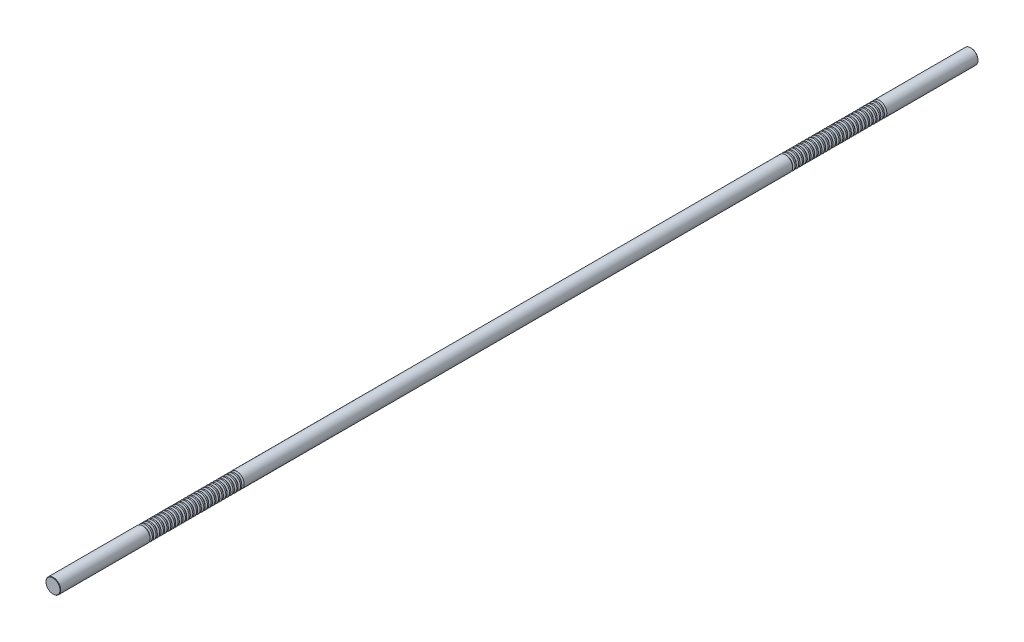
ISO-10303-21;
HEADER;
FILE_DESCRIPTION(('STEP AP214'),'2;1');
FILE_NAME('part.step','',(''),(''),'','','');
FILE_SCHEMA(('AUTOMOTIVE_DESIGN { 1 0 10303 214 1 1 1 1 }'));
ENDSEC;
DATA;
#1=APPLICATION_CONTEXT('core data for automotive mechanical design processes');
#2=APPLICATION_PROTOCOL_DEFINITION('international standard','automotive_design',2000,#1);
#3=PRODUCT_CONTEXT('',#1,'mechanical');
#4=PRODUCT('Part','Part','',(#3));
#5=PRODUCT_RELATED_PRODUCT_CATEGORY('part','',(#4));
#6=PRODUCT_DEFINITION_FORMATION('','',#4);
#7=PRODUCT_DEFINITION_CONTEXT('part definition',#1,'design');
#8=PRODUCT_DEFINITION('design','',#6,#7);
#9=PRODUCT_DEFINITION_SHAPE('','',#8);
#10=(LENGTH_UNIT() NAMED_UNIT(*) SI_UNIT(.MILLI.,.METRE.));
#11=(NAMED_UNIT(*) PLANE_ANGLE_UNIT() SI_UNIT($,.RADIAN.));
#12=(NAMED_UNIT(*) SI_UNIT($,.STERADIAN.) SOLID_ANGLE_UNIT());
#13=UNCERTAINTY_MEASURE_WITH_UNIT(LENGTH_MEASURE(1.E-05),#10,'distance_accuracy_value','');
#14=(GEOMETRIC_REPRESENTATION_CONTEXT(3) GLOBAL_UNCERTAINTY_ASSIGNED_CONTEXT((#13)) GLOBAL_UNIT_ASSIGNED_CONTEXT((#10,
#11,#12)) REPRESENTATION_CONTEXT('',''));
#15=CARTESIAN_POINT('',(0.,0.,0.));
#16=DIRECTION('',(0.,0.,1.));
#17=DIRECTION('',(1.,0.,0.));
#18=AXIS2_PLACEMENT_3D('',#15,#16,#17);
#19=CARTESIAN_POINT('',(0.,0.,500.));
#20=DIRECTION('',(0.,0.,-1.));
#21=DIRECTION('',(-1.,0.,0.));
#22=AXIS2_PLACEMENT_3D('',#19,#20,#21);
#23=CYLINDRICAL_SURFACE('',#22,8.);
#24=CARTESIAN_POINT('',(0.,0.,398.301442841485));
#25=DIRECTION('',(0.,0.,1.));
#26=DIRECTION('',(1.,0.,0.));
#27=AXIS2_PLACEMENT_3D('',#24,#25,#26);
#28=CIRCLE('',#27,8.);
#29=CARTESIAN_POINT('',(8.,0.,398.301442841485));
#30=VERTEX_POINT('',#29);
#31=EDGE_CURVE('E865',#30,#30,#28,.T.);
#32=ORIENTED_EDGE('',*,*,#31,.T.);
#33=EDGE_LOOP('',(#32));
#34=FACE_BOUND('',#33,.T.);
#35=CARTESIAN_POINT('',(0.,0.,399.698557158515));
#36=DIRECTION('',(0.,0.,1.));
#37=DIRECTION('',(1.,0.,0.));
#38=AXIS2_PLACEMENT_3D('',#35,#36,#37);
#39=CIRCLE('',#38,8.);
#40=CARTESIAN_POINT('',(8.,0.,399.698557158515));
#41=VERTEX_POINT('',#40);
#42=EDGE_CURVE('E877',#41,#41,#39,.T.);
#43=ORIENTED_EDGE('',*,*,#42,.F.);
#44=EDGE_LOOP('',(#43));
#45=FACE_BOUND('',#44,.T.);
#46=ADVANCED_FACE('F37',(#34,#45),#23,.T.);
#47=CARTESIAN_POINT('',(0.,0.,394.301442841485));
#48=DIRECTION('',(0.,0.,1.));
#49=DIRECTION('',(1.,0.,0.));
#50=AXIS2_PLACEMENT_3D('',#47,#48,#49);
#51=CIRCLE('',#50,8.);
#52=CARTESIAN_POINT('',(8.,0.,394.301442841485));
#53=VERTEX_POINT('',#52);
#54=EDGE_CURVE('E850',#53,#53,#51,.T.);
#55=ORIENTED_EDGE('',*,*,#54,.T.);
#56=EDGE_LOOP('',(#55));
#57=FACE_BOUND('',#56,.T.);
#58=CARTESIAN_POINT('',(0.,0.,395.698557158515));
#59=DIRECTION('',(0.,0.,1.));
#60=DIRECTION('',(1.,0.,0.));
#61=AXIS2_PLACEMENT_3D('',#58,#59,#60);
#62=CIRCLE('',#61,8.);
#63=CARTESIAN_POINT('',(8.,0.,395.698557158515));
#64=VERTEX_POINT('',#63);
#65=EDGE_CURVE('E861',#64,#64,#62,.T.);
#66=ORIENTED_EDGE('',*,*,#65,.F.);
#67=EDGE_LOOP('',(#66));
#68=FACE_BOUND('',#67,.T.);
#69=ADVANCED_FACE('F913',(#57,#68),#23,.T.);
#70=CARTESIAN_POINT('',(0.,0.,390.301442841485));
#71=DIRECTION('',(0.,0.,1.));
#72=DIRECTION('',(1.,0.,0.));
#73=AXIS2_PLACEMENT_3D('',#70,#71,#72);
#74=CIRCLE('',#73,8.);
#75=CARTESIAN_POINT('',(8.,0.,390.301442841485));
#76=VERTEX_POINT('',#75);
#77=EDGE_CURVE('E834',#76,#76,#74,.T.);
#78=ORIENTED_EDGE('',*,*,#77,.T.);
#79=EDGE_LOOP('',(#78));
#80=FACE_BOUND('',#79,.T.);
#81=CARTESIAN_POINT('',(0.,0.,391.698557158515));
#82=DIRECTION('',(0.,0.,1.));
#83=DIRECTION('',(1.,0.,0.));
#84=AXIS2_PLACEMENT_3D('',#81,#82,#83);
#85=CIRCLE('',#84,8.);
#86=CARTESIAN_POINT('',(8.,0.,391.698557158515));
#87=VERTEX_POINT('',#86);
#88=EDGE_CURVE('E846',#87,#87,#85,.T.);
#89=ORIENTED_EDGE('',*,*,#88,.F.);
#90=EDGE_LOOP('',(#89));
#91=FACE_BOUND('',#90,.T.);
#92=ADVANCED_FACE('F921',(#80,#91),#23,.T.);
#93=CARTESIAN_POINT('',(0.,0.,386.301442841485));
#94=DIRECTION('',(0.,0.,1.));
#95=DIRECTION('',(1.,0.,0.));
#96=AXIS2_PLACEMENT_3D('',#93,#94,#95);
#97=CIRCLE('',#96,8.);
#98=CARTESIAN_POINT('',(8.,0.,386.301442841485));
#99=VERTEX_POINT('',#98);
#100=EDGE_CURVE('E818',#99,#99,#97,.T.);
#101=ORIENTED_EDGE('',*,*,#100,.T.);
#102=EDGE_LOOP('',(#101));
#103=FACE_BOUND('',#102,.T.);
#104=CARTESIAN_POINT('',(0.,0.,387.698557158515));
#105=DIRECTION('',(0.,0.,1.));
#106=DIRECTION('',(1.,0.,0.));
#107=AXIS2_PLACEMENT_3D('',#104,#105,#106);
#108=CIRCLE('',#107,8.);
#109=CARTESIAN_POINT('',(8.,0.,387.698557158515));
#110=VERTEX_POINT('',#109);
#111=EDGE_CURVE('E830',#110,#110,#108,.T.);
#112=ORIENTED_EDGE('',*,*,#111,.F.);
#113=EDGE_LOOP('',(#112));
#114=FACE_BOUND('',#113,.T.);
#115=ADVANCED_FACE('F2018',(#103,#114),#23,.T.);
#116=CARTESIAN_POINT('',(0.,0.,382.301442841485));
#117=DIRECTION('',(0.,0.,1.));
#118=DIRECTION('',(1.,0.,0.));
#119=AXIS2_PLACEMENT_3D('',#116,#117,#118);
#120=CIRCLE('',#119,8.);
#121=CARTESIAN_POINT('',(8.,0.,382.301442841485));
#122=VERTEX_POINT('',#121);
#123=EDGE_CURVE('E803',#122,#122,#120,.T.);
#124=ORIENTED_EDGE('',*,*,#123,.T.);
#125=EDGE_LOOP('',(#124));
#126=FACE_BOUND('',#125,.T.);
#127=CARTESIAN_POINT('',(0.,0.,383.698557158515));
#128=DIRECTION('',(0.,0.,1.));
#129=DIRECTION('',(1.,0.,0.));
#130=AXIS2_PLACEMENT_3D('',#127,#128,#129);
#131=CIRCLE('',#130,8.);
#132=CARTESIAN_POINT('',(8.,0.,383.698557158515));
#133=VERTEX_POINT('',#132);
#134=EDGE_CURVE('E814',#133,#133,#131,.T.);
#135=ORIENTED_EDGE('',*,*,#134,.F.);
#136=EDGE_LOOP('',(#135));
#137=FACE_BOUND('',#136,.T.);
#138=ADVANCED_FACE('F1995',(#126,#137),#23,.T.);
#139=CARTESIAN_POINT('',(0.,0.,378.301442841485));
#140=DIRECTION('',(0.,0.,1.));
#141=DIRECTION('',(1.,0.,0.));
#142=AXIS2_PLACEMENT_3D('',#139,#140,#141);
#143=CIRCLE('',#142,8.);
#144=CARTESIAN_POINT('',(8.,0.,378.301442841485));
#145=VERTEX_POINT('',#144);
#146=EDGE_CURVE('E787',#145,#145,#143,.T.);
#147=ORIENTED_EDGE('',*,*,#146,.T.);
#148=EDGE_LOOP('',(#147));
#149=FACE_BOUND('',#148,.T.);
#150=CARTESIAN_POINT('',(0.,0.,379.698557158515));
#151=DIRECTION('',(0.,0.,1.));
#152=DIRECTION('',(1.,0.,0.));
#153=AXIS2_PLACEMENT_3D('',#150,#151,#152);
#154=CIRCLE('',#153,8.);
#155=CARTESIAN_POINT('',(8.,0.,379.698557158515));
#156=VERTEX_POINT('',#155);
#157=EDGE_CURVE('E799',#156,#156,#154,.T.);
#158=ORIENTED_EDGE('',*,*,#157,.F.);
#159=EDGE_LOOP('',(#158));
#160=FACE_BOUND('',#159,.T.);
#161=ADVANCED_FACE('F1972',(#149,#160),#23,.T.);
#162=CARTESIAN_POINT('',(0.,0.,374.301442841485));
#163=DIRECTION('',(0.,0.,1.));
#164=DIRECTION('',(1.,0.,0.));
#165=AXIS2_PLACEMENT_3D('',#162,#163,#164);
#166=CIRCLE('',#165,8.);
#167=CARTESIAN_POINT('',(8.,0.,374.301442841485));
#168=VERTEX_POINT('',#167);
#169=EDGE_CURVE('E771',#168,#168,#166,.T.);
#170=ORIENTED_EDGE('',*,*,#169,.T.);
#171=EDGE_LOOP('',(#170));
#172=FACE_BOUND('',#171,.T.);
#173=CARTESIAN_POINT('',(0.,0.,375.698557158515));
#174=DIRECTION('',(0.,0.,1.));
#175=DIRECTION('',(1.,0.,0.));
#176=AXIS2_PLACEMENT_3D('',#173,#174,#175);
#177=CIRCLE('',#176,8.);
#178=CARTESIAN_POINT('',(8.,0.,375.698557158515));
#179=VERTEX_POINT('',#178);
#180=EDGE_CURVE('E783',#179,#179,#177,.T.);
#181=ORIENTED_EDGE('',*,*,#180,.F.);
#182=EDGE_LOOP('',(#181));
#183=FACE_BOUND('',#182,.T.);
#184=ADVANCED_FACE('F1949',(#172,#183),#23,.T.);
#185=CARTESIAN_POINT('',(0.,0.,370.301442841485));
#186=DIRECTION('',(0.,0.,1.));
#187=DIRECTION('',(1.,0.,0.));
#188=AXIS2_PLACEMENT_3D('',#185,#186,#187);
#189=CIRCLE('',#188,8.);
#190=CARTESIAN_POINT('',(8.,0.,370.301442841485));
#191=VERTEX_POINT('',#190);
#192=EDGE_CURVE('E755',#191,#191,#189,.T.);
#193=ORIENTED_EDGE('',*,*,#192,.T.);
#194=EDGE_LOOP('',(#193));
#195=FACE_BOUND('',#194,.T.);
#196=CARTESIAN_POINT('',(0.,0.,371.698557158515));
#197=DIRECTION('',(0.,0.,1.));
#198=DIRECTION('',(1.,0.,0.));
#199=AXIS2_PLACEMENT_3D('',#196,#197,#198);
#200=CIRCLE('',#199,8.);
#201=CARTESIAN_POINT('',(8.,0.,371.698557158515));
#202=VERTEX_POINT('',#201);
#203=EDGE_CURVE('E767',#202,#202,#200,.T.);
#204=ORIENTED_EDGE('',*,*,#203,.F.);
#205=EDGE_LOOP('',(#204));
#206=FACE_BOUND('',#205,.T.);
#207=ADVANCED_FACE('F1926',(#195,#206),#23,.T.);
#208=CARTESIAN_POINT('',(0.,0.,366.301442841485));
#209=DIRECTION('',(0.,0.,1.));
#210=DIRECTION('',(1.,0.,0.));
#211=AXIS2_PLACEMENT_3D('',#208,#209,#210);
#212=CIRCLE('',#211,8.);
#213=CARTESIAN_POINT('',(8.,0.,366.301442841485));
#214=VERTEX_POINT('',#213);
#215=EDGE_CURVE('E739',#214,#214,#212,.T.);
#216=ORIENTED_EDGE('',*,*,#215,.T.);
#217=EDGE_LOOP('',(#216));
#218=FACE_BOUND('',#217,.T.);
#219=CARTESIAN_POINT('',(0.,0.,367.698557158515));
#220=DIRECTION('',(0.,0.,1.));
#221=DIRECTION('',(1.,0.,0.));
#222=AXIS2_PLACEMENT_3D('',#219,#220,#221);
#223=CIRCLE('',#222,8.);
#224=CARTESIAN_POINT('',(8.,0.,367.698557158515));
#225=VERTEX_POINT('',#224);
#226=EDGE_CURVE('E751',#225,#225,#223,.T.);
#227=ORIENTED_EDGE('',*,*,#226,.F.);
#228=EDGE_LOOP('',(#227));
#229=FACE_BOUND('',#228,.T.);
#230=ADVANCED_FACE('F1903',(#218,#229),#23,.T.);
#231=CARTESIAN_POINT('',(0.,0.,362.301442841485));
#232=DIRECTION('',(0.,0.,1.));
#233=DIRECTION('',(1.,0.,0.));
#234=AXIS2_PLACEMENT_3D('',#231,#232,#233);
#235=CIRCLE('',#234,8.);
#236=CARTESIAN_POINT('',(8.,0.,362.301442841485));
#237=VERTEX_POINT('',#236);
#238=EDGE_CURVE('E723',#237,#237,#235,.T.);
#239=ORIENTED_EDGE('',*,*,#238,.T.);
#240=EDGE_LOOP('',(#239));
#241=FACE_BOUND('',#240,.T.);
#242=CARTESIAN_POINT('',(0.,0.,363.698557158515));
#243=DIRECTION('',(0.,0.,1.));
#244=DIRECTION('',(1.,0.,0.));
#245=AXIS2_PLACEMENT_3D('',#242,#243,#244);
#246=CIRCLE('',#245,8.);
#247=CARTESIAN_POINT('',(8.,0.,363.698557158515));
#248=VERTEX_POINT('',#247);
#249=EDGE_CURVE('E735',#248,#248,#246,.T.);
#250=ORIENTED_EDGE('',*,*,#249,.F.);
#251=EDGE_LOOP('',(#250));
#252=FACE_BOUND('',#251,.T.);
#253=ADVANCED_FACE('F1880',(#241,#252),#23,.T.);
#254=CARTESIAN_POINT('',(0.,0.,358.301442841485));
#255=DIRECTION('',(0.,0.,1.));
#256=DIRECTION('',(1.,0.,0.));
#257=AXIS2_PLACEMENT_3D('',#254,#255,#256);
#258=CIRCLE('',#257,8.);
#259=CARTESIAN_POINT('',(8.,0.,358.301442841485));
#260=VERTEX_POINT('',#259);
#261=EDGE_CURVE('E707',#260,#260,#258,.T.);
#262=ORIENTED_EDGE('',*,*,#261,.T.);
#263=EDGE_LOOP('',(#262));
#264=FACE_BOUND('',#263,.T.);
#265=CARTESIAN_POINT('',(0.,0.,359.698557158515));
#266=DIRECTION('',(0.,0.,1.));
#267=DIRECTION('',(1.,0.,0.));
#268=AXIS2_PLACEMENT_3D('',#265,#266,#267);
#269=CIRCLE('',#268,8.);
#270=CARTESIAN_POINT('',(8.,0.,359.698557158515));
#271=VERTEX_POINT('',#270);
#272=EDGE_CURVE('E719',#271,#271,#269,.T.);
#273=ORIENTED_EDGE('',*,*,#272,.F.);
#274=EDGE_LOOP('',(#273));
#275=FACE_BOUND('',#274,.T.);
#276=ADVANCED_FACE('F1857',(#264,#275),#23,.T.);
#277=CARTESIAN_POINT('',(0.,0.,354.301442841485));
#278=DIRECTION('',(0.,0.,1.));
#279=DIRECTION('',(1.,0.,0.));
#280=AXIS2_PLACEMENT_3D('',#277,#278,#279);
#281=CIRCLE('',#280,8.);
#282=CARTESIAN_POINT('',(8.,0.,354.301442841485));
#283=VERTEX_POINT('',#282);
#284=EDGE_CURVE('E691',#283,#283,#281,.T.);
#285=ORIENTED_EDGE('',*,*,#284,.T.);
#286=EDGE_LOOP('',(#285));
#287=FACE_BOUND('',#286,.T.);
#288=CARTESIAN_POINT('',(0.,0.,355.698557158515));
#289=DIRECTION('',(0.,0.,1.));
#290=DIRECTION('',(1.,0.,0.));
#291=AXIS2_PLACEMENT_3D('',#288,#289,#290);
#292=CIRCLE('',#291,8.);
#293=CARTESIAN_POINT('',(8.,0.,355.698557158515));
#294=VERTEX_POINT('',#293);
#295=EDGE_CURVE('E703',#294,#294,#292,.T.);
#296=ORIENTED_EDGE('',*,*,#295,.F.);
#297=EDGE_LOOP('',(#296));
#298=FACE_BOUND('',#297,.T.);
#299=ADVANCED_FACE('F1834',(#287,#298),#23,.T.);
#300=CARTESIAN_POINT('',(0.,0.,350.301442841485));
#301=DIRECTION('',(0.,0.,1.));
#302=DIRECTION('',(1.,0.,0.));
#303=AXIS2_PLACEMENT_3D('',#300,#301,#302);
#304=CIRCLE('',#303,8.);
#305=CARTESIAN_POINT('',(8.,0.,350.301442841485));
#306=VERTEX_POINT('',#305);
#307=EDGE_CURVE('E675',#306,#306,#304,.T.);
#308=ORIENTED_EDGE('',*,*,#307,.T.);
#309=EDGE_LOOP('',(#308));
#310=FACE_BOUND('',#309,.T.);
#311=CARTESIAN_POINT('',(0.,0.,351.698557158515));
#312=DIRECTION('',(0.,0.,1.));
#313=DIRECTION('',(1.,0.,0.));
#314=AXIS2_PLACEMENT_3D('',#311,#312,#313);
#315=CIRCLE('',#314,8.);
#316=CARTESIAN_POINT('',(8.,0.,351.698557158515));
#317=VERTEX_POINT('',#316);
#318=EDGE_CURVE('E687',#317,#317,#315,.T.);
#319=ORIENTED_EDGE('',*,*,#318,.F.);
#320=EDGE_LOOP('',(#319));
#321=FACE_BOUND('',#320,.T.);
#322=ADVANCED_FACE('F1811',(#310,#321),#23,.T.);
#323=CARTESIAN_POINT('',(0.,0.,346.301442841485));
#324=DIRECTION('',(0.,0.,1.));
#325=DIRECTION('',(1.,0.,0.));
#326=AXIS2_PLACEMENT_3D('',#323,#324,#325);
#327=CIRCLE('',#326,8.);
#328=CARTESIAN_POINT('',(8.,0.,346.301442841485));
#329=VERTEX_POINT('',#328);
#330=EDGE_CURVE('E659',#329,#329,#327,.T.);
#331=ORIENTED_EDGE('',*,*,#330,.T.);
#332=EDGE_LOOP('',(#331));
#333=FACE_BOUND('',#332,.T.);
#334=CARTESIAN_POINT('',(0.,0.,347.698557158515));
#335=DIRECTION('',(0.,0.,1.));
#336=DIRECTION('',(1.,0.,0.));
#337=AXIS2_PLACEMENT_3D('',#334,#335,#336);
#338=CIRCLE('',#337,8.);
#339=CARTESIAN_POINT('',(8.,0.,347.698557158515));
#340=VERTEX_POINT('',#339);
#341=EDGE_CURVE('E671',#340,#340,#338,.T.);
#342=ORIENTED_EDGE('',*,*,#341,.F.);
#343=EDGE_LOOP('',(#342));
#344=FACE_BOUND('',#343,.T.);
#345=ADVANCED_FACE('F1788',(#333,#344),#23,.T.);
#346=CARTESIAN_POINT('',(0.,0.,342.301442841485));
#347=DIRECTION('',(0.,0.,1.));
#348=DIRECTION('',(1.,0.,0.));
#349=AXIS2_PLACEMENT_3D('',#346,#347,#348);
#350=CIRCLE('',#349,8.);
#351=CARTESIAN_POINT('',(8.,0.,342.301442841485));
#352=VERTEX_POINT('',#351);
#353=EDGE_CURVE('E643',#352,#352,#350,.T.);
#354=ORIENTED_EDGE('',*,*,#353,.T.);
#355=EDGE_LOOP('',(#354));
#356=FACE_BOUND('',#355,.T.);
#357=CARTESIAN_POINT('',(0.,0.,343.698557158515));
#358=DIRECTION('',(0.,0.,1.));
#359=DIRECTION('',(1.,0.,0.));
#360=AXIS2_PLACEMENT_3D('',#357,#358,#359);
#361=CIRCLE('',#360,8.);
#362=CARTESIAN_POINT('',(8.,0.,343.698557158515));
#363=VERTEX_POINT('',#362);
#364=EDGE_CURVE('E655',#363,#363,#361,.T.);
#365=ORIENTED_EDGE('',*,*,#364,.F.);
#366=EDGE_LOOP('',(#365));
#367=FACE_BOUND('',#366,.T.);
#368=ADVANCED_FACE('F1765',(#356,#367),#23,.T.);
#369=CARTESIAN_POINT('',(0.,0.,338.301442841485));
#370=DIRECTION('',(0.,0.,1.));
#371=DIRECTION('',(1.,0.,0.));
#372=AXIS2_PLACEMENT_3D('',#369,#370,#371);
#373=CIRCLE('',#372,8.);
#374=CARTESIAN_POINT('',(8.,0.,338.301442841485));
#375=VERTEX_POINT('',#374);
#376=EDGE_CURVE('E627',#375,#375,#373,.T.);
#377=ORIENTED_EDGE('',*,*,#376,.T.);
#378=EDGE_LOOP('',(#377));
#379=FACE_BOUND('',#378,.T.);
#380=CARTESIAN_POINT('',(0.,0.,339.698557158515));
#381=DIRECTION('',(0.,0.,1.));
#382=DIRECTION('',(1.,0.,0.));
#383=AXIS2_PLACEMENT_3D('',#380,#381,#382);
#384=CIRCLE('',#383,8.);
#385=CARTESIAN_POINT('',(8.,0.,339.698557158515));
#386=VERTEX_POINT('',#385);
#387=EDGE_CURVE('E639',#386,#386,#384,.T.);
#388=ORIENTED_EDGE('',*,*,#387,.F.);
#389=EDGE_LOOP('',(#388));
#390=FACE_BOUND('',#389,.T.);
#391=ADVANCED_FACE('F1742',(#379,#390),#23,.T.);
#392=CARTESIAN_POINT('',(0.,0.,334.301442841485));
#393=DIRECTION('',(0.,0.,1.));
#394=DIRECTION('',(1.,0.,0.));
#395=AXIS2_PLACEMENT_3D('',#392,#393,#394);
#396=CIRCLE('',#395,8.);
#397=CARTESIAN_POINT('',(8.,0.,334.301442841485));
#398=VERTEX_POINT('',#397);
#399=EDGE_CURVE('E611',#398,#398,#396,.T.);
#400=ORIENTED_EDGE('',*,*,#399,.T.);
#401=EDGE_LOOP('',(#400));
#402=FACE_BOUND('',#401,.T.);
#403=CARTESIAN_POINT('',(0.,0.,335.698557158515));
#404=DIRECTION('',(0.,0.,1.));
#405=DIRECTION('',(1.,0.,0.));
#406=AXIS2_PLACEMENT_3D('',#403,#404,#405);
#407=CIRCLE('',#406,8.);
#408=CARTESIAN_POINT('',(8.,0.,335.698557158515));
#409=VERTEX_POINT('',#408);
#410=EDGE_CURVE('E623',#409,#409,#407,.T.);
#411=ORIENTED_EDGE('',*,*,#410,.F.);
#412=EDGE_LOOP('',(#411));
#413=FACE_BOUND('',#412,.T.);
#414=ADVANCED_FACE('F1719',(#402,#413),#23,.T.);
#415=CARTESIAN_POINT('',(0.,0.,330.301442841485));
#416=DIRECTION('',(0.,0.,1.));
#417=DIRECTION('',(1.,0.,0.));
#418=AXIS2_PLACEMENT_3D('',#415,#416,#417);
#419=CIRCLE('',#418,8.);
#420=CARTESIAN_POINT('',(8.,0.,330.301442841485));
#421=VERTEX_POINT('',#420);
#422=EDGE_CURVE('E595',#421,#421,#419,.T.);
#423=ORIENTED_EDGE('',*,*,#422,.T.);
#424=EDGE_LOOP('',(#423));
#425=FACE_BOUND('',#424,.T.);
#426=CARTESIAN_POINT('',(0.,0.,331.698557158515));
#427=DIRECTION('',(0.,0.,1.));
#428=DIRECTION('',(1.,0.,0.));
#429=AXIS2_PLACEMENT_3D('',#426,#427,#428);
#430=CIRCLE('',#429,8.);
#431=CARTESIAN_POINT('',(8.,0.,331.698557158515));
#432=VERTEX_POINT('',#431);
#433=EDGE_CURVE('E607',#432,#432,#430,.T.);
#434=ORIENTED_EDGE('',*,*,#433,.F.);
#435=EDGE_LOOP('',(#434));
#436=FACE_BOUND('',#435,.T.);
#437=ADVANCED_FACE('F1696',(#425,#436),#23,.T.);
#438=CARTESIAN_POINT('',(0.,0.,326.301442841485));
#439=DIRECTION('',(0.,0.,1.));
#440=DIRECTION('',(1.,0.,0.));
#441=AXIS2_PLACEMENT_3D('',#438,#439,#440);
#442=CIRCLE('',#441,8.);
#443=CARTESIAN_POINT('',(8.,0.,326.301442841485));
#444=VERTEX_POINT('',#443);
#445=EDGE_CURVE('E579',#444,#444,#442,.T.);
#446=ORIENTED_EDGE('',*,*,#445,.T.);
#447=EDGE_LOOP('',(#446));
#448=FACE_BOUND('',#447,.T.);
#449=CARTESIAN_POINT('',(0.,0.,327.698557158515));
#450=DIRECTION('',(0.,0.,1.));
#451=DIRECTION('',(1.,0.,0.));
#452=AXIS2_PLACEMENT_3D('',#449,#450,#451);
#453=CIRCLE('',#452,8.);
#454=CARTESIAN_POINT('',(8.,0.,327.698557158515));
#455=VERTEX_POINT('',#454);
#456=EDGE_CURVE('E591',#455,#455,#453,.T.);
#457=ORIENTED_EDGE('',*,*,#456,.F.);
#458=EDGE_LOOP('',(#457));
#459=FACE_BOUND('',#458,.T.);
#460=ADVANCED_FACE('F1673',(#448,#459),#23,.T.);
#461=CARTESIAN_POINT('',(0.,0.,322.301442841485));
#462=DIRECTION('',(0.,0.,1.));
#463=DIRECTION('',(1.,0.,0.));
#464=AXIS2_PLACEMENT_3D('',#461,#462,#463);
#465=CIRCLE('',#464,8.);
#466=CARTESIAN_POINT('',(8.,0.,322.301442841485));
#467=VERTEX_POINT('',#466);
#468=EDGE_CURVE('E563',#467,#467,#465,.T.);
#469=ORIENTED_EDGE('',*,*,#468,.T.);
#470=EDGE_LOOP('',(#469));
#471=FACE_BOUND('',#470,.T.);
#472=CARTESIAN_POINT('',(0.,0.,323.698557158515));
#473=DIRECTION('',(0.,0.,1.));
#474=DIRECTION('',(1.,0.,0.));
#475=AXIS2_PLACEMENT_3D('',#472,#473,#474);
#476=CIRCLE('',#475,8.);
#477=CARTESIAN_POINT('',(8.,0.,323.698557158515));
#478=VERTEX_POINT('',#477);
#479=EDGE_CURVE('E575',#478,#478,#476,.T.);
#480=ORIENTED_EDGE('',*,*,#479,.F.);
#481=EDGE_LOOP('',(#480));
#482=FACE_BOUND('',#481,.T.);
#483=ADVANCED_FACE('F1650',(#471,#482),#23,.T.);
#484=CARTESIAN_POINT('',(0.,0.,318.301442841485));
#485=DIRECTION('',(0.,0.,1.));
#486=DIRECTION('',(1.,0.,0.));
#487=AXIS2_PLACEMENT_3D('',#484,#485,#486);
#488=CIRCLE('',#487,8.);
#489=CARTESIAN_POINT('',(8.,0.,318.301442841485));
#490=VERTEX_POINT('',#489);
#491=EDGE_CURVE('E547',#490,#490,#488,.T.);
#492=ORIENTED_EDGE('',*,*,#491,.T.);
#493=EDGE_LOOP('',(#492));
#494=FACE_BOUND('',#493,.T.);
#495=CARTESIAN_POINT('',(0.,0.,319.698557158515));
#496=DIRECTION('',(0.,0.,1.));
#497=DIRECTION('',(1.,0.,0.));
#498=AXIS2_PLACEMENT_3D('',#495,#496,#497);
#499=CIRCLE('',#498,8.);
#500=CARTESIAN_POINT('',(8.,0.,319.698557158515));
#501=VERTEX_POINT('',#500);
#502=EDGE_CURVE('E559',#501,#501,#499,.T.);
#503=ORIENTED_EDGE('',*,*,#502,.F.);
#504=EDGE_LOOP('',(#503));
#505=FACE_BOUND('',#504,.T.);
#506=ADVANCED_FACE('F1627',(#494,#505),#23,.T.);
#507=CARTESIAN_POINT('',(0.,0.,314.301442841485));
#508=DIRECTION('',(0.,0.,1.));
#509=DIRECTION('',(1.,0.,0.));
#510=AXIS2_PLACEMENT_3D('',#507,#508,#509);
#511=CIRCLE('',#510,8.);
#512=CARTESIAN_POINT('',(8.,0.,314.301442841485));
#513=VERTEX_POINT('',#512);
#514=EDGE_CURVE('E531',#513,#513,#511,.T.);
#515=ORIENTED_EDGE('',*,*,#514,.T.);
#516=EDGE_LOOP('',(#515));
#517=FACE_BOUND('',#516,.T.);
#518=CARTESIAN_POINT('',(0.,0.,315.698557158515));
#519=DIRECTION('',(0.,0.,1.));
#520=DIRECTION('',(1.,0.,0.));
#521=AXIS2_PLACEMENT_3D('',#518,#519,#520);
#522=CIRCLE('',#521,8.);
#523=CARTESIAN_POINT('',(8.,0.,315.698557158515));
#524=VERTEX_POINT('',#523);
#525=EDGE_CURVE('E543',#524,#524,#522,.T.);
#526=ORIENTED_EDGE('',*,*,#525,.F.);
#527=EDGE_LOOP('',(#526));
#528=FACE_BOUND('',#527,.T.);
#529=ADVANCED_FACE('F1604',(#517,#528),#23,.T.);
#530=CARTESIAN_POINT('',(0.,0.,310.301442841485));
#531=DIRECTION('',(0.,0.,1.));
#532=DIRECTION('',(1.,0.,0.));
#533=AXIS2_PLACEMENT_3D('',#530,#531,#532);
#534=CIRCLE('',#533,8.);
#535=CARTESIAN_POINT('',(8.,0.,310.301442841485));
#536=VERTEX_POINT('',#535);
#537=EDGE_CURVE('E515',#536,#536,#534,.T.);
#538=ORIENTED_EDGE('',*,*,#537,.T.);
#539=EDGE_LOOP('',(#538));
#540=FACE_BOUND('',#539,.T.);
#541=CARTESIAN_POINT('',(0.,0.,311.698557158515));
#542=DIRECTION('',(0.,0.,1.));
#543=DIRECTION('',(1.,0.,0.));
#544=AXIS2_PLACEMENT_3D('',#541,#542,#543);
#545=CIRCLE('',#544,8.);
#546=CARTESIAN_POINT('',(8.,0.,311.698557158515));
#547=VERTEX_POINT('',#546);
#548=EDGE_CURVE('E527',#547,#547,#545,.T.);
#549=ORIENTED_EDGE('',*,*,#548,.F.);
#550=EDGE_LOOP('',(#549));
#551=FACE_BOUND('',#550,.T.);
#552=ADVANCED_FACE('F1581',(#540,#551),#23,.T.);
#553=CARTESIAN_POINT('',(0.,0.,306.301442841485));
#554=DIRECTION('',(0.,0.,1.));
#555=DIRECTION('',(1.,0.,0.));
#556=AXIS2_PLACEMENT_3D('',#553,#554,#555);
#557=CIRCLE('',#556,8.);
#558=CARTESIAN_POINT('',(8.,0.,306.301442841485));
#559=VERTEX_POINT('',#558);
#560=EDGE_CURVE('E499',#559,#559,#557,.T.);
#561=ORIENTED_EDGE('',*,*,#560,.T.);
#562=EDGE_LOOP('',(#561));
#563=FACE_BOUND('',#562,.T.);
#564=CARTESIAN_POINT('',(0.,0.,307.698557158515));
#565=DIRECTION('',(0.,0.,1.));
#566=DIRECTION('',(1.,0.,0.));
#567=AXIS2_PLACEMENT_3D('',#564,#565,#566);
#568=CIRCLE('',#567,8.);
#569=CARTESIAN_POINT('',(8.,0.,307.698557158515));
#570=VERTEX_POINT('',#569);
#571=EDGE_CURVE('E511',#570,#570,#568,.T.);
#572=ORIENTED_EDGE('',*,*,#571,.F.);
#573=EDGE_LOOP('',(#572));
#574=FACE_BOUND('',#573,.T.);
#575=ADVANCED_FACE('F1558',(#563,#574),#23,.T.);
#576=CARTESIAN_POINT('',(0.,0.,302.301442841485));
#577=DIRECTION('',(0.,0.,1.));
#578=DIRECTION('',(1.,0.,0.));
#579=AXIS2_PLACEMENT_3D('',#576,#577,#578);
#580=CIRCLE('',#579,8.);
#581=CARTESIAN_POINT('',(8.,0.,302.301442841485));
#582=VERTEX_POINT('',#581);
#583=EDGE_CURVE('E483',#582,#582,#580,.T.);
#584=ORIENTED_EDGE('',*,*,#583,.T.);
#585=EDGE_LOOP('',(#584));
#586=FACE_BOUND('',#585,.T.);
#587=CARTESIAN_POINT('',(0.,0.,303.698557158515));
#588=DIRECTION('',(0.,0.,1.));
#589=DIRECTION('',(1.,0.,0.));
#590=AXIS2_PLACEMENT_3D('',#587,#588,#589);
#591=CIRCLE('',#590,8.);
#592=CARTESIAN_POINT('',(8.,0.,303.698557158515));
#593=VERTEX_POINT('',#592);
#594=EDGE_CURVE('E495',#593,#593,#591,.T.);
#595=ORIENTED_EDGE('',*,*,#594,.F.);
#596=EDGE_LOOP('',(#595));
#597=FACE_BOUND('',#596,.T.);
#598=ADVANCED_FACE('F1535',(#586,#597),#23,.T.);
#599=CARTESIAN_POINT('',(0.,0.,-297.698557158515));
#600=DIRECTION('',(0.,0.,1.));
#601=DIRECTION('',(1.,0.,0.));
#602=AXIS2_PLACEMENT_3D('',#599,#600,#601);
#603=CIRCLE('',#602,8.);
#604=CARTESIAN_POINT('',(8.,0.,-297.698557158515));
#605=VERTEX_POINT('',#604);
#606=EDGE_CURVE('E467',#605,#605,#603,.T.);
#607=ORIENTED_EDGE('',*,*,#606,.T.);
#608=EDGE_LOOP('',(#607));
#609=FACE_BOUND('',#608,.T.);
#610=CARTESIAN_POINT('',(0.,0.,299.698557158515));
#611=DIRECTION('',(0.,0.,1.));
#612=DIRECTION('',(1.,0.,0.));
#613=AXIS2_PLACEMENT_3D('',#610,#611,#612);
#614=CIRCLE('',#613,8.);
#615=CARTESIAN_POINT('',(8.,0.,299.698557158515));
#616=VERTEX_POINT('',#615);
#617=EDGE_CURVE('E479',#616,#616,#614,.T.);
#618=ORIENTED_EDGE('',*,*,#617,.F.);
#619=EDGE_LOOP('',(#618));
#620=FACE_BOUND('',#619,.T.);
#621=ADVANCED_FACE('F1512',(#609,#620),#23,.T.);
#622=CARTESIAN_POINT('',(0.,0.,-301.698557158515));
#623=DIRECTION('',(0.,0.,1.));
#624=DIRECTION('',(1.,0.,0.));
#625=AXIS2_PLACEMENT_3D('',#622,#623,#624);
#626=CIRCLE('',#625,8.);
#627=CARTESIAN_POINT('',(8.,0.,-301.698557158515));
#628=VERTEX_POINT('',#627);
#629=EDGE_CURVE('E451',#628,#628,#626,.T.);
#630=ORIENTED_EDGE('',*,*,#629,.T.);
#631=EDGE_LOOP('',(#630));
#632=FACE_BOUND('',#631,.T.);
#633=CARTESIAN_POINT('',(0.,0.,-300.301442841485));
#634=DIRECTION('',(0.,0.,1.));
#635=DIRECTION('',(1.,0.,0.));
#636=AXIS2_PLACEMENT_3D('',#633,#634,#635);
#637=CIRCLE('',#636,8.);
#638=CARTESIAN_POINT('',(8.,0.,-300.301442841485));
#639=VERTEX_POINT('',#638);
#640=EDGE_CURVE('E463',#639,#639,#637,.T.);
#641=ORIENTED_EDGE('',*,*,#640,.F.);
#642=EDGE_LOOP('',(#641));
#643=FACE_BOUND('',#642,.T.);
#644=ADVANCED_FACE('F1489',(#632,#643),#23,.T.);
#645=CARTESIAN_POINT('',(0.,0.,-305.698557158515));
#646=DIRECTION('',(0.,0.,1.));
#647=DIRECTION('',(1.,0.,0.));
#648=AXIS2_PLACEMENT_3D('',#645,#646,#647);
#649=CIRCLE('',#648,8.);
#650=CARTESIAN_POINT('',(8.,0.,-305.698557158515));
#651=VERTEX_POINT('',#650);
#652=EDGE_CURVE('E435',#651,#651,#649,.T.);
#653=ORIENTED_EDGE('',*,*,#652,.T.);
#654=EDGE_LOOP('',(#653));
#655=FACE_BOUND('',#654,.T.);
#656=CARTESIAN_POINT('',(0.,0.,-304.301442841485));
#657=DIRECTION('',(0.,0.,1.));
#658=DIRECTION('',(1.,0.,0.));
#659=AXIS2_PLACEMENT_3D('',#656,#657,#658);
#660=CIRCLE('',#659,8.);
#661=CARTESIAN_POINT('',(8.,0.,-304.301442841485));
#662=VERTEX_POINT('',#661);
#663=EDGE_CURVE('E447',#662,#662,#660,.T.);
#664=ORIENTED_EDGE('',*,*,#663,.F.);
#665=EDGE_LOOP('',(#664));
#666=FACE_BOUND('',#665,.T.);
#667=ADVANCED_FACE('F1466',(#655,#666),#23,.T.);
#668=CARTESIAN_POINT('',(0.,0.,-309.698557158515));
#669=DIRECTION('',(0.,0.,1.));
#670=DIRECTION('',(1.,0.,0.));
#671=AXIS2_PLACEMENT_3D('',#668,#669,#670);
#672=CIRCLE('',#671,8.);
#673=CARTESIAN_POINT('',(8.,0.,-309.698557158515));
#674=VERTEX_POINT('',#673);
#675=EDGE_CURVE('E419',#674,#674,#672,.T.);
#676=ORIENTED_EDGE('',*,*,#675,.T.);
#677=EDGE_LOOP('',(#676));
#678=FACE_BOUND('',#677,.T.);
#679=CARTESIAN_POINT('',(0.,0.,-308.301442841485));
#680=DIRECTION('',(0.,0.,1.));
#681=DIRECTION('',(1.,0.,0.));
#682=AXIS2_PLACEMENT_3D('',#679,#680,#681);
#683=CIRCLE('',#682,8.);
#684=CARTESIAN_POINT('',(8.,0.,-308.301442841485));
#685=VERTEX_POINT('',#684);
#686=EDGE_CURVE('E431',#685,#685,#683,.T.);
#687=ORIENTED_EDGE('',*,*,#686,.F.);
#688=EDGE_LOOP('',(#687));
#689=FACE_BOUND('',#688,.T.);
#690=ADVANCED_FACE('F1443',(#678,#689),#23,.T.);
#691=CARTESIAN_POINT('',(0.,0.,-313.698557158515));
#692=DIRECTION('',(0.,0.,1.));
#693=DIRECTION('',(1.,0.,0.));
#694=AXIS2_PLACEMENT_3D('',#691,#692,#693);
#695=CIRCLE('',#694,8.);
#696=CARTESIAN_POINT('',(8.,0.,-313.698557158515));
#697=VERTEX_POINT('',#696);
#698=EDGE_CURVE('E403',#697,#697,#695,.T.);
#699=ORIENTED_EDGE('',*,*,#698,.T.);
#700=EDGE_LOOP('',(#699));
#701=FACE_BOUND('',#700,.T.);
#702=CARTESIAN_POINT('',(0.,0.,-312.301442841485));
#703=DIRECTION('',(0.,0.,1.));
#704=DIRECTION('',(1.,0.,0.));
#705=AXIS2_PLACEMENT_3D('',#702,#703,#704);
#706=CIRCLE('',#705,8.);
#707=CARTESIAN_POINT('',(8.,0.,-312.301442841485));
#708=VERTEX_POINT('',#707);
#709=EDGE_CURVE('E415',#708,#708,#706,.T.);
#710=ORIENTED_EDGE('',*,*,#709,.F.);
#711=EDGE_LOOP('',(#710));
#712=FACE_BOUND('',#711,.T.);
#713=ADVANCED_FACE('F1420',(#701,#712),#23,.T.);
#714=CARTESIAN_POINT('',(0.,0.,-317.698557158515));
#715=DIRECTION('',(0.,0.,1.));
#716=DIRECTION('',(1.,0.,0.));
#717=AXIS2_PLACEMENT_3D('',#714,#715,#716);
#718=CIRCLE('',#717,8.);
#719=CARTESIAN_POINT('',(8.,0.,-317.698557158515));
#720=VERTEX_POINT('',#719);
#721=EDGE_CURVE('E387',#720,#720,#718,.T.);
#722=ORIENTED_EDGE('',*,*,#721,.T.);
#723=EDGE_LOOP('',(#722));
#724=FACE_BOUND('',#723,.T.);
#725=CARTESIAN_POINT('',(0.,0.,-316.301442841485));
#726=DIRECTION('',(0.,0.,1.));
#727=DIRECTION('',(1.,0.,0.));
#728=AXIS2_PLACEMENT_3D('',#725,#726,#727);
#729=CIRCLE('',#728,8.);
#730=CARTESIAN_POINT('',(8.,0.,-316.301442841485));
#731=VERTEX_POINT('',#730);
#732=EDGE_CURVE('E399',#731,#731,#729,.T.);
#733=ORIENTED_EDGE('',*,*,#732,.F.);
#734=EDGE_LOOP('',(#733));
#735=FACE_BOUND('',#734,.T.);
#736=ADVANCED_FACE('F1397',(#724,#735),#23,.T.);
#737=CARTESIAN_POINT('',(0.,0.,-321.698557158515));
#738=DIRECTION('',(0.,0.,1.));
#739=DIRECTION('',(1.,0.,0.));
#740=AXIS2_PLACEMENT_3D('',#737,#738,#739);
#741=CIRCLE('',#740,8.);
#742=CARTESIAN_POINT('',(8.,0.,-321.698557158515));
#743=VERTEX_POINT('',#742);
#744=EDGE_CURVE('E372',#743,#743,#741,.T.);
#745=ORIENTED_EDGE('',*,*,#744,.T.);
#746=EDGE_LOOP('',(#745));
#747=FACE_BOUND('',#746,.T.);
#748=CARTESIAN_POINT('',(0.,0.,-320.301442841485));
#749=DIRECTION('',(0.,0.,1.));
#750=DIRECTION('',(1.,0.,0.));
#751=AXIS2_PLACEMENT_3D('',#748,#749,#750);
#752=CIRCLE('',#751,8.);
#753=CARTESIAN_POINT('',(8.,0.,-320.301442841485));
#754=VERTEX_POINT('',#753);
#755=EDGE_CURVE('E383',#754,#754,#752,.T.);
#756=ORIENTED_EDGE('',*,*,#755,.F.);
#757=EDGE_LOOP('',(#756));
#758=FACE_BOUND('',#757,.T.);
#759=ADVANCED_FACE('F1374',(#747,#758),#23,.T.);
#760=CARTESIAN_POINT('',(0.,0.,-325.698557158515));
#761=DIRECTION('',(0.,0.,1.));
#762=DIRECTION('',(1.,0.,0.));
#763=AXIS2_PLACEMENT_3D('',#760,#761,#762);
#764=CIRCLE('',#763,8.);
#765=CARTESIAN_POINT('',(8.,0.,-325.698557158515));
#766=VERTEX_POINT('',#765);
#767=EDGE_CURVE('E356',#766,#766,#764,.T.);
#768=ORIENTED_EDGE('',*,*,#767,.T.);
#769=EDGE_LOOP('',(#768));
#770=FACE_BOUND('',#769,.T.);
#771=CARTESIAN_POINT('',(0.,0.,-324.301442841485));
#772=DIRECTION('',(0.,0.,1.));
#773=DIRECTION('',(1.,0.,0.));
#774=AXIS2_PLACEMENT_3D('',#771,#772,#773);
#775=CIRCLE('',#774,8.);
#776=CARTESIAN_POINT('',(8.,0.,-324.301442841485));
#777=VERTEX_POINT('',#776);
#778=EDGE_CURVE('E368',#777,#777,#775,.T.);
#779=ORIENTED_EDGE('',*,*,#778,.F.);
#780=EDGE_LOOP('',(#779));
#781=FACE_BOUND('',#780,.T.);
#782=ADVANCED_FACE('F1351',(#770,#781),#23,.T.);
#783=CARTESIAN_POINT('',(0.,0.,-329.698557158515));
#784=DIRECTION('',(0.,0.,1.));
#785=DIRECTION('',(1.,0.,0.));
#786=AXIS2_PLACEMENT_3D('',#783,#784,#785);
#787=CIRCLE('',#786,8.);
#788=CARTESIAN_POINT('',(8.,0.,-329.698557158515));
#789=VERTEX_POINT('',#788);
#790=EDGE_CURVE('E340',#789,#789,#787,.T.);
#791=ORIENTED_EDGE('',*,*,#790,.T.);
#792=EDGE_LOOP('',(#791));
#793=FACE_BOUND('',#792,.T.);
#794=CARTESIAN_POINT('',(0.,0.,-328.301442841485));
#795=DIRECTION('',(0.,0.,1.));
#796=DIRECTION('',(1.,0.,0.));
#797=AXIS2_PLACEMENT_3D('',#794,#795,#796);
#798=CIRCLE('',#797,8.);
#799=CARTESIAN_POINT('',(8.,0.,-328.301442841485));
#800=VERTEX_POINT('',#799);
#801=EDGE_CURVE('E352',#800,#800,#798,.T.);
#802=ORIENTED_EDGE('',*,*,#801,.F.);
#803=EDGE_LOOP('',(#802));
#804=FACE_BOUND('',#803,.T.);
#805=ADVANCED_FACE('F1328',(#793,#804),#23,.T.);
#806=CARTESIAN_POINT('',(0.,0.,-333.698557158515));
#807=DIRECTION('',(0.,0.,1.));
#808=DIRECTION('',(1.,0.,0.));
#809=AXIS2_PLACEMENT_3D('',#806,#807,#808);
#810=CIRCLE('',#809,8.);
#811=CARTESIAN_POINT('',(8.,0.,-333.698557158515));
#812=VERTEX_POINT('',#811);
#813=EDGE_CURVE('E324',#812,#812,#810,.T.);
#814=ORIENTED_EDGE('',*,*,#813,.T.);
#815=EDGE_LOOP('',(#814));
#816=FACE_BOUND('',#815,.T.);
#817=CARTESIAN_POINT('',(0.,0.,-332.301442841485));
#818=DIRECTION('',(0.,0.,1.));
#819=DIRECTION('',(1.,0.,0.));
#820=AXIS2_PLACEMENT_3D('',#817,#818,#819);
#821=CIRCLE('',#820,8.);
#822=CARTESIAN_POINT('',(8.,0.,-332.301442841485));
#823=VERTEX_POINT('',#822);
#824=EDGE_CURVE('E336',#823,#823,#821,.T.);
#825=ORIENTED_EDGE('',*,*,#824,.F.);
#826=EDGE_LOOP('',(#825));
#827=FACE_BOUND('',#826,.T.);
#828=ADVANCED_FACE('F1305',(#816,#827),#23,.T.);
#829=CARTESIAN_POINT('',(0.,0.,-337.698557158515));
#830=DIRECTION('',(0.,0.,1.));
#831=DIRECTION('',(1.,0.,0.));
#832=AXIS2_PLACEMENT_3D('',#829,#830,#831);
#833=CIRCLE('',#832,8.);
#834=CARTESIAN_POINT('',(8.,0.,-337.698557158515));
#835=VERTEX_POINT('',#834);
#836=EDGE_CURVE('E308',#835,#835,#833,.T.);
#837=ORIENTED_EDGE('',*,*,#836,.T.);
#838=EDGE_LOOP('',(#837));
#839=FACE_BOUND('',#838,.T.);
#840=CARTESIAN_POINT('',(0.,0.,-336.301442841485));
#841=DIRECTION('',(0.,0.,1.));
#842=DIRECTION('',(1.,0.,0.));
#843=AXIS2_PLACEMENT_3D('',#840,#841,#842);
#844=CIRCLE('',#843,8.);
#845=CARTESIAN_POINT('',(8.,0.,-336.301442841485));
#846=VERTEX_POINT('',#845);
#847=EDGE_CURVE('E320',#846,#846,#844,.T.);
#848=ORIENTED_EDGE('',*,*,#847,.F.);
#849=EDGE_LOOP('',(#848));
#850=FACE_BOUND('',#849,.T.);
#851=ADVANCED_FACE('F1282',(#839,#850),#23,.T.);
#852=CARTESIAN_POINT('',(0.,0.,-341.698557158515));
#853=DIRECTION('',(0.,0.,1.));
#854=DIRECTION('',(1.,0.,0.));
#855=AXIS2_PLACEMENT_3D('',#852,#853,#854);
#856=CIRCLE('',#855,8.);
#857=CARTESIAN_POINT('',(8.,0.,-341.698557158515));
#858=VERTEX_POINT('',#857);
#859=EDGE_CURVE('E292',#858,#858,#856,.T.);
#860=ORIENTED_EDGE('',*,*,#859,.T.);
#861=EDGE_LOOP('',(#860));
#862=FACE_BOUND('',#861,.T.);
#863=CARTESIAN_POINT('',(0.,0.,-340.301442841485));
#864=DIRECTION('',(0.,0.,1.));
#865=DIRECTION('',(1.,0.,0.));
#866=AXIS2_PLACEMENT_3D('',#863,#864,#865);
#867=CIRCLE('',#866,8.);
#868=CARTESIAN_POINT('',(8.,0.,-340.301442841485));
#869=VERTEX_POINT('',#868);
#870=EDGE_CURVE('E304',#869,#869,#867,.T.);
#871=ORIENTED_EDGE('',*,*,#870,.F.);
#872=EDGE_LOOP('',(#871));
#873=FACE_BOUND('',#872,.T.);
#874=ADVANCED_FACE('F1259',(#862,#873),#23,.T.);
#875=CARTESIAN_POINT('',(0.,0.,-345.698557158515));
#876=DIRECTION('',(0.,0.,1.));
#877=DIRECTION('',(1.,0.,0.));
#878=AXIS2_PLACEMENT_3D('',#875,#876,#877);
#879=CIRCLE('',#878,8.);
#880=CARTESIAN_POINT('',(8.,0.,-345.698557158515));
#881=VERTEX_POINT('',#880);
#882=EDGE_CURVE('E276',#881,#881,#879,.T.);
#883=ORIENTED_EDGE('',*,*,#882,.T.);
#884=EDGE_LOOP('',(#883));
#885=FACE_BOUND('',#884,.T.);
#886=CARTESIAN_POINT('',(0.,0.,-344.301442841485));
#887=DIRECTION('',(0.,0.,1.));
#888=DIRECTION('',(1.,0.,0.));
#889=AXIS2_PLACEMENT_3D('',#886,#887,#888);
#890=CIRCLE('',#889,8.);
#891=CARTESIAN_POINT('',(8.,0.,-344.301442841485));
#892=VERTEX_POINT('',#891);
#893=EDGE_CURVE('E288',#892,#892,#890,.T.);
#894=ORIENTED_EDGE('',*,*,#893,.F.);
#895=EDGE_LOOP('',(#894));
#896=FACE_BOUND('',#895,.T.);
#897=ADVANCED_FACE('F1236',(#885,#896),#23,.T.);
#898=CARTESIAN_POINT('',(0.,0.,-349.698557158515));
#899=DIRECTION('',(0.,0.,1.));
#900=DIRECTION('',(1.,0.,0.));
#901=AXIS2_PLACEMENT_3D('',#898,#899,#900);
#902=CIRCLE('',#901,8.);
#903=CARTESIAN_POINT('',(8.,0.,-349.698557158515));
#904=VERTEX_POINT('',#903);
#905=EDGE_CURVE('E260',#904,#904,#902,.T.);
#906=ORIENTED_EDGE('',*,*,#905,.T.);
#907=EDGE_LOOP('',(#906));
#908=FACE_BOUND('',#907,.T.);
#909=CARTESIAN_POINT('',(0.,0.,-348.301442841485));
#910=DIRECTION('',(0.,0.,1.));
#911=DIRECTION('',(1.,0.,0.));
#912=AXIS2_PLACEMENT_3D('',#909,#910,#911);
#913=CIRCLE('',#912,8.);
#914=CARTESIAN_POINT('',(8.,0.,-348.301442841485));
#915=VERTEX_POINT('',#914);
#916=EDGE_CURVE('E272',#915,#915,#913,.T.);
#917=ORIENTED_EDGE('',*,*,#916,.F.);
#918=EDGE_LOOP('',(#917));
#919=FACE_BOUND('',#918,.T.);
#920=ADVANCED_FACE('F1213',(#908,#919),#23,.T.);
#921=CARTESIAN_POINT('',(0.,0.,-353.698557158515));
#922=DIRECTION('',(0.,0.,1.));
#923=DIRECTION('',(1.,0.,0.));
#924=AXIS2_PLACEMENT_3D('',#921,#922,#923);
#925=CIRCLE('',#924,8.);
#926=CARTESIAN_POINT('',(8.,0.,-353.698557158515));
#927=VERTEX_POINT('',#926);
#928=EDGE_CURVE('E244',#927,#927,#925,.T.);
#929=ORIENTED_EDGE('',*,*,#928,.T.);
#930=EDGE_LOOP('',(#929));
#931=FACE_BOUND('',#930,.T.);
#932=CARTESIAN_POINT('',(0.,0.,-352.301442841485));
#933=DIRECTION('',(0.,0.,1.));
#934=DIRECTION('',(1.,0.,0.));
#935=AXIS2_PLACEMENT_3D('',#932,#933,#934);
#936=CIRCLE('',#935,8.);
#937=CARTESIAN_POINT('',(8.,0.,-352.301442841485));
#938=VERTEX_POINT('',#937);
#939=EDGE_CURVE('E256',#938,#938,#936,.T.);
#940=ORIENTED_EDGE('',*,*,#939,.F.);
#941=EDGE_LOOP('',(#940));
#942=FACE_BOUND('',#941,.T.);
#943=ADVANCED_FACE('F1190',(#931,#942),#23,.T.);
#944=CARTESIAN_POINT('',(0.,0.,-357.698557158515));
#945=DIRECTION('',(0.,0.,1.));
#946=DIRECTION('',(1.,0.,0.));
#947=AXIS2_PLACEMENT_3D('',#944,#945,#946);
#948=CIRCLE('',#947,8.);
#949=CARTESIAN_POINT('',(8.,0.,-357.698557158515));
#950=VERTEX_POINT('',#949);
#951=EDGE_CURVE('E228',#950,#950,#948,.T.);
#952=ORIENTED_EDGE('',*,*,#951,.T.);
#953=EDGE_LOOP('',(#952));
#954=FACE_BOUND('',#953,.T.);
#955=CARTESIAN_POINT('',(0.,0.,-356.301442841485));
#956=DIRECTION('',(0.,0.,1.));
#957=DIRECTION('',(1.,0.,0.));
#958=AXIS2_PLACEMENT_3D('',#955,#956,#957);
#959=CIRCLE('',#958,8.);
#960=CARTESIAN_POINT('',(8.,0.,-356.301442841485));
#961=VERTEX_POINT('',#960);
#962=EDGE_CURVE('E240',#961,#961,#959,.T.);
#963=ORIENTED_EDGE('',*,*,#962,.F.);
#964=EDGE_LOOP('',(#963));
#965=FACE_BOUND('',#964,.T.);
#966=ADVANCED_FACE('F1167',(#954,#965),#23,.T.);
#967=CARTESIAN_POINT('',(0.,0.,-361.698557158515));
#968=DIRECTION('',(0.,0.,1.));
#969=DIRECTION('',(1.,0.,0.));
#970=AXIS2_PLACEMENT_3D('',#967,#968,#969);
#971=CIRCLE('',#970,8.);
#972=CARTESIAN_POINT('',(8.,0.,-361.698557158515));
#973=VERTEX_POINT('',#972);
#974=EDGE_CURVE('E212',#973,#973,#971,.T.);
#975=ORIENTED_EDGE('',*,*,#974,.T.);
#976=EDGE_LOOP('',(#975));
#977=FACE_BOUND('',#976,.T.);
#978=CARTESIAN_POINT('',(0.,0.,-360.301442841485));
#979=DIRECTION('',(0.,0.,1.));
#980=DIRECTION('',(1.,0.,0.));
#981=AXIS2_PLACEMENT_3D('',#978,#979,#980);
#982=CIRCLE('',#981,8.);
#983=CARTESIAN_POINT('',(8.,0.,-360.301442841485));
#984=VERTEX_POINT('',#983);
#985=EDGE_CURVE('E224',#984,#984,#982,.T.);
#986=ORIENTED_EDGE('',*,*,#985,.F.);
#987=EDGE_LOOP('',(#986));
#988=FACE_BOUND('',#987,.T.);
#989=ADVANCED_FACE('F1144',(#977,#988),#23,.T.);
#990=CARTESIAN_POINT('',(0.,0.,-365.698557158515));
#991=DIRECTION('',(0.,0.,1.));
#992=DIRECTION('',(1.,0.,0.));
#993=AXIS2_PLACEMENT_3D('',#990,#991,#992);
#994=CIRCLE('',#993,8.);
#995=CARTESIAN_POINT('',(8.,0.,-365.698557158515));
#996=VERTEX_POINT('',#995);
#997=EDGE_CURVE('E196',#996,#996,#994,.T.);
#998=ORIENTED_EDGE('',*,*,#997,.T.);
#999=EDGE_LOOP('',(#998));
#1000=FACE_BOUND('',#999,.T.);
#1001=CARTESIAN_POINT('',(0.,0.,-364.301442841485));
#1002=DIRECTION('',(0.,0.,1.));
#1003=DIRECTION('',(1.,0.,0.));
#1004=AXIS2_PLACEMENT_3D('',#1001,#1002,#1003);
#1005=CIRCLE('',#1004,8.);
#1006=CARTESIAN_POINT('',(8.,0.,-364.301442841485));
#1007=VERTEX_POINT('',#1006);
#1008=EDGE_CURVE('E208',#1007,#1007,#1005,.T.);
#1009=ORIENTED_EDGE('',*,*,#1008,.F.);
#1010=EDGE_LOOP('',(#1009));
#1011=FACE_BOUND('',#1010,.T.);
#1012=ADVANCED_FACE('F1121',(#1000,#1011),#23,.T.);
#1013=CARTESIAN_POINT('',(0.,0.,-369.698557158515));
#1014=DIRECTION('',(0.,0.,1.));
#1015=DIRECTION('',(1.,0.,0.));
#1016=AXIS2_PLACEMENT_3D('',#1013,#1014,#1015);
#1017=CIRCLE('',#1016,8.);
#1018=CARTESIAN_POINT('',(8.,0.,-369.698557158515));
#1019=VERTEX_POINT('',#1018);
#1020=EDGE_CURVE('E180',#1019,#1019,#1017,.T.);
#1021=ORIENTED_EDGE('',*,*,#1020,.T.);
#1022=EDGE_LOOP('',(#1021));
#1023=FACE_BOUND('',#1022,.T.);
#1024=CARTESIAN_POINT('',(0.,0.,-368.301442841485));
#1025=DIRECTION('',(0.,0.,1.));
#1026=DIRECTION('',(1.,0.,0.));
#1027=AXIS2_PLACEMENT_3D('',#1024,#1025,#1026);
#1028=CIRCLE('',#1027,8.);
#1029=CARTESIAN_POINT('',(8.,0.,-368.301442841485));
#1030=VERTEX_POINT('',#1029);
#1031=EDGE_CURVE('E192',#1030,#1030,#1028,.T.);
#1032=ORIENTED_EDGE('',*,*,#1031,.F.);
#1033=EDGE_LOOP('',(#1032));
#1034=FACE_BOUND('',#1033,.T.);
#1035=ADVANCED_FACE('F1098',(#1023,#1034),#23,.T.);
#1036=CARTESIAN_POINT('',(0.,0.,-373.698557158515));
#1037=DIRECTION('',(0.,0.,1.));
#1038=DIRECTION('',(1.,0.,0.));
#1039=AXIS2_PLACEMENT_3D('',#1036,#1037,#1038);
#1040=CIRCLE('',#1039,8.);
#1041=CARTESIAN_POINT('',(8.,0.,-373.698557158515));
#1042=VERTEX_POINT('',#1041);
#1043=EDGE_CURVE('E164',#1042,#1042,#1040,.T.);
#1044=ORIENTED_EDGE('',*,*,#1043,.T.);
#1045=EDGE_LOOP('',(#1044));
#1046=FACE_BOUND('',#1045,.T.);
#1047=CARTESIAN_POINT('',(0.,0.,-372.301442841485));
#1048=DIRECTION('',(0.,0.,1.));
#1049=DIRECTION('',(1.,0.,0.));
#1050=AXIS2_PLACEMENT_3D('',#1047,#1048,#1049);
#1051=CIRCLE('',#1050,8.);
#1052=CARTESIAN_POINT('',(8.,0.,-372.301442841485));
#1053=VERTEX_POINT('',#1052);
#1054=EDGE_CURVE('E176',#1053,#1053,#1051,.T.);
#1055=ORIENTED_EDGE('',*,*,#1054,.F.);
#1056=EDGE_LOOP('',(#1055));
#1057=FACE_BOUND('',#1056,.T.);
#1058=ADVANCED_FACE('F1075',(#1046,#1057),#23,.T.);
#1059=CARTESIAN_POINT('',(0.,0.,-377.698557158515));
#1060=DIRECTION('',(0.,0.,1.));
#1061=DIRECTION('',(1.,0.,0.));
#1062=AXIS2_PLACEMENT_3D('',#1059,#1060,#1061);
#1063=CIRCLE('',#1062,8.);
#1064=CARTESIAN_POINT('',(8.,0.,-377.698557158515));
#1065=VERTEX_POINT('',#1064);
#1066=EDGE_CURVE('E148',#1065,#1065,#1063,.T.);
#1067=ORIENTED_EDGE('',*,*,#1066,.T.);
#1068=EDGE_LOOP('',(#1067));
#1069=FACE_BOUND('',#1068,.T.);
#1070=CARTESIAN_POINT('',(0.,0.,-376.301442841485));
#1071=DIRECTION('',(0.,0.,1.));
#1072=DIRECTION('',(1.,0.,0.));
#1073=AXIS2_PLACEMENT_3D('',#1070,#1071,#1072);
#1074=CIRCLE('',#1073,8.);
#1075=CARTESIAN_POINT('',(8.,0.,-376.301442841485));
#1076=VERTEX_POINT('',#1075);
#1077=EDGE_CURVE('E160',#1076,#1076,#1074,.T.);
#1078=ORIENTED_EDGE('',*,*,#1077,.F.);
#1079=EDGE_LOOP('',(#1078));
#1080=FACE_BOUND('',#1079,.T.);
#1081=ADVANCED_FACE('F1052',(#1069,#1080),#23,.T.);
#1082=CARTESIAN_POINT('',(0.,0.,-381.698557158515));
#1083=DIRECTION('',(0.,0.,1.));
#1084=DIRECTION('',(1.,0.,0.));
#1085=AXIS2_PLACEMENT_3D('',#1082,#1083,#1084);
#1086=CIRCLE('',#1085,8.);
#1087=CARTESIAN_POINT('',(8.,0.,-381.698557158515));
#1088=VERTEX_POINT('',#1087);
#1089=EDGE_CURVE('E132',#1088,#1088,#1086,.T.);
#1090=ORIENTED_EDGE('',*,*,#1089,.T.);
#1091=EDGE_LOOP('',(#1090));
#1092=FACE_BOUND('',#1091,.T.);
#1093=CARTESIAN_POINT('',(0.,0.,-380.301442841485));
#1094=DIRECTION('',(0.,0.,1.));
#1095=DIRECTION('',(1.,0.,0.));
#1096=AXIS2_PLACEMENT_3D('',#1093,#1094,#1095);
#1097=CIRCLE('',#1096,8.);
#1098=CARTESIAN_POINT('',(8.,0.,-380.301442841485));
#1099=VERTEX_POINT('',#1098);
#1100=EDGE_CURVE('E144',#1099,#1099,#1097,.T.);
#1101=ORIENTED_EDGE('',*,*,#1100,.F.);
#1102=EDGE_LOOP('',(#1101));
#1103=FACE_BOUND('',#1102,.T.);
#1104=ADVANCED_FACE('F1029',(#1092,#1103),#23,.T.);
#1105=CARTESIAN_POINT('',(0.,0.,-385.698557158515));
#1106=DIRECTION('',(0.,0.,1.));
#1107=DIRECTION('',(1.,0.,0.));
#1108=AXIS2_PLACEMENT_3D('',#1105,#1106,#1107);
#1109=CIRCLE('',#1108,8.);
#1110=CARTESIAN_POINT('',(8.,0.,-385.698557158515));
#1111=VERTEX_POINT('',#1110);
#1112=EDGE_CURVE('E117',#1111,#1111,#1109,.T.);
#1113=ORIENTED_EDGE('',*,*,#1112,.T.);
#1114=EDGE_LOOP('',(#1113));
#1115=FACE_BOUND('',#1114,.T.);
#1116=CARTESIAN_POINT('',(0.,0.,-384.301442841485));
#1117=DIRECTION('',(0.,0.,1.));
#1118=DIRECTION('',(1.,0.,0.));
#1119=AXIS2_PLACEMENT_3D('',#1116,#1117,#1118);
#1120=CIRCLE('',#1119,8.);
#1121=CARTESIAN_POINT('',(8.,0.,-384.301442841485));
#1122=VERTEX_POINT('',#1121);
#1123=EDGE_CURVE('E128',#1122,#1122,#1120,.T.);
#1124=ORIENTED_EDGE('',*,*,#1123,.F.);
#1125=EDGE_LOOP('',(#1124));
#1126=FACE_BOUND('',#1125,.T.);
#1127=ADVANCED_FACE('F1006',(#1115,#1126),#23,.T.);
#1128=CARTESIAN_POINT('',(0.,0.,-389.698557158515));
#1129=DIRECTION('',(0.,0.,1.));
#1130=DIRECTION('',(1.,0.,0.));
#1131=AXIS2_PLACEMENT_3D('',#1128,#1129,#1130);
#1132=CIRCLE('',#1131,8.);
#1133=CARTESIAN_POINT('',(8.,0.,-389.698557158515));
#1134=VERTEX_POINT('',#1133);
#1135=EDGE_CURVE('E101',#1134,#1134,#1132,.T.);
#1136=ORIENTED_EDGE('',*,*,#1135,.T.);
#1137=EDGE_LOOP('',(#1136));
#1138=FACE_BOUND('',#1137,.T.);
#1139=CARTESIAN_POINT('',(0.,0.,-388.301442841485));
#1140=DIRECTION('',(0.,0.,1.));
#1141=DIRECTION('',(1.,0.,0.));
#1142=AXIS2_PLACEMENT_3D('',#1139,#1140,#1141);
#1143=CIRCLE('',#1142,8.);
#1144=CARTESIAN_POINT('',(8.,0.,-388.301442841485));
#1145=VERTEX_POINT('',#1144);
#1146=EDGE_CURVE('E113',#1145,#1145,#1143,.T.);
#1147=ORIENTED_EDGE('',*,*,#1146,.F.);
#1148=EDGE_LOOP('',(#1147));
#1149=FACE_BOUND('',#1148,.T.);
#1150=ADVANCED_FACE('F983',(#1138,#1149),#23,.T.);
#1151=CARTESIAN_POINT('',(0.,0.,-393.698557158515));
#1152=DIRECTION('',(0.,0.,1.));
#1153=DIRECTION('',(1.,0.,0.));
#1154=AXIS2_PLACEMENT_3D('',#1151,#1152,#1153);
#1155=CIRCLE('',#1154,8.);
#1156=CARTESIAN_POINT('',(8.,0.,-393.698557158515));
#1157=VERTEX_POINT('',#1156);
#1158=EDGE_CURVE('E85',#1157,#1157,#1155,.T.);
#1159=ORIENTED_EDGE('',*,*,#1158,.T.);
#1160=EDGE_LOOP('',(#1159));
#1161=FACE_BOUND('',#1160,.T.);
#1162=CARTESIAN_POINT('',(0.,0.,-392.301442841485));
#1163=DIRECTION('',(0.,0.,1.));
#1164=DIRECTION('',(1.,0.,0.));
#1165=AXIS2_PLACEMENT_3D('',#1162,#1163,#1164);
#1166=CIRCLE('',#1165,8.);
#1167=CARTESIAN_POINT('',(8.,0.,-392.301442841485));
#1168=VERTEX_POINT('',#1167);
#1169=EDGE_CURVE('E97',#1168,#1168,#1166,.T.);
#1170=ORIENTED_EDGE('',*,*,#1169,.F.);
#1171=EDGE_LOOP('',(#1170));
#1172=FACE_BOUND('',#1171,.T.);
#1173=ADVANCED_FACE('F936',(#1161,#1172),#23,.T.);
#1174=CARTESIAN_POINT('',(0.,0.,-397.698557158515));
#1175=DIRECTION('',(0.,0.,1.));
#1176=DIRECTION('',(1.,0.,0.));
#1177=AXIS2_PLACEMENT_3D('',#1174,#1175,#1176);
#1178=CIRCLE('',#1177,8.);
#1179=CARTESIAN_POINT('',(8.,0.,-397.698557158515));
#1180=VERTEX_POINT('',#1179);
#1181=EDGE_CURVE('E69',#1180,#1180,#1178,.T.);
#1182=ORIENTED_EDGE('',*,*,#1181,.T.);
#1183=EDGE_LOOP('',(#1182));
#1184=FACE_BOUND('',#1183,.T.);
#1185=CARTESIAN_POINT('',(0.,0.,-396.301442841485));
#1186=DIRECTION('',(0.,0.,1.));
#1187=DIRECTION('',(1.,0.,0.));
#1188=AXIS2_PLACEMENT_3D('',#1185,#1186,#1187);
#1189=CIRCLE('',#1188,8.);
#1190=CARTESIAN_POINT('',(8.,0.,-396.301442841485));
#1191=VERTEX_POINT('',#1190);
#1192=EDGE_CURVE('E81',#1191,#1191,#1189,.T.);
#1193=ORIENTED_EDGE('',*,*,#1192,.F.);
#1194=EDGE_LOOP('',(#1193));
#1195=FACE_BOUND('',#1194,.T.);
#1196=ADVANCED_FACE('F929',(#1184,#1195),#23,.T.);
#1197=CARTESIAN_POINT('',(0.,0.,-499.6));
#1198=DIRECTION('',(0.,0.,1.));
#1199=DIRECTION('',(1.,0.,0.));
#1200=AXIS2_PLACEMENT_3D('',#1197,#1198,#1199);
#1201=CIRCLE('',#1200,8.);
#1202=CARTESIAN_POINT('',(7.99999999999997,0.,-499.6));
#1203=VERTEX_POINT('',#1202);
#1204=EDGE_CURVE('E52',#1203,#1203,#1201,.T.);
#1205=ORIENTED_EDGE('',*,*,#1204,.T.);
#1206=EDGE_LOOP('',(#1205));
#1207=FACE_BOUND('',#1206,.T.);
#1208=CARTESIAN_POINT('',(0.,0.,-400.301442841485));
#1209=DIRECTION('',(0.,0.,1.));
#1210=DIRECTION('',(1.,0.,0.));
#1211=AXIS2_PLACEMENT_3D('',#1208,#1209,#1210);
#1212=CIRCLE('',#1211,8.);
#1213=CARTESIAN_POINT('',(8.,0.,-400.301442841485));
#1214=VERTEX_POINT('',#1213);
#1215=EDGE_CURVE('E65',#1214,#1214,#1212,.T.);
#1216=ORIENTED_EDGE('',*,*,#1215,.F.);
#1217=EDGE_LOOP('',(#1216));
#1218=FACE_BOUND('',#1217,.T.);
#1219=ADVANCED_FACE('F917',(#1207,#1218),#23,.T.);
#1220=CARTESIAN_POINT('',(0.,0.,-500.));
#1221=DIRECTION('',(0.,0.,1.));
#1222=DIRECTION('',(1.,0.,0.));
#1223=AXIS2_PLACEMENT_3D('',#1220,#1221,#1222);
#1224=PLANE('',#1223);
#1225=CARTESIAN_POINT('',(0.,0.,-500.));
#1226=DIRECTION('',(0.,0.,1.));
#1227=DIRECTION('',(1.,0.,0.));
#1228=AXIS2_PLACEMENT_3D('',#1225,#1226,#1227);
#1229=CIRCLE('',#1228,7.60000000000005);
#1230=CARTESIAN_POINT('',(7.6,0.,-500.));
#1231=VERTEX_POINT('',#1230);
#1232=EDGE_CURVE('E45',#1231,#1231,#1229,.F.);
#1233=ORIENTED_EDGE('',*,*,#1232,.T.);
#1234=EDGE_LOOP('',(#1233));
#1235=FACE_BOUND('',#1234,.T.);
#1236=ADVANCED_FACE('F928',(#1235),#1224,.F.);
#1237=CARTESIAN_POINT('',(0.,0.,-499.6));
#1238=DIRECTION('',(0.,0.,1.));
#1239=DIRECTION('',(1.,0.,0.));
#1240=AXIS2_PLACEMENT_3D('',#1237,#1238,#1239);
#1241=CONICAL_SURFACE('',#1240,8.,0.78539816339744);
#1242=CARTESIAN_POINT('',(7.6,0.,-500.));
#1243=CARTESIAN_POINT('',(7.60416666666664,0.,-499.995833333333));
#1244=CARTESIAN_POINT('',(7.60833333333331,0.,-499.991666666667));
#1245=CARTESIAN_POINT('',(7.61666666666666,0.,-499.983333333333));
#1246=CARTESIAN_POINT('',(7.62083333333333,0.,-499.979166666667));
#1247=CARTESIAN_POINT('',(7.62916666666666,0.,-499.970833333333));
#1248=CARTESIAN_POINT('',(7.63333333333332,0.,-499.966666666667));
#1249=CARTESIAN_POINT('',(7.64166666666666,0.,-499.958333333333));
#1250=CARTESIAN_POINT('',(7.64583333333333,0.,-499.954166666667));
#1251=CARTESIAN_POINT('',(7.65416666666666,0.,-499.945833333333));
#1252=CARTESIAN_POINT('',(7.65833333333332,0.,-499.941666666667));
#1253=CARTESIAN_POINT('',(7.66666666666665,0.,-499.933333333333));
#1254=CARTESIAN_POINT('',(7.67083333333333,0.,-499.929166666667));
#1255=CARTESIAN_POINT('',(7.67916666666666,0.,-499.920833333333));
#1256=CARTESIAN_POINT('',(7.68333333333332,0.,-499.916666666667));
#1257=CARTESIAN_POINT('',(7.69166666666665,0.,-499.908333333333));
#1258=CARTESIAN_POINT('',(7.69583333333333,0.,-499.904166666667));
#1259=CARTESIAN_POINT('',(7.70416666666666,0.,-499.895833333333));
#1260=CARTESIAN_POINT('',(7.70833333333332,0.,-499.891666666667));
#1261=CARTESIAN_POINT('',(7.71666666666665,0.,-499.883333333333));
#1262=CARTESIAN_POINT('',(7.72083333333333,0.,-499.879166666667));
#1263=CARTESIAN_POINT('',(7.72916666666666,0.,-499.870833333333));
#1264=CARTESIAN_POINT('',(7.73333333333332,0.,-499.866666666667));
#1265=CARTESIAN_POINT('',(7.74166666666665,0.,-499.858333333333));
#1266=CARTESIAN_POINT('',(7.74583333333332,0.,-499.854166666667));
#1267=CARTESIAN_POINT('',(7.75416666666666,0.,-499.845833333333));
#1268=CARTESIAN_POINT('',(7.75833333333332,0.,-499.841666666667));
#1269=CARTESIAN_POINT('',(7.76666666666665,0.,-499.833333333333));
#1270=CARTESIAN_POINT('',(7.77083333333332,0.,-499.829166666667));
#1271=CARTESIAN_POINT('',(7.77916666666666,0.,-499.820833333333));
#1272=CARTESIAN_POINT('',(7.78333333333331,0.,-499.816666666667));
#1273=CARTESIAN_POINT('',(7.79166666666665,0.,-499.808333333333));
#1274=CARTESIAN_POINT('',(7.79583333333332,0.,-499.804166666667));
#1275=CARTESIAN_POINT('',(7.80416666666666,0.,-499.795833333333));
#1276=CARTESIAN_POINT('',(7.80833333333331,0.,-499.791666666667));
#1277=CARTESIAN_POINT('',(7.81666666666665,0.,-499.783333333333));
#1278=CARTESIAN_POINT('',(7.82083333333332,0.,-499.779166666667));
#1279=CARTESIAN_POINT('',(7.82916666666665,0.,-499.770833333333));
#1280=CARTESIAN_POINT('',(7.83333333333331,0.,-499.766666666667));
#1281=CARTESIAN_POINT('',(7.84166666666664,0.,-499.758333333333));
#1282=CARTESIAN_POINT('',(7.84583333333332,0.,-499.754166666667));
#1283=CARTESIAN_POINT('',(7.85416666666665,0.,-499.745833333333));
#1284=CARTESIAN_POINT('',(7.85833333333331,0.,-499.741666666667));
#1285=CARTESIAN_POINT('',(7.86666666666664,0.,-499.733333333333));
#1286=CARTESIAN_POINT('',(7.87083333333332,0.,-499.729166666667));
#1287=CARTESIAN_POINT('',(7.87916666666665,0.,-499.720833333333));
#1288=CARTESIAN_POINT('',(7.88333333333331,0.,-499.716666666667));
#1289=CARTESIAN_POINT('',(7.89166666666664,0.,-499.708333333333));
#1290=CARTESIAN_POINT('',(7.89583333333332,0.,-499.704166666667));
#1291=CARTESIAN_POINT('',(7.90416666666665,0.,-499.695833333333));
#1292=CARTESIAN_POINT('',(7.90833333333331,0.,-499.691666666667));
#1293=CARTESIAN_POINT('',(7.91666666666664,0.,-499.683333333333));
#1294=CARTESIAN_POINT('',(7.92083333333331,0.,-499.679166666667));
#1295=CARTESIAN_POINT('',(7.92916666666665,0.,-499.670833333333));
#1296=CARTESIAN_POINT('',(7.9333333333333,0.,-499.666666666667));
#1297=CARTESIAN_POINT('',(7.94166666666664,0.,-499.658333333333));
#1298=CARTESIAN_POINT('',(7.94583333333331,0.,-499.654166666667));
#1299=CARTESIAN_POINT('',(7.95416666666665,0.,-499.645833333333));
#1300=CARTESIAN_POINT('',(7.95833333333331,0.,-499.641666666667));
#1301=CARTESIAN_POINT('',(7.96666666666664,0.,-499.633333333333));
#1302=CARTESIAN_POINT('',(7.97083333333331,0.,-499.629166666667));
#1303=CARTESIAN_POINT('',(7.97916666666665,0.,-499.620833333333));
#1304=CARTESIAN_POINT('',(7.98333333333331,0.,-499.616666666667));
#1305=CARTESIAN_POINT('',(7.99166666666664,0.,-499.608333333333));
#1306=CARTESIAN_POINT('',(7.9958333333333,0.,-499.604166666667));
#1307=CARTESIAN_POINT('',(7.99999999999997,0.,-499.6));
#1308=B_SPLINE_CURVE_WITH_KNOTS('',3,(#1242,#1243,#1244,#1245,#1246,#1247,#1248,#1249,#1250,
#1251,#1252,#1253,#1254,#1255,#1256,#1257,#1258,#1259,#1260,#1261,#1262,#1263,#1264,#1265,#1266,
#1267,#1268,#1269,#1270,#1271,#1272,#1273,#1274,#1275,#1276,#1277,#1278,#1279,#1280,#1281,#1282,
#1283,#1284,#1285,#1286,#1287,#1288,#1289,#1290,#1291,#1292,#1293,#1294,#1295,#1296,#1297,#1298,
#1299,#1300,#1301,#1302,#1303,#1304,#1305,#1306,#1307),.UNSPECIFIED.,.F.,.F.,(4,2,2,2,2,2,2,2,2,
2,2,2,2,2,2,2,2,2,2,2,2,2,2,2,2,2,2,2,2,2,2,2,4),(0.,0.0176776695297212,0.0353553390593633,
0.0530330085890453,0.0707106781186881,0.08838834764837,0.106066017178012,0.123743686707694,
0.141421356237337,0.159099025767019,0.176776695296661,0.194454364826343,0.212132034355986,
0.229809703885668,0.24748737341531,0.265165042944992,0.282842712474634,0.300520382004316,
0.318198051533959,0.335875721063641,0.353553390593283,0.371231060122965,0.388908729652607,
0.40658639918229,0.424264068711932,0.441941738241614,0.459619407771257,0.477297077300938,
0.494974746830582,0.512652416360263,0.530330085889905,0.548007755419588,0.565685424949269),.UNSPECIFIED.);
#1309=EDGE_CURVE('BSEAM935',#1231,#1203,#1308,.T.);
#1310=ORIENTED_EDGE('',*,*,#1232,.F.);
#1311=ORIENTED_EDGE('',*,*,#1204,.F.);
#1312=ORIENTED_EDGE('',*,*,#1309,.T.);
#1313=ORIENTED_EDGE('',*,*,#1309,.F.);
#1314=EDGE_LOOP('',(#1310,#1312,#1311,#1313));
#1315=FACE_BOUND('',#1314,.T.);
#1316=ADVANCED_FACE('F935',(#1315),#1241,.T.);
#1317=CARTESIAN_POINT('',(0.,0.,-399.698557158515));
#1318=DIRECTION('',(0.,0.,-1.));
#1319=DIRECTION('',(-1.,0.,0.));
#1320=AXIS2_PLACEMENT_3D('',#1317,#1318,#1319);
#1321=CONICAL_SURFACE('',#1320,5.75,1.30899693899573);
#1322=ORIENTED_EDGE('',*,*,#1215,.T.);
#1323=EDGE_LOOP('',(#1322));
#1324=FACE_BOUND('',#1323,.T.);
#1325=CARTESIAN_POINT('',(0.,0.,-399.698557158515));
#1326=DIRECTION('',(0.,0.,1.));
#1327=DIRECTION('',(1.,0.,0.));
#1328=AXIS2_PLACEMENT_3D('',#1325,#1326,#1327);
#1329=CIRCLE('',#1328,5.75);
#1330=CARTESIAN_POINT('',(5.75,0.,-399.698557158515));
#1331=VERTEX_POINT('',#1330);
#1332=EDGE_CURVE('E77',#1331,#1331,#1329,.T.);
#1333=ORIENTED_EDGE('',*,*,#1332,.F.);
#1334=EDGE_LOOP('',(#1333));
#1335=FACE_BOUND('',#1334,.T.);
#1336=ADVANCED_FACE('F942',(#1324,#1335),#1321,.T.);
#1337=CARTESIAN_POINT('',(0.,0.,-397.698557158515));
#1338=DIRECTION('',(0.,0.,1.));
#1339=DIRECTION('',(1.,0.,0.));
#1340=AXIS2_PLACEMENT_3D('',#1337,#1338,#1339);
#1341=CONICAL_SURFACE('',#1340,8.,1.30899693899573);
#1342=CARTESIAN_POINT('',(0.,0.,-398.301442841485));
#1343=DIRECTION('',(0.,0.,1.));
#1344=DIRECTION('',(1.,0.,0.));
#1345=AXIS2_PLACEMENT_3D('',#1342,#1343,#1344);
#1346=CIRCLE('',#1345,5.75);
#1347=CARTESIAN_POINT('',(5.75,0.,-398.301442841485));
#1348=VERTEX_POINT('',#1347);
#1349=EDGE_CURVE('E73',#1348,#1348,#1346,.T.);
#1350=ORIENTED_EDGE('',*,*,#1349,.T.);
#1351=EDGE_LOOP('',(#1350));
#1352=FACE_BOUND('',#1351,.T.);
#1353=ORIENTED_EDGE('',*,*,#1181,.F.);
#1354=EDGE_LOOP('',(#1353));
#1355=FACE_BOUND('',#1354,.T.);
#1356=ADVANCED_FACE('F945',(#1352,#1355),#1341,.T.);
#1357=CARTESIAN_POINT('',(0.,0.,499.6));
#1358=DIRECTION('',(0.,0.,1.));
#1359=DIRECTION('',(1.,0.,0.));
#1360=AXIS2_PLACEMENT_3D('',#1357,#1358,#1359);
#1361=CYLINDRICAL_SURFACE('',#1360,5.75);
#1362=ORIENTED_EDGE('',*,*,#1332,.T.);
#1363=EDGE_LOOP('',(#1362));
#1364=FACE_BOUND('',#1363,.T.);
#1365=ORIENTED_EDGE('',*,*,#1349,.F.);
#1366=EDGE_LOOP('',(#1365));
#1367=FACE_BOUND('',#1366,.T.);
#1368=ADVANCED_FACE('F949',(#1364,#1367),#1361,.T.);
#1369=CARTESIAN_POINT('',(0.,0.,-395.698557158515));
#1370=DIRECTION('',(0.,0.,-1.));
#1371=DIRECTION('',(-1.,0.,0.));
#1372=AXIS2_PLACEMENT_3D('',#1369,#1370,#1371);
#1373=CONICAL_SURFACE('',#1372,5.75,1.30899693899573);
#1374=ORIENTED_EDGE('',*,*,#1192,.T.);
#1375=EDGE_LOOP('',(#1374));
#1376=FACE_BOUND('',#1375,.T.);
#1377=CARTESIAN_POINT('',(0.,0.,-395.698557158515));
#1378=DIRECTION('',(0.,0.,1.));
#1379=DIRECTION('',(1.,0.,0.));
#1380=AXIS2_PLACEMENT_3D('',#1377,#1378,#1379);
#1381=CIRCLE('',#1380,5.75);
#1382=CARTESIAN_POINT('',(5.75,0.,-395.698557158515));
#1383=VERTEX_POINT('',#1382);
#1384=EDGE_CURVE('E93',#1383,#1383,#1381,.T.);
#1385=ORIENTED_EDGE('',*,*,#1384,.F.);
#1386=EDGE_LOOP('',(#1385));
#1387=FACE_BOUND('',#1386,.T.);
#1388=ADVANCED_FACE('F952',(#1376,#1387),#1373,.T.);
#1389=CARTESIAN_POINT('',(0.,0.,-393.698557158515));
#1390=DIRECTION('',(0.,0.,1.));
#1391=DIRECTION('',(1.,0.,0.));
#1392=AXIS2_PLACEMENT_3D('',#1389,#1390,#1391);
#1393=CONICAL_SURFACE('',#1392,8.,1.30899693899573);
#1394=CARTESIAN_POINT('',(0.,0.,-394.301442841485));
#1395=DIRECTION('',(0.,0.,1.));
#1396=DIRECTION('',(1.,0.,0.));
#1397=AXIS2_PLACEMENT_3D('',#1394,#1395,#1396);
#1398=CIRCLE('',#1397,5.75);
#1399=CARTESIAN_POINT('',(5.75,0.,-394.301442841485));
#1400=VERTEX_POINT('',#1399);
#1401=EDGE_CURVE('E89',#1400,#1400,#1398,.T.);
#1402=ORIENTED_EDGE('',*,*,#1401,.T.);
#1403=EDGE_LOOP('',(#1402));
#1404=FACE_BOUND('',#1403,.T.);
#1405=ORIENTED_EDGE('',*,*,#1158,.F.);
#1406=EDGE_LOOP('',(#1405));
#1407=FACE_BOUND('',#1406,.T.);
#1408=ADVANCED_FACE('F965',(#1404,#1407),#1393,.T.);
#1409=CARTESIAN_POINT('',(0.,0.,-396.301442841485));
#1410=DIRECTION('',(0.,0.,1.));
#1411=DIRECTION('',(1.,0.,0.));
#1412=AXIS2_PLACEMENT_3D('',#1409,#1410,#1411);
#1413=CYLINDRICAL_SURFACE('',#1412,5.75);
#1414=ORIENTED_EDGE('',*,*,#1384,.T.);
#1415=EDGE_LOOP('',(#1414));
#1416=FACE_BOUND('',#1415,.T.);
#1417=ORIENTED_EDGE('',*,*,#1401,.F.);
#1418=EDGE_LOOP('',(#1417));
#1419=FACE_BOUND('',#1418,.T.);
#1420=ADVANCED_FACE('F969',(#1416,#1419),#1413,.T.);
#1421=CARTESIAN_POINT('',(0.,0.,-391.698557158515));
#1422=DIRECTION('',(0.,0.,-1.));
#1423=DIRECTION('',(-1.,0.,0.));
#1424=AXIS2_PLACEMENT_3D('',#1421,#1422,#1423);
#1425=CONICAL_SURFACE('',#1424,5.75,1.30899693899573);
#1426=ORIENTED_EDGE('',*,*,#1169,.T.);
#1427=EDGE_LOOP('',(#1426));
#1428=FACE_BOUND('',#1427,.T.);
#1429=CARTESIAN_POINT('',(0.,0.,-391.698557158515));
#1430=DIRECTION('',(0.,0.,1.));
#1431=DIRECTION('',(1.,0.,0.));
#1432=AXIS2_PLACEMENT_3D('',#1429,#1430,#1431);
#1433=CIRCLE('',#1432,5.75);
#1434=CARTESIAN_POINT('',(5.75,0.,-391.698557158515));
#1435=VERTEX_POINT('',#1434);
#1436=EDGE_CURVE('E109',#1435,#1435,#1433,.T.);
#1437=ORIENTED_EDGE('',*,*,#1436,.F.);
#1438=EDGE_LOOP('',(#1437));
#1439=FACE_BOUND('',#1438,.T.);
#1440=ADVANCED_FACE('F972',(#1428,#1439),#1425,.T.);
#1441=CARTESIAN_POINT('',(0.,0.,-389.698557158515));
#1442=DIRECTION('',(0.,0.,1.));
#1443=DIRECTION('',(1.,0.,0.));
#1444=AXIS2_PLACEMENT_3D('',#1441,#1442,#1443);
#1445=CONICAL_SURFACE('',#1444,8.,1.30899693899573);
#1446=CARTESIAN_POINT('',(0.,0.,-390.301442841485));
#1447=DIRECTION('',(0.,0.,1.));
#1448=DIRECTION('',(1.,0.,0.));
#1449=AXIS2_PLACEMENT_3D('',#1446,#1447,#1448);
#1450=CIRCLE('',#1449,5.75);
#1451=CARTESIAN_POINT('',(5.75,0.,-390.301442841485));
#1452=VERTEX_POINT('',#1451);
#1453=EDGE_CURVE('E105',#1452,#1452,#1450,.T.);
#1454=ORIENTED_EDGE('',*,*,#1453,.T.);
#1455=EDGE_LOOP('',(#1454));
#1456=FACE_BOUND('',#1455,.T.);
#1457=ORIENTED_EDGE('',*,*,#1135,.F.);
#1458=EDGE_LOOP('',(#1457));
#1459=FACE_BOUND('',#1458,.T.);
#1460=ADVANCED_FACE('F988',(#1456,#1459),#1445,.T.);
#1461=CARTESIAN_POINT('',(0.,0.,-392.301442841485));
#1462=DIRECTION('',(0.,0.,1.));
#1463=DIRECTION('',(1.,0.,0.));
#1464=AXIS2_PLACEMENT_3D('',#1461,#1462,#1463);
#1465=CYLINDRICAL_SURFACE('',#1464,5.75);
#1466=ORIENTED_EDGE('',*,*,#1436,.T.);
#1467=EDGE_LOOP('',(#1466));
#1468=FACE_BOUND('',#1467,.T.);
#1469=ORIENTED_EDGE('',*,*,#1453,.F.);
#1470=EDGE_LOOP('',(#1469));
#1471=FACE_BOUND('',#1470,.T.);
#1472=ADVANCED_FACE('F992',(#1468,#1471),#1465,.T.);
#1473=CARTESIAN_POINT('',(0.,0.,-387.698557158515));
#1474=DIRECTION('',(0.,0.,-1.));
#1475=DIRECTION('',(-1.,0.,0.));
#1476=AXIS2_PLACEMENT_3D('',#1473,#1474,#1475);
#1477=CONICAL_SURFACE('',#1476,5.75,1.30899693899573);
#1478=ORIENTED_EDGE('',*,*,#1146,.T.);
#1479=EDGE_LOOP('',(#1478));
#1480=FACE_BOUND('',#1479,.T.);
#1481=CARTESIAN_POINT('',(0.,0.,-387.698557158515));
#1482=DIRECTION('',(0.,0.,1.));
#1483=DIRECTION('',(1.,0.,0.));
#1484=AXIS2_PLACEMENT_3D('',#1481,#1482,#1483);
#1485=CIRCLE('',#1484,5.75);
#1486=CARTESIAN_POINT('',(5.75,0.,-387.698557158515));
#1487=VERTEX_POINT('',#1486);
#1488=EDGE_CURVE('E125',#1487,#1487,#1485,.T.);
#1489=ORIENTED_EDGE('',*,*,#1488,.F.);
#1490=EDGE_LOOP('',(#1489));
#1491=FACE_BOUND('',#1490,.T.);
#1492=ADVANCED_FACE('F995',(#1480,#1491),#1477,.T.);
#1493=CARTESIAN_POINT('',(0.,0.,-385.698557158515));
#1494=DIRECTION('',(0.,0.,1.));
#1495=DIRECTION('',(1.,0.,0.));
#1496=AXIS2_PLACEMENT_3D('',#1493,#1494,#1495);
#1497=CONICAL_SURFACE('',#1496,8.,1.30899693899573);
#1498=CARTESIAN_POINT('',(0.,0.,-386.301442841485));
#1499=DIRECTION('',(0.,0.,1.));
#1500=DIRECTION('',(1.,0.,0.));
#1501=AXIS2_PLACEMENT_3D('',#1498,#1499,#1500);
#1502=CIRCLE('',#1501,5.75);
#1503=CARTESIAN_POINT('',(5.75,0.,-386.301442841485));
#1504=VERTEX_POINT('',#1503);
#1505=EDGE_CURVE('E121',#1504,#1504,#1502,.T.);
#1506=ORIENTED_EDGE('',*,*,#1505,.T.);
#1507=EDGE_LOOP('',(#1506));
#1508=FACE_BOUND('',#1507,.T.);
#1509=ORIENTED_EDGE('',*,*,#1112,.F.);
#1510=EDGE_LOOP('',(#1509));
#1511=FACE_BOUND('',#1510,.T.);
#1512=ADVANCED_FACE('F1011',(#1508,#1511),#1497,.T.);
#1513=CARTESIAN_POINT('',(0.,0.,-388.301442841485));
#1514=DIRECTION('',(0.,0.,1.));
#1515=DIRECTION('',(1.,0.,0.));
#1516=AXIS2_PLACEMENT_3D('',#1513,#1514,#1515);
#1517=CYLINDRICAL_SURFACE('',#1516,5.75);
#1518=ORIENTED_EDGE('',*,*,#1488,.T.);
#1519=EDGE_LOOP('',(#1518));
#1520=FACE_BOUND('',#1519,.T.);
#1521=ORIENTED_EDGE('',*,*,#1505,.F.);
#1522=EDGE_LOOP('',(#1521));
#1523=FACE_BOUND('',#1522,.T.);
#1524=ADVANCED_FACE('F1015',(#1520,#1523),#1517,.T.);
#1525=CARTESIAN_POINT('',(0.,0.,-383.698557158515));
#1526=DIRECTION('',(0.,0.,-1.));
#1527=DIRECTION('',(-1.,0.,0.));
#1528=AXIS2_PLACEMENT_3D('',#1525,#1526,#1527);
#1529=CONICAL_SURFACE('',#1528,5.75,1.30899693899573);
#1530=ORIENTED_EDGE('',*,*,#1123,.T.);
#1531=EDGE_LOOP('',(#1530));
#1532=FACE_BOUND('',#1531,.T.);
#1533=CARTESIAN_POINT('',(0.,0.,-383.698557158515));
#1534=DIRECTION('',(0.,0.,1.));
#1535=DIRECTION('',(1.,0.,0.));
#1536=AXIS2_PLACEMENT_3D('',#1533,#1534,#1535);
#1537=CIRCLE('',#1536,5.75);
#1538=CARTESIAN_POINT('',(5.75,0.,-383.698557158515));
#1539=VERTEX_POINT('',#1538);
#1540=EDGE_CURVE('E140',#1539,#1539,#1537,.T.);
#1541=ORIENTED_EDGE('',*,*,#1540,.F.);
#1542=EDGE_LOOP('',(#1541));
#1543=FACE_BOUND('',#1542,.T.);
#1544=ADVANCED_FACE('F1018',(#1532,#1543),#1529,.T.);
#1545=CARTESIAN_POINT('',(0.,0.,-381.698557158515));
#1546=DIRECTION('',(0.,0.,1.));
#1547=DIRECTION('',(1.,0.,0.));
#1548=AXIS2_PLACEMENT_3D('',#1545,#1546,#1547);
#1549=CONICAL_SURFACE('',#1548,8.,1.30899693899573);
#1550=CARTESIAN_POINT('',(0.,0.,-382.301442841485));
#1551=DIRECTION('',(0.,0.,1.));
#1552=DIRECTION('',(1.,0.,0.));
#1553=AXIS2_PLACEMENT_3D('',#1550,#1551,#1552);
#1554=CIRCLE('',#1553,5.75);
#1555=CARTESIAN_POINT('',(5.75,0.,-382.301442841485));
#1556=VERTEX_POINT('',#1555);
#1557=EDGE_CURVE('E136',#1556,#1556,#1554,.T.);
#1558=ORIENTED_EDGE('',*,*,#1557,.T.);
#1559=EDGE_LOOP('',(#1558));
#1560=FACE_BOUND('',#1559,.T.);
#1561=ORIENTED_EDGE('',*,*,#1089,.F.);
#1562=EDGE_LOOP('',(#1561));
#1563=FACE_BOUND('',#1562,.T.);
#1564=ADVANCED_FACE('F1034',(#1560,#1563),#1549,.T.);
#1565=CARTESIAN_POINT('',(0.,0.,-384.301442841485));
#1566=DIRECTION('',(0.,0.,1.));
#1567=DIRECTION('',(1.,0.,0.));
#1568=AXIS2_PLACEMENT_3D('',#1565,#1566,#1567);
#1569=CYLINDRICAL_SURFACE('',#1568,5.75);
#1570=ORIENTED_EDGE('',*,*,#1540,.T.);
#1571=EDGE_LOOP('',(#1570));
#1572=FACE_BOUND('',#1571,.T.);
#1573=ORIENTED_EDGE('',*,*,#1557,.F.);
#1574=EDGE_LOOP('',(#1573));
#1575=FACE_BOUND('',#1574,.T.);
#1576=ADVANCED_FACE('F1038',(#1572,#1575),#1569,.T.);
#1577=CARTESIAN_POINT('',(0.,0.,-379.698557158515));
#1578=DIRECTION('',(0.,0.,-1.));
#1579=DIRECTION('',(-1.,0.,0.));
#1580=AXIS2_PLACEMENT_3D('',#1577,#1578,#1579);
#1581=CONICAL_SURFACE('',#1580,5.75,1.30899693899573);
#1582=ORIENTED_EDGE('',*,*,#1100,.T.);
#1583=EDGE_LOOP('',(#1582));
#1584=FACE_BOUND('',#1583,.T.);
#1585=CARTESIAN_POINT('',(0.,0.,-379.698557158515));
#1586=DIRECTION('',(0.,0.,1.));
#1587=DIRECTION('',(1.,0.,0.));
#1588=AXIS2_PLACEMENT_3D('',#1585,#1586,#1587);
#1589=CIRCLE('',#1588,5.75);
#1590=CARTESIAN_POINT('',(5.75,0.,-379.698557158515));
#1591=VERTEX_POINT('',#1590);
#1592=EDGE_CURVE('E156',#1591,#1591,#1589,.T.);
#1593=ORIENTED_EDGE('',*,*,#1592,.F.);
#1594=EDGE_LOOP('',(#1593));
#1595=FACE_BOUND('',#1594,.T.);
#1596=ADVANCED_FACE('F1041',(#1584,#1595),#1581,.T.);
#1597=CARTESIAN_POINT('',(0.,0.,-377.698557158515));
#1598=DIRECTION('',(0.,0.,1.));
#1599=DIRECTION('',(1.,0.,0.));
#1600=AXIS2_PLACEMENT_3D('',#1597,#1598,#1599);
#1601=CONICAL_SURFACE('',#1600,8.,1.30899693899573);
#1602=CARTESIAN_POINT('',(0.,0.,-378.301442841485));
#1603=DIRECTION('',(0.,0.,1.));
#1604=DIRECTION('',(1.,0.,0.));
#1605=AXIS2_PLACEMENT_3D('',#1602,#1603,#1604);
#1606=CIRCLE('',#1605,5.75);
#1607=CARTESIAN_POINT('',(5.75,0.,-378.301442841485));
#1608=VERTEX_POINT('',#1607);
#1609=EDGE_CURVE('E152',#1608,#1608,#1606,.T.);
#1610=ORIENTED_EDGE('',*,*,#1609,.T.);
#1611=EDGE_LOOP('',(#1610));
#1612=FACE_BOUND('',#1611,.T.);
#1613=ORIENTED_EDGE('',*,*,#1066,.F.);
#1614=EDGE_LOOP('',(#1613));
#1615=FACE_BOUND('',#1614,.T.);
#1616=ADVANCED_FACE('F1057',(#1612,#1615),#1601,.T.);
#1617=CARTESIAN_POINT('',(0.,0.,-380.301442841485));
#1618=DIRECTION('',(0.,0.,1.));
#1619=DIRECTION('',(1.,0.,0.));
#1620=AXIS2_PLACEMENT_3D('',#1617,#1618,#1619);
#1621=CYLINDRICAL_SURFACE('',#1620,5.75);
#1622=ORIENTED_EDGE('',*,*,#1592,.T.);
#1623=EDGE_LOOP('',(#1622));
#1624=FACE_BOUND('',#1623,.T.);
#1625=ORIENTED_EDGE('',*,*,#1609,.F.);
#1626=EDGE_LOOP('',(#1625));
#1627=FACE_BOUND('',#1626,.T.);
#1628=ADVANCED_FACE('F1061',(#1624,#1627),#1621,.T.);
#1629=CARTESIAN_POINT('',(0.,0.,-375.698557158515));
#1630=DIRECTION('',(0.,0.,-1.));
#1631=DIRECTION('',(-1.,0.,0.));
#1632=AXIS2_PLACEMENT_3D('',#1629,#1630,#1631);
#1633=CONICAL_SURFACE('',#1632,5.75,1.30899693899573);
#1634=ORIENTED_EDGE('',*,*,#1077,.T.);
#1635=EDGE_LOOP('',(#1634));
#1636=FACE_BOUND('',#1635,.T.);
#1637=CARTESIAN_POINT('',(0.,0.,-375.698557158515));
#1638=DIRECTION('',(0.,0.,1.));
#1639=DIRECTION('',(1.,0.,0.));
#1640=AXIS2_PLACEMENT_3D('',#1637,#1638,#1639);
#1641=CIRCLE('',#1640,5.75);
#1642=CARTESIAN_POINT('',(5.75,0.,-375.698557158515));
#1643=VERTEX_POINT('',#1642);
#1644=EDGE_CURVE('E172',#1643,#1643,#1641,.T.);
#1645=ORIENTED_EDGE('',*,*,#1644,.F.);
#1646=EDGE_LOOP('',(#1645));
#1647=FACE_BOUND('',#1646,.T.);
#1648=ADVANCED_FACE('F1064',(#1636,#1647),#1633,.T.);
#1649=CARTESIAN_POINT('',(0.,0.,-373.698557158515));
#1650=DIRECTION('',(0.,0.,1.));
#1651=DIRECTION('',(1.,0.,0.));
#1652=AXIS2_PLACEMENT_3D('',#1649,#1650,#1651);
#1653=CONICAL_SURFACE('',#1652,8.,1.30899693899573);
#1654=CARTESIAN_POINT('',(0.,0.,-374.301442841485));
#1655=DIRECTION('',(0.,0.,1.));
#1656=DIRECTION('',(1.,0.,0.));
#1657=AXIS2_PLACEMENT_3D('',#1654,#1655,#1656);
#1658=CIRCLE('',#1657,5.75);
#1659=CARTESIAN_POINT('',(5.75,0.,-374.301442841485));
#1660=VERTEX_POINT('',#1659);
#1661=EDGE_CURVE('E168',#1660,#1660,#1658,.T.);
#1662=ORIENTED_EDGE('',*,*,#1661,.T.);
#1663=EDGE_LOOP('',(#1662));
#1664=FACE_BOUND('',#1663,.T.);
#1665=ORIENTED_EDGE('',*,*,#1043,.F.);
#1666=EDGE_LOOP('',(#1665));
#1667=FACE_BOUND('',#1666,.T.);
#1668=ADVANCED_FACE('F1080',(#1664,#1667),#1653,.T.);
#1669=CARTESIAN_POINT('',(0.,0.,-376.301442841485));
#1670=DIRECTION('',(0.,0.,1.));
#1671=DIRECTION('',(1.,0.,0.));
#1672=AXIS2_PLACEMENT_3D('',#1669,#1670,#1671);
#1673=CYLINDRICAL_SURFACE('',#1672,5.75);
#1674=ORIENTED_EDGE('',*,*,#1644,.T.);
#1675=EDGE_LOOP('',(#1674));
#1676=FACE_BOUND('',#1675,.T.);
#1677=ORIENTED_EDGE('',*,*,#1661,.F.);
#1678=EDGE_LOOP('',(#1677));
#1679=FACE_BOUND('',#1678,.T.);
#1680=ADVANCED_FACE('F1084',(#1676,#1679),#1673,.T.);
#1681=CARTESIAN_POINT('',(0.,0.,-371.698557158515));
#1682=DIRECTION('',(0.,0.,-1.));
#1683=DIRECTION('',(-1.,0.,0.));
#1684=AXIS2_PLACEMENT_3D('',#1681,#1682,#1683);
#1685=CONICAL_SURFACE('',#1684,5.75,1.30899693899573);
#1686=ORIENTED_EDGE('',*,*,#1054,.T.);
#1687=EDGE_LOOP('',(#1686));
#1688=FACE_BOUND('',#1687,.T.);
#1689=CARTESIAN_POINT('',(0.,0.,-371.698557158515));
#1690=DIRECTION('',(0.,0.,1.));
#1691=DIRECTION('',(1.,0.,0.));
#1692=AXIS2_PLACEMENT_3D('',#1689,#1690,#1691);
#1693=CIRCLE('',#1692,5.75);
#1694=CARTESIAN_POINT('',(5.75,0.,-371.698557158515));
#1695=VERTEX_POINT('',#1694);
#1696=EDGE_CURVE('E188',#1695,#1695,#1693,.T.);
#1697=ORIENTED_EDGE('',*,*,#1696,.F.);
#1698=EDGE_LOOP('',(#1697));
#1699=FACE_BOUND('',#1698,.T.);
#1700=ADVANCED_FACE('F1087',(#1688,#1699),#1685,.T.);
#1701=CARTESIAN_POINT('',(0.,0.,-369.698557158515));
#1702=DIRECTION('',(0.,0.,1.));
#1703=DIRECTION('',(1.,0.,0.));
#1704=AXIS2_PLACEMENT_3D('',#1701,#1702,#1703);
#1705=CONICAL_SURFACE('',#1704,8.,1.30899693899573);
#1706=CARTESIAN_POINT('',(0.,0.,-370.301442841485));
#1707=DIRECTION('',(0.,0.,1.));
#1708=DIRECTION('',(1.,0.,0.));
#1709=AXIS2_PLACEMENT_3D('',#1706,#1707,#1708);
#1710=CIRCLE('',#1709,5.75);
#1711=CARTESIAN_POINT('',(5.75,0.,-370.301442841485));
#1712=VERTEX_POINT('',#1711);
#1713=EDGE_CURVE('E184',#1712,#1712,#1710,.T.);
#1714=ORIENTED_EDGE('',*,*,#1713,.T.);
#1715=EDGE_LOOP('',(#1714));
#1716=FACE_BOUND('',#1715,.T.);
#1717=ORIENTED_EDGE('',*,*,#1020,.F.);
#1718=EDGE_LOOP('',(#1717));
#1719=FACE_BOUND('',#1718,.T.);
#1720=ADVANCED_FACE('F1103',(#1716,#1719),#1705,.T.);
#1721=CARTESIAN_POINT('',(0.,0.,-372.301442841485));
#1722=DIRECTION('',(0.,0.,1.));
#1723=DIRECTION('',(1.,0.,0.));
#1724=AXIS2_PLACEMENT_3D('',#1721,#1722,#1723);
#1725=CYLINDRICAL_SURFACE('',#1724,5.75);
#1726=ORIENTED_EDGE('',*,*,#1696,.T.);
#1727=EDGE_LOOP('',(#1726));
#1728=FACE_BOUND('',#1727,.T.);
#1729=ORIENTED_EDGE('',*,*,#1713,.F.);
#1730=EDGE_LOOP('',(#1729));
#1731=FACE_BOUND('',#1730,.T.);
#1732=ADVANCED_FACE('F1107',(#1728,#1731),#1725,.T.);
#1733=CARTESIAN_POINT('',(0.,0.,-367.698557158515));
#1734=DIRECTION('',(0.,0.,-1.));
#1735=DIRECTION('',(-1.,0.,0.));
#1736=AXIS2_PLACEMENT_3D('',#1733,#1734,#1735);
#1737=CONICAL_SURFACE('',#1736,5.75,1.30899693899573);
#1738=ORIENTED_EDGE('',*,*,#1031,.T.);
#1739=EDGE_LOOP('',(#1738));
#1740=FACE_BOUND('',#1739,.T.);
#1741=CARTESIAN_POINT('',(0.,0.,-367.698557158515));
#1742=DIRECTION('',(0.,0.,1.));
#1743=DIRECTION('',(1.,0.,0.));
#1744=AXIS2_PLACEMENT_3D('',#1741,#1742,#1743);
#1745=CIRCLE('',#1744,5.75);
#1746=CARTESIAN_POINT('',(5.75,0.,-367.698557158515));
#1747=VERTEX_POINT('',#1746);
#1748=EDGE_CURVE('E204',#1747,#1747,#1745,.T.);
#1749=ORIENTED_EDGE('',*,*,#1748,.F.);
#1750=EDGE_LOOP('',(#1749));
#1751=FACE_BOUND('',#1750,.T.);
#1752=ADVANCED_FACE('F1110',(#1740,#1751),#1737,.T.);
#1753=CARTESIAN_POINT('',(0.,0.,-365.698557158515));
#1754=DIRECTION('',(0.,0.,1.));
#1755=DIRECTION('',(1.,0.,0.));
#1756=AXIS2_PLACEMENT_3D('',#1753,#1754,#1755);
#1757=CONICAL_SURFACE('',#1756,8.,1.30899693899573);
#1758=CARTESIAN_POINT('',(0.,0.,-366.301442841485));
#1759=DIRECTION('',(0.,0.,1.));
#1760=DIRECTION('',(1.,0.,0.));
#1761=AXIS2_PLACEMENT_3D('',#1758,#1759,#1760);
#1762=CIRCLE('',#1761,5.75);
#1763=CARTESIAN_POINT('',(5.75,0.,-366.301442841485));
#1764=VERTEX_POINT('',#1763);
#1765=EDGE_CURVE('E200',#1764,#1764,#1762,.T.);
#1766=ORIENTED_EDGE('',*,*,#1765,.T.);
#1767=EDGE_LOOP('',(#1766));
#1768=FACE_BOUND('',#1767,.T.);
#1769=ORIENTED_EDGE('',*,*,#997,.F.);
#1770=EDGE_LOOP('',(#1769));
#1771=FACE_BOUND('',#1770,.T.);
#1772=ADVANCED_FACE('F1126',(#1768,#1771),#1757,.T.);
#1773=CARTESIAN_POINT('',(0.,0.,-368.301442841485));
#1774=DIRECTION('',(0.,0.,1.));
#1775=DIRECTION('',(1.,0.,0.));
#1776=AXIS2_PLACEMENT_3D('',#1773,#1774,#1775);
#1777=CYLINDRICAL_SURFACE('',#1776,5.75);
#1778=ORIENTED_EDGE('',*,*,#1748,.T.);
#1779=EDGE_LOOP('',(#1778));
#1780=FACE_BOUND('',#1779,.T.);
#1781=ORIENTED_EDGE('',*,*,#1765,.F.);
#1782=EDGE_LOOP('',(#1781));
#1783=FACE_BOUND('',#1782,.T.);
#1784=ADVANCED_FACE('F1130',(#1780,#1783),#1777,.T.);
#1785=CARTESIAN_POINT('',(0.,0.,-363.698557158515));
#1786=DIRECTION('',(0.,0.,-1.));
#1787=DIRECTION('',(-1.,0.,0.));
#1788=AXIS2_PLACEMENT_3D('',#1785,#1786,#1787);
#1789=CONICAL_SURFACE('',#1788,5.75,1.30899693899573);
#1790=ORIENTED_EDGE('',*,*,#1008,.T.);
#1791=EDGE_LOOP('',(#1790));
#1792=FACE_BOUND('',#1791,.T.);
#1793=CARTESIAN_POINT('',(0.,0.,-363.698557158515));
#1794=DIRECTION('',(0.,0.,1.));
#1795=DIRECTION('',(1.,0.,0.));
#1796=AXIS2_PLACEMENT_3D('',#1793,#1794,#1795);
#1797=CIRCLE('',#1796,5.75);
#1798=CARTESIAN_POINT('',(5.75,0.,-363.698557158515));
#1799=VERTEX_POINT('',#1798);
#1800=EDGE_CURVE('E220',#1799,#1799,#1797,.T.);
#1801=ORIENTED_EDGE('',*,*,#1800,.F.);
#1802=EDGE_LOOP('',(#1801));
#1803=FACE_BOUND('',#1802,.T.);
#1804=ADVANCED_FACE('F1133',(#1792,#1803),#1789,.T.);
#1805=CARTESIAN_POINT('',(0.,0.,-361.698557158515));
#1806=DIRECTION('',(0.,0.,1.));
#1807=DIRECTION('',(1.,0.,0.));
#1808=AXIS2_PLACEMENT_3D('',#1805,#1806,#1807);
#1809=CONICAL_SURFACE('',#1808,8.,1.30899693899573);
#1810=CARTESIAN_POINT('',(0.,0.,-362.301442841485));
#1811=DIRECTION('',(0.,0.,1.));
#1812=DIRECTION('',(1.,0.,0.));
#1813=AXIS2_PLACEMENT_3D('',#1810,#1811,#1812);
#1814=CIRCLE('',#1813,5.75);
#1815=CARTESIAN_POINT('',(5.75,0.,-362.301442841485));
#1816=VERTEX_POINT('',#1815);
#1817=EDGE_CURVE('E216',#1816,#1816,#1814,.T.);
#1818=ORIENTED_EDGE('',*,*,#1817,.T.);
#1819=EDGE_LOOP('',(#1818));
#1820=FACE_BOUND('',#1819,.T.);
#1821=ORIENTED_EDGE('',*,*,#974,.F.);
#1822=EDGE_LOOP('',(#1821));
#1823=FACE_BOUND('',#1822,.T.);
#1824=ADVANCED_FACE('F1149',(#1820,#1823),#1809,.T.);
#1825=CARTESIAN_POINT('',(0.,0.,-364.301442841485));
#1826=DIRECTION('',(0.,0.,1.));
#1827=DIRECTION('',(1.,0.,0.));
#1828=AXIS2_PLACEMENT_3D('',#1825,#1826,#1827);
#1829=CYLINDRICAL_SURFACE('',#1828,5.75);
#1830=ORIENTED_EDGE('',*,*,#1800,.T.);
#1831=EDGE_LOOP('',(#1830));
#1832=FACE_BOUND('',#1831,.T.);
#1833=ORIENTED_EDGE('',*,*,#1817,.F.);
#1834=EDGE_LOOP('',(#1833));
#1835=FACE_BOUND('',#1834,.T.);
#1836=ADVANCED_FACE('F1153',(#1832,#1835),#1829,.T.);
#1837=CARTESIAN_POINT('',(0.,0.,-359.698557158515));
#1838=DIRECTION('',(0.,0.,-1.));
#1839=DIRECTION('',(-1.,0.,0.));
#1840=AXIS2_PLACEMENT_3D('',#1837,#1838,#1839);
#1841=CONICAL_SURFACE('',#1840,5.75,1.30899693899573);
#1842=ORIENTED_EDGE('',*,*,#985,.T.);
#1843=EDGE_LOOP('',(#1842));
#1844=FACE_BOUND('',#1843,.T.);
#1845=CARTESIAN_POINT('',(0.,0.,-359.698557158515));
#1846=DIRECTION('',(0.,0.,1.));
#1847=DIRECTION('',(1.,0.,0.));
#1848=AXIS2_PLACEMENT_3D('',#1845,#1846,#1847);
#1849=CIRCLE('',#1848,5.75);
#1850=CARTESIAN_POINT('',(5.75,0.,-359.698557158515));
#1851=VERTEX_POINT('',#1850);
#1852=EDGE_CURVE('E236',#1851,#1851,#1849,.T.);
#1853=ORIENTED_EDGE('',*,*,#1852,.F.);
#1854=EDGE_LOOP('',(#1853));
#1855=FACE_BOUND('',#1854,.T.);
#1856=ADVANCED_FACE('F1156',(#1844,#1855),#1841,.T.);
#1857=CARTESIAN_POINT('',(0.,0.,-357.698557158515));
#1858=DIRECTION('',(0.,0.,1.));
#1859=DIRECTION('',(1.,0.,0.));
#1860=AXIS2_PLACEMENT_3D('',#1857,#1858,#1859);
#1861=CONICAL_SURFACE('',#1860,8.,1.30899693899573);
#1862=CARTESIAN_POINT('',(0.,0.,-358.301442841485));
#1863=DIRECTION('',(0.,0.,1.));
#1864=DIRECTION('',(1.,0.,0.));
#1865=AXIS2_PLACEMENT_3D('',#1862,#1863,#1864);
#1866=CIRCLE('',#1865,5.75);
#1867=CARTESIAN_POINT('',(5.75,0.,-358.301442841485));
#1868=VERTEX_POINT('',#1867);
#1869=EDGE_CURVE('E232',#1868,#1868,#1866,.T.);
#1870=ORIENTED_EDGE('',*,*,#1869,.T.);
#1871=EDGE_LOOP('',(#1870));
#1872=FACE_BOUND('',#1871,.T.);
#1873=ORIENTED_EDGE('',*,*,#951,.F.);
#1874=EDGE_LOOP('',(#1873));
#1875=FACE_BOUND('',#1874,.T.);
#1876=ADVANCED_FACE('F1172',(#1872,#1875),#1861,.T.);
#1877=CARTESIAN_POINT('',(0.,0.,-360.301442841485));
#1878=DIRECTION('',(0.,0.,1.));
#1879=DIRECTION('',(1.,0.,0.));
#1880=AXIS2_PLACEMENT_3D('',#1877,#1878,#1879);
#1881=CYLINDRICAL_SURFACE('',#1880,5.75);
#1882=ORIENTED_EDGE('',*,*,#1852,.T.);
#1883=EDGE_LOOP('',(#1882));
#1884=FACE_BOUND('',#1883,.T.);
#1885=ORIENTED_EDGE('',*,*,#1869,.F.);
#1886=EDGE_LOOP('',(#1885));
#1887=FACE_BOUND('',#1886,.T.);
#1888=ADVANCED_FACE('F1176',(#1884,#1887),#1881,.T.);
#1889=CARTESIAN_POINT('',(0.,0.,-355.698557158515));
#1890=DIRECTION('',(0.,0.,-1.));
#1891=DIRECTION('',(-1.,0.,0.));
#1892=AXIS2_PLACEMENT_3D('',#1889,#1890,#1891);
#1893=CONICAL_SURFACE('',#1892,5.75,1.30899693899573);
#1894=ORIENTED_EDGE('',*,*,#962,.T.);
#1895=EDGE_LOOP('',(#1894));
#1896=FACE_BOUND('',#1895,.T.);
#1897=CARTESIAN_POINT('',(0.,0.,-355.698557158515));
#1898=DIRECTION('',(0.,0.,1.));
#1899=DIRECTION('',(1.,0.,0.));
#1900=AXIS2_PLACEMENT_3D('',#1897,#1898,#1899);
#1901=CIRCLE('',#1900,5.75);
#1902=CARTESIAN_POINT('',(5.75,0.,-355.698557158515));
#1903=VERTEX_POINT('',#1902);
#1904=EDGE_CURVE('E252',#1903,#1903,#1901,.T.);
#1905=ORIENTED_EDGE('',*,*,#1904,.F.);
#1906=EDGE_LOOP('',(#1905));
#1907=FACE_BOUND('',#1906,.T.);
#1908=ADVANCED_FACE('F1179',(#1896,#1907),#1893,.T.);
#1909=CARTESIAN_POINT('',(0.,0.,-353.698557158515));
#1910=DIRECTION('',(0.,0.,1.));
#1911=DIRECTION('',(1.,0.,0.));
#1912=AXIS2_PLACEMENT_3D('',#1909,#1910,#1911);
#1913=CONICAL_SURFACE('',#1912,8.,1.30899693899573);
#1914=CARTESIAN_POINT('',(0.,0.,-354.301442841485));
#1915=DIRECTION('',(0.,0.,1.));
#1916=DIRECTION('',(1.,0.,0.));
#1917=AXIS2_PLACEMENT_3D('',#1914,#1915,#1916);
#1918=CIRCLE('',#1917,5.75);
#1919=CARTESIAN_POINT('',(5.75,0.,-354.301442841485));
#1920=VERTEX_POINT('',#1919);
#1921=EDGE_CURVE('E248',#1920,#1920,#1918,.T.);
#1922=ORIENTED_EDGE('',*,*,#1921,.T.);
#1923=EDGE_LOOP('',(#1922));
#1924=FACE_BOUND('',#1923,.T.);
#1925=ORIENTED_EDGE('',*,*,#928,.F.);
#1926=EDGE_LOOP('',(#1925));
#1927=FACE_BOUND('',#1926,.T.);
#1928=ADVANCED_FACE('F1195',(#1924,#1927),#1913,.T.);
#1929=CARTESIAN_POINT('',(0.,0.,-356.301442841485));
#1930=DIRECTION('',(0.,0.,1.));
#1931=DIRECTION('',(1.,0.,0.));
#1932=AXIS2_PLACEMENT_3D('',#1929,#1930,#1931);
#1933=CYLINDRICAL_SURFACE('',#1932,5.75);
#1934=ORIENTED_EDGE('',*,*,#1904,.T.);
#1935=EDGE_LOOP('',(#1934));
#1936=FACE_BOUND('',#1935,.T.);
#1937=ORIENTED_EDGE('',*,*,#1921,.F.);
#1938=EDGE_LOOP('',(#1937));
#1939=FACE_BOUND('',#1938,.T.);
#1940=ADVANCED_FACE('F1199',(#1936,#1939),#1933,.T.);
#1941=CARTESIAN_POINT('',(0.,0.,-351.698557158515));
#1942=DIRECTION('',(0.,0.,-1.));
#1943=DIRECTION('',(-1.,0.,0.));
#1944=AXIS2_PLACEMENT_3D('',#1941,#1942,#1943);
#1945=CONICAL_SURFACE('',#1944,5.75,1.30899693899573);
#1946=ORIENTED_EDGE('',*,*,#939,.T.);
#1947=EDGE_LOOP('',(#1946));
#1948=FACE_BOUND('',#1947,.T.);
#1949=CARTESIAN_POINT('',(0.,0.,-351.698557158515));
#1950=DIRECTION('',(0.,0.,1.));
#1951=DIRECTION('',(1.,0.,0.));
#1952=AXIS2_PLACEMENT_3D('',#1949,#1950,#1951);
#1953=CIRCLE('',#1952,5.75);
#1954=CARTESIAN_POINT('',(5.75,0.,-351.698557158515));
#1955=VERTEX_POINT('',#1954);
#1956=EDGE_CURVE('E268',#1955,#1955,#1953,.T.);
#1957=ORIENTED_EDGE('',*,*,#1956,.F.);
#1958=EDGE_LOOP('',(#1957));
#1959=FACE_BOUND('',#1958,.T.);
#1960=ADVANCED_FACE('F1202',(#1948,#1959),#1945,.T.);
#1961=CARTESIAN_POINT('',(0.,0.,-349.698557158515));
#1962=DIRECTION('',(0.,0.,1.));
#1963=DIRECTION('',(1.,0.,0.));
#1964=AXIS2_PLACEMENT_3D('',#1961,#1962,#1963);
#1965=CONICAL_SURFACE('',#1964,8.,1.30899693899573);
#1966=CARTESIAN_POINT('',(0.,0.,-350.301442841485));
#1967=DIRECTION('',(0.,0.,1.));
#1968=DIRECTION('',(1.,0.,0.));
#1969=AXIS2_PLACEMENT_3D('',#1966,#1967,#1968);
#1970=CIRCLE('',#1969,5.75);
#1971=CARTESIAN_POINT('',(5.75,0.,-350.301442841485));
#1972=VERTEX_POINT('',#1971);
#1973=EDGE_CURVE('E264',#1972,#1972,#1970,.T.);
#1974=ORIENTED_EDGE('',*,*,#1973,.T.);
#1975=EDGE_LOOP('',(#1974));
#1976=FACE_BOUND('',#1975,.T.);
#1977=ORIENTED_EDGE('',*,*,#905,.F.);
#1978=EDGE_LOOP('',(#1977));
#1979=FACE_BOUND('',#1978,.T.);
#1980=ADVANCED_FACE('F1218',(#1976,#1979),#1965,.T.);
#1981=CARTESIAN_POINT('',(0.,0.,-352.301442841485));
#1982=DIRECTION('',(0.,0.,1.));
#1983=DIRECTION('',(1.,0.,0.));
#1984=AXIS2_PLACEMENT_3D('',#1981,#1982,#1983);
#1985=CYLINDRICAL_SURFACE('',#1984,5.75);
#1986=ORIENTED_EDGE('',*,*,#1956,.T.);
#1987=EDGE_LOOP('',(#1986));
#1988=FACE_BOUND('',#1987,.T.);
#1989=ORIENTED_EDGE('',*,*,#1973,.F.);
#1990=EDGE_LOOP('',(#1989));
#1991=FACE_BOUND('',#1990,.T.);
#1992=ADVANCED_FACE('F1222',(#1988,#1991),#1985,.T.);
#1993=CARTESIAN_POINT('',(0.,0.,-347.698557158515));
#1994=DIRECTION('',(0.,0.,-1.));
#1995=DIRECTION('',(-1.,0.,0.));
#1996=AXIS2_PLACEMENT_3D('',#1993,#1994,#1995);
#1997=CONICAL_SURFACE('',#1996,5.75,1.30899693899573);
#1998=ORIENTED_EDGE('',*,*,#916,.T.);
#1999=EDGE_LOOP('',(#1998));
#2000=FACE_BOUND('',#1999,.T.);
#2001=CARTESIAN_POINT('',(0.,0.,-347.698557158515));
#2002=DIRECTION('',(0.,0.,1.));
#2003=DIRECTION('',(1.,0.,0.));
#2004=AXIS2_PLACEMENT_3D('',#2001,#2002,#2003);
#2005=CIRCLE('',#2004,5.75);
#2006=CARTESIAN_POINT('',(5.75,0.,-347.698557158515));
#2007=VERTEX_POINT('',#2006);
#2008=EDGE_CURVE('E284',#2007,#2007,#2005,.T.);
#2009=ORIENTED_EDGE('',*,*,#2008,.F.);
#2010=EDGE_LOOP('',(#2009));
#2011=FACE_BOUND('',#2010,.T.);
#2012=ADVANCED_FACE('F1225',(#2000,#2011),#1997,.T.);
#2013=CARTESIAN_POINT('',(0.,0.,-345.698557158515));
#2014=DIRECTION('',(0.,0.,1.));
#2015=DIRECTION('',(1.,0.,0.));
#2016=AXIS2_PLACEMENT_3D('',#2013,#2014,#2015);
#2017=CONICAL_SURFACE('',#2016,8.,1.30899693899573);
#2018=CARTESIAN_POINT('',(0.,0.,-346.301442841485));
#2019=DIRECTION('',(0.,0.,1.));
#2020=DIRECTION('',(1.,0.,0.));
#2021=AXIS2_PLACEMENT_3D('',#2018,#2019,#2020);
#2022=CIRCLE('',#2021,5.75);
#2023=CARTESIAN_POINT('',(5.75,0.,-346.301442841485));
#2024=VERTEX_POINT('',#2023);
#2025=EDGE_CURVE('E280',#2024,#2024,#2022,.T.);
#2026=ORIENTED_EDGE('',*,*,#2025,.T.);
#2027=EDGE_LOOP('',(#2026));
#2028=FACE_BOUND('',#2027,.T.);
#2029=ORIENTED_EDGE('',*,*,#882,.F.);
#2030=EDGE_LOOP('',(#2029));
#2031=FACE_BOUND('',#2030,.T.);
#2032=ADVANCED_FACE('F1241',(#2028,#2031),#2017,.T.);
#2033=CARTESIAN_POINT('',(0.,0.,-348.301442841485));
#2034=DIRECTION('',(0.,0.,1.));
#2035=DIRECTION('',(1.,0.,0.));
#2036=AXIS2_PLACEMENT_3D('',#2033,#2034,#2035);
#2037=CYLINDRICAL_SURFACE('',#2036,5.75);
#2038=ORIENTED_EDGE('',*,*,#2008,.T.);
#2039=EDGE_LOOP('',(#2038));
#2040=FACE_BOUND('',#2039,.T.);
#2041=ORIENTED_EDGE('',*,*,#2025,.F.);
#2042=EDGE_LOOP('',(#2041));
#2043=FACE_BOUND('',#2042,.T.);
#2044=ADVANCED_FACE('F1245',(#2040,#2043),#2037,.T.);
#2045=CARTESIAN_POINT('',(0.,0.,-343.698557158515));
#2046=DIRECTION('',(0.,0.,-1.));
#2047=DIRECTION('',(-1.,0.,0.));
#2048=AXIS2_PLACEMENT_3D('',#2045,#2046,#2047);
#2049=CONICAL_SURFACE('',#2048,5.75,1.30899693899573);
#2050=ORIENTED_EDGE('',*,*,#893,.T.);
#2051=EDGE_LOOP('',(#2050));
#2052=FACE_BOUND('',#2051,.T.);
#2053=CARTESIAN_POINT('',(0.,0.,-343.698557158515));
#2054=DIRECTION('',(0.,0.,1.));
#2055=DIRECTION('',(1.,0.,0.));
#2056=AXIS2_PLACEMENT_3D('',#2053,#2054,#2055);
#2057=CIRCLE('',#2056,5.75);
#2058=CARTESIAN_POINT('',(5.75,0.,-343.698557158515));
#2059=VERTEX_POINT('',#2058);
#2060=EDGE_CURVE('E300',#2059,#2059,#2057,.T.);
#2061=ORIENTED_EDGE('',*,*,#2060,.F.);
#2062=EDGE_LOOP('',(#2061));
#2063=FACE_BOUND('',#2062,.T.);
#2064=ADVANCED_FACE('F1248',(#2052,#2063),#2049,.T.);
#2065=CARTESIAN_POINT('',(0.,0.,-341.698557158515));
#2066=DIRECTION('',(0.,0.,1.));
#2067=DIRECTION('',(1.,0.,0.));
#2068=AXIS2_PLACEMENT_3D('',#2065,#2066,#2067);
#2069=CONICAL_SURFACE('',#2068,8.,1.30899693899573);
#2070=CARTESIAN_POINT('',(0.,0.,-342.301442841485));
#2071=DIRECTION('',(0.,0.,1.));
#2072=DIRECTION('',(1.,0.,0.));
#2073=AXIS2_PLACEMENT_3D('',#2070,#2071,#2072);
#2074=CIRCLE('',#2073,5.75);
#2075=CARTESIAN_POINT('',(5.75,0.,-342.301442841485));
#2076=VERTEX_POINT('',#2075);
#2077=EDGE_CURVE('E296',#2076,#2076,#2074,.T.);
#2078=ORIENTED_EDGE('',*,*,#2077,.T.);
#2079=EDGE_LOOP('',(#2078));
#2080=FACE_BOUND('',#2079,.T.);
#2081=ORIENTED_EDGE('',*,*,#859,.F.);
#2082=EDGE_LOOP('',(#2081));
#2083=FACE_BOUND('',#2082,.T.);
#2084=ADVANCED_FACE('F1264',(#2080,#2083),#2069,.T.);
#2085=CARTESIAN_POINT('',(0.,0.,-344.301442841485));
#2086=DIRECTION('',(0.,0.,1.));
#2087=DIRECTION('',(1.,0.,0.));
#2088=AXIS2_PLACEMENT_3D('',#2085,#2086,#2087);
#2089=CYLINDRICAL_SURFACE('',#2088,5.75);
#2090=ORIENTED_EDGE('',*,*,#2060,.T.);
#2091=EDGE_LOOP('',(#2090));
#2092=FACE_BOUND('',#2091,.T.);
#2093=ORIENTED_EDGE('',*,*,#2077,.F.);
#2094=EDGE_LOOP('',(#2093));
#2095=FACE_BOUND('',#2094,.T.);
#2096=ADVANCED_FACE('F1268',(#2092,#2095),#2089,.T.);
#2097=CARTESIAN_POINT('',(0.,0.,-339.698557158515));
#2098=DIRECTION('',(0.,0.,-1.));
#2099=DIRECTION('',(-1.,0.,0.));
#2100=AXIS2_PLACEMENT_3D('',#2097,#2098,#2099);
#2101=CONICAL_SURFACE('',#2100,5.75,1.30899693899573);
#2102=ORIENTED_EDGE('',*,*,#870,.T.);
#2103=EDGE_LOOP('',(#2102));
#2104=FACE_BOUND('',#2103,.T.);
#2105=CARTESIAN_POINT('',(0.,0.,-339.698557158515));
#2106=DIRECTION('',(0.,0.,1.));
#2107=DIRECTION('',(1.,0.,0.));
#2108=AXIS2_PLACEMENT_3D('',#2105,#2106,#2107);
#2109=CIRCLE('',#2108,5.75);
#2110=CARTESIAN_POINT('',(5.75,0.,-339.698557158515));
#2111=VERTEX_POINT('',#2110);
#2112=EDGE_CURVE('E316',#2111,#2111,#2109,.T.);
#2113=ORIENTED_EDGE('',*,*,#2112,.F.);
#2114=EDGE_LOOP('',(#2113));
#2115=FACE_BOUND('',#2114,.T.);
#2116=ADVANCED_FACE('F1271',(#2104,#2115),#2101,.T.);
#2117=CARTESIAN_POINT('',(0.,0.,-337.698557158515));
#2118=DIRECTION('',(0.,0.,1.));
#2119=DIRECTION('',(1.,0.,0.));
#2120=AXIS2_PLACEMENT_3D('',#2117,#2118,#2119);
#2121=CONICAL_SURFACE('',#2120,8.,1.30899693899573);
#2122=CARTESIAN_POINT('',(0.,0.,-338.301442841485));
#2123=DIRECTION('',(0.,0.,1.));
#2124=DIRECTION('',(1.,0.,0.));
#2125=AXIS2_PLACEMENT_3D('',#2122,#2123,#2124);
#2126=CIRCLE('',#2125,5.75);
#2127=CARTESIAN_POINT('',(5.75,0.,-338.301442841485));
#2128=VERTEX_POINT('',#2127);
#2129=EDGE_CURVE('E312',#2128,#2128,#2126,.T.);
#2130=ORIENTED_EDGE('',*,*,#2129,.T.);
#2131=EDGE_LOOP('',(#2130));
#2132=FACE_BOUND('',#2131,.T.);
#2133=ORIENTED_EDGE('',*,*,#836,.F.);
#2134=EDGE_LOOP('',(#2133));
#2135=FACE_BOUND('',#2134,.T.);
#2136=ADVANCED_FACE('F1287',(#2132,#2135),#2121,.T.);
#2137=CARTESIAN_POINT('',(0.,0.,-340.301442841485));
#2138=DIRECTION('',(0.,0.,1.));
#2139=DIRECTION('',(1.,0.,0.));
#2140=AXIS2_PLACEMENT_3D('',#2137,#2138,#2139);
#2141=CYLINDRICAL_SURFACE('',#2140,5.75);
#2142=ORIENTED_EDGE('',*,*,#2112,.T.);
#2143=EDGE_LOOP('',(#2142));
#2144=FACE_BOUND('',#2143,.T.);
#2145=ORIENTED_EDGE('',*,*,#2129,.F.);
#2146=EDGE_LOOP('',(#2145));
#2147=FACE_BOUND('',#2146,.T.);
#2148=ADVANCED_FACE('F1291',(#2144,#2147),#2141,.T.);
#2149=CARTESIAN_POINT('',(0.,0.,-335.698557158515));
#2150=DIRECTION('',(0.,0.,-1.));
#2151=DIRECTION('',(-1.,0.,0.));
#2152=AXIS2_PLACEMENT_3D('',#2149,#2150,#2151);
#2153=CONICAL_SURFACE('',#2152,5.75,1.30899693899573);
#2154=ORIENTED_EDGE('',*,*,#847,.T.);
#2155=EDGE_LOOP('',(#2154));
#2156=FACE_BOUND('',#2155,.T.);
#2157=CARTESIAN_POINT('',(0.,0.,-335.698557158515));
#2158=DIRECTION('',(0.,0.,1.));
#2159=DIRECTION('',(1.,0.,0.));
#2160=AXIS2_PLACEMENT_3D('',#2157,#2158,#2159);
#2161=CIRCLE('',#2160,5.75);
#2162=CARTESIAN_POINT('',(5.75,0.,-335.698557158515));
#2163=VERTEX_POINT('',#2162);
#2164=EDGE_CURVE('E332',#2163,#2163,#2161,.T.);
#2165=ORIENTED_EDGE('',*,*,#2164,.F.);
#2166=EDGE_LOOP('',(#2165));
#2167=FACE_BOUND('',#2166,.T.);
#2168=ADVANCED_FACE('F1294',(#2156,#2167),#2153,.T.);
#2169=CARTESIAN_POINT('',(0.,0.,-333.698557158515));
#2170=DIRECTION('',(0.,0.,1.));
#2171=DIRECTION('',(1.,0.,0.));
#2172=AXIS2_PLACEMENT_3D('',#2169,#2170,#2171);
#2173=CONICAL_SURFACE('',#2172,8.,1.30899693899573);
#2174=CARTESIAN_POINT('',(0.,0.,-334.301442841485));
#2175=DIRECTION('',(0.,0.,1.));
#2176=DIRECTION('',(1.,0.,0.));
#2177=AXIS2_PLACEMENT_3D('',#2174,#2175,#2176);
#2178=CIRCLE('',#2177,5.75);
#2179=CARTESIAN_POINT('',(5.75,0.,-334.301442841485));
#2180=VERTEX_POINT('',#2179);
#2181=EDGE_CURVE('E328',#2180,#2180,#2178,.T.);
#2182=ORIENTED_EDGE('',*,*,#2181,.T.);
#2183=EDGE_LOOP('',(#2182));
#2184=FACE_BOUND('',#2183,.T.);
#2185=ORIENTED_EDGE('',*,*,#813,.F.);
#2186=EDGE_LOOP('',(#2185));
#2187=FACE_BOUND('',#2186,.T.);
#2188=ADVANCED_FACE('F1310',(#2184,#2187),#2173,.T.);
#2189=CARTESIAN_POINT('',(0.,0.,-336.301442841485));
#2190=DIRECTION('',(0.,0.,1.));
#2191=DIRECTION('',(1.,0.,0.));
#2192=AXIS2_PLACEMENT_3D('',#2189,#2190,#2191);
#2193=CYLINDRICAL_SURFACE('',#2192,5.75);
#2194=ORIENTED_EDGE('',*,*,#2164,.T.);
#2195=EDGE_LOOP('',(#2194));
#2196=FACE_BOUND('',#2195,.T.);
#2197=ORIENTED_EDGE('',*,*,#2181,.F.);
#2198=EDGE_LOOP('',(#2197));
#2199=FACE_BOUND('',#2198,.T.);
#2200=ADVANCED_FACE('F1314',(#2196,#2199),#2193,.T.);
#2201=CARTESIAN_POINT('',(0.,0.,-331.698557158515));
#2202=DIRECTION('',(0.,0.,-1.));
#2203=DIRECTION('',(-1.,0.,0.));
#2204=AXIS2_PLACEMENT_3D('',#2201,#2202,#2203);
#2205=CONICAL_SURFACE('',#2204,5.75,1.30899693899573);
#2206=ORIENTED_EDGE('',*,*,#824,.T.);
#2207=EDGE_LOOP('',(#2206));
#2208=FACE_BOUND('',#2207,.T.);
#2209=CARTESIAN_POINT('',(0.,0.,-331.698557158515));
#2210=DIRECTION('',(0.,0.,1.));
#2211=DIRECTION('',(1.,0.,0.));
#2212=AXIS2_PLACEMENT_3D('',#2209,#2210,#2211);
#2213=CIRCLE('',#2212,5.75);
#2214=CARTESIAN_POINT('',(5.75,0.,-331.698557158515));
#2215=VERTEX_POINT('',#2214);
#2216=EDGE_CURVE('E348',#2215,#2215,#2213,.T.);
#2217=ORIENTED_EDGE('',*,*,#2216,.F.);
#2218=EDGE_LOOP('',(#2217));
#2219=FACE_BOUND('',#2218,.T.);
#2220=ADVANCED_FACE('F1317',(#2208,#2219),#2205,.T.);
#2221=CARTESIAN_POINT('',(0.,0.,-329.698557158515));
#2222=DIRECTION('',(0.,0.,1.));
#2223=DIRECTION('',(1.,0.,0.));
#2224=AXIS2_PLACEMENT_3D('',#2221,#2222,#2223);
#2225=CONICAL_SURFACE('',#2224,8.,1.30899693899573);
#2226=CARTESIAN_POINT('',(0.,0.,-330.301442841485));
#2227=DIRECTION('',(0.,0.,1.));
#2228=DIRECTION('',(1.,0.,0.));
#2229=AXIS2_PLACEMENT_3D('',#2226,#2227,#2228);
#2230=CIRCLE('',#2229,5.75);
#2231=CARTESIAN_POINT('',(5.75,0.,-330.301442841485));
#2232=VERTEX_POINT('',#2231);
#2233=EDGE_CURVE('E344',#2232,#2232,#2230,.T.);
#2234=ORIENTED_EDGE('',*,*,#2233,.T.);
#2235=EDGE_LOOP('',(#2234));
#2236=FACE_BOUND('',#2235,.T.);
#2237=ORIENTED_EDGE('',*,*,#790,.F.);
#2238=EDGE_LOOP('',(#2237));
#2239=FACE_BOUND('',#2238,.T.);
#2240=ADVANCED_FACE('F1333',(#2236,#2239),#2225,.T.);
#2241=CARTESIAN_POINT('',(0.,0.,-332.301442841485));
#2242=DIRECTION('',(0.,0.,1.));
#2243=DIRECTION('',(1.,0.,0.));
#2244=AXIS2_PLACEMENT_3D('',#2241,#2242,#2243);
#2245=CYLINDRICAL_SURFACE('',#2244,5.75);
#2246=ORIENTED_EDGE('',*,*,#2216,.T.);
#2247=EDGE_LOOP('',(#2246));
#2248=FACE_BOUND('',#2247,.T.);
#2249=ORIENTED_EDGE('',*,*,#2233,.F.);
#2250=EDGE_LOOP('',(#2249));
#2251=FACE_BOUND('',#2250,.T.);
#2252=ADVANCED_FACE('F1337',(#2248,#2251),#2245,.T.);
#2253=CARTESIAN_POINT('',(0.,0.,-327.698557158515));
#2254=DIRECTION('',(0.,0.,-1.));
#2255=DIRECTION('',(-1.,0.,0.));
#2256=AXIS2_PLACEMENT_3D('',#2253,#2254,#2255);
#2257=CONICAL_SURFACE('',#2256,5.75,1.30899693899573);
#2258=ORIENTED_EDGE('',*,*,#801,.T.);
#2259=EDGE_LOOP('',(#2258));
#2260=FACE_BOUND('',#2259,.T.);
#2261=CARTESIAN_POINT('',(0.,0.,-327.698557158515));
#2262=DIRECTION('',(0.,0.,1.));
#2263=DIRECTION('',(1.,0.,0.));
#2264=AXIS2_PLACEMENT_3D('',#2261,#2262,#2263);
#2265=CIRCLE('',#2264,5.75);
#2266=CARTESIAN_POINT('',(5.75,0.,-327.698557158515));
#2267=VERTEX_POINT('',#2266);
#2268=EDGE_CURVE('E364',#2267,#2267,#2265,.T.);
#2269=ORIENTED_EDGE('',*,*,#2268,.F.);
#2270=EDGE_LOOP('',(#2269));
#2271=FACE_BOUND('',#2270,.T.);
#2272=ADVANCED_FACE('F1340',(#2260,#2271),#2257,.T.);
#2273=CARTESIAN_POINT('',(0.,0.,-325.698557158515));
#2274=DIRECTION('',(0.,0.,1.));
#2275=DIRECTION('',(1.,0.,0.));
#2276=AXIS2_PLACEMENT_3D('',#2273,#2274,#2275);
#2277=CONICAL_SURFACE('',#2276,8.,1.30899693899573);
#2278=CARTESIAN_POINT('',(0.,0.,-326.301442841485));
#2279=DIRECTION('',(0.,0.,1.));
#2280=DIRECTION('',(1.,0.,0.));
#2281=AXIS2_PLACEMENT_3D('',#2278,#2279,#2280);
#2282=CIRCLE('',#2281,5.75);
#2283=CARTESIAN_POINT('',(5.75,0.,-326.301442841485));
#2284=VERTEX_POINT('',#2283);
#2285=EDGE_CURVE('E360',#2284,#2284,#2282,.T.);
#2286=ORIENTED_EDGE('',*,*,#2285,.T.);
#2287=EDGE_LOOP('',(#2286));
#2288=FACE_BOUND('',#2287,.T.);
#2289=ORIENTED_EDGE('',*,*,#767,.F.);
#2290=EDGE_LOOP('',(#2289));
#2291=FACE_BOUND('',#2290,.T.);
#2292=ADVANCED_FACE('F1356',(#2288,#2291),#2277,.T.);
#2293=CARTESIAN_POINT('',(0.,0.,-328.301442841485));
#2294=DIRECTION('',(0.,0.,1.));
#2295=DIRECTION('',(1.,0.,0.));
#2296=AXIS2_PLACEMENT_3D('',#2293,#2294,#2295);
#2297=CYLINDRICAL_SURFACE('',#2296,5.75);
#2298=ORIENTED_EDGE('',*,*,#2268,.T.);
#2299=EDGE_LOOP('',(#2298));
#2300=FACE_BOUND('',#2299,.T.);
#2301=ORIENTED_EDGE('',*,*,#2285,.F.);
#2302=EDGE_LOOP('',(#2301));
#2303=FACE_BOUND('',#2302,.T.);
#2304=ADVANCED_FACE('F1360',(#2300,#2303),#2297,.T.);
#2305=CARTESIAN_POINT('',(0.,0.,-323.698557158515));
#2306=DIRECTION('',(0.,0.,-1.));
#2307=DIRECTION('',(-1.,0.,0.));
#2308=AXIS2_PLACEMENT_3D('',#2305,#2306,#2307);
#2309=CONICAL_SURFACE('',#2308,5.75,1.30899693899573);
#2310=ORIENTED_EDGE('',*,*,#778,.T.);
#2311=EDGE_LOOP('',(#2310));
#2312=FACE_BOUND('',#2311,.T.);
#2313=CARTESIAN_POINT('',(0.,0.,-323.698557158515));
#2314=DIRECTION('',(0.,0.,1.));
#2315=DIRECTION('',(1.,0.,0.));
#2316=AXIS2_PLACEMENT_3D('',#2313,#2314,#2315);
#2317=CIRCLE('',#2316,5.75);
#2318=CARTESIAN_POINT('',(5.75,0.,-323.698557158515));
#2319=VERTEX_POINT('',#2318);
#2320=EDGE_CURVE('E379',#2319,#2319,#2317,.T.);
#2321=ORIENTED_EDGE('',*,*,#2320,.F.);
#2322=EDGE_LOOP('',(#2321));
#2323=FACE_BOUND('',#2322,.T.);
#2324=ADVANCED_FACE('F1363',(#2312,#2323),#2309,.T.);
#2325=CARTESIAN_POINT('',(0.,0.,-321.698557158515));
#2326=DIRECTION('',(0.,0.,1.));
#2327=DIRECTION('',(1.,0.,0.));
#2328=AXIS2_PLACEMENT_3D('',#2325,#2326,#2327);
#2329=CONICAL_SURFACE('',#2328,8.,1.30899693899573);
#2330=CARTESIAN_POINT('',(0.,0.,-322.301442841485));
#2331=DIRECTION('',(0.,0.,1.));
#2332=DIRECTION('',(1.,0.,0.));
#2333=AXIS2_PLACEMENT_3D('',#2330,#2331,#2332);
#2334=CIRCLE('',#2333,5.75);
#2335=CARTESIAN_POINT('',(5.75,0.,-322.301442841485));
#2336=VERTEX_POINT('',#2335);
#2337=EDGE_CURVE('E375',#2336,#2336,#2334,.T.);
#2338=ORIENTED_EDGE('',*,*,#2337,.T.);
#2339=EDGE_LOOP('',(#2338));
#2340=FACE_BOUND('',#2339,.T.);
#2341=ORIENTED_EDGE('',*,*,#744,.F.);
#2342=EDGE_LOOP('',(#2341));
#2343=FACE_BOUND('',#2342,.T.);
#2344=ADVANCED_FACE('F1379',(#2340,#2343),#2329,.T.);
#2345=CARTESIAN_POINT('',(0.,0.,-324.301442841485));
#2346=DIRECTION('',(0.,0.,1.));
#2347=DIRECTION('',(1.,0.,0.));
#2348=AXIS2_PLACEMENT_3D('',#2345,#2346,#2347);
#2349=CYLINDRICAL_SURFACE('',#2348,5.75);
#2350=ORIENTED_EDGE('',*,*,#2320,.T.);
#2351=EDGE_LOOP('',(#2350));
#2352=FACE_BOUND('',#2351,.T.);
#2353=ORIENTED_EDGE('',*,*,#2337,.F.);
#2354=EDGE_LOOP('',(#2353));
#2355=FACE_BOUND('',#2354,.T.);
#2356=ADVANCED_FACE('F1383',(#2352,#2355),#2349,.T.);
#2357=CARTESIAN_POINT('',(0.,0.,-319.698557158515));
#2358=DIRECTION('',(0.,0.,-1.));
#2359=DIRECTION('',(-1.,0.,0.));
#2360=AXIS2_PLACEMENT_3D('',#2357,#2358,#2359);
#2361=CONICAL_SURFACE('',#2360,5.75,1.30899693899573);
#2362=ORIENTED_EDGE('',*,*,#755,.T.);
#2363=EDGE_LOOP('',(#2362));
#2364=FACE_BOUND('',#2363,.T.);
#2365=CARTESIAN_POINT('',(0.,0.,-319.698557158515));
#2366=DIRECTION('',(0.,0.,1.));
#2367=DIRECTION('',(1.,0.,0.));
#2368=AXIS2_PLACEMENT_3D('',#2365,#2366,#2367);
#2369=CIRCLE('',#2368,5.75);
#2370=CARTESIAN_POINT('',(5.75,0.,-319.698557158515));
#2371=VERTEX_POINT('',#2370);
#2372=EDGE_CURVE('E395',#2371,#2371,#2369,.T.);
#2373=ORIENTED_EDGE('',*,*,#2372,.F.);
#2374=EDGE_LOOP('',(#2373));
#2375=FACE_BOUND('',#2374,.T.);
#2376=ADVANCED_FACE('F1386',(#2364,#2375),#2361,.T.);
#2377=CARTESIAN_POINT('',(0.,0.,-317.698557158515));
#2378=DIRECTION('',(0.,0.,1.));
#2379=DIRECTION('',(1.,0.,0.));
#2380=AXIS2_PLACEMENT_3D('',#2377,#2378,#2379);
#2381=CONICAL_SURFACE('',#2380,8.,1.30899693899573);
#2382=CARTESIAN_POINT('',(0.,0.,-318.301442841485));
#2383=DIRECTION('',(0.,0.,1.));
#2384=DIRECTION('',(1.,0.,0.));
#2385=AXIS2_PLACEMENT_3D('',#2382,#2383,#2384);
#2386=CIRCLE('',#2385,5.75);
#2387=CARTESIAN_POINT('',(5.75,0.,-318.301442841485));
#2388=VERTEX_POINT('',#2387);
#2389=EDGE_CURVE('E391',#2388,#2388,#2386,.T.);
#2390=ORIENTED_EDGE('',*,*,#2389,.T.);
#2391=EDGE_LOOP('',(#2390));
#2392=FACE_BOUND('',#2391,.T.);
#2393=ORIENTED_EDGE('',*,*,#721,.F.);
#2394=EDGE_LOOP('',(#2393));
#2395=FACE_BOUND('',#2394,.T.);
#2396=ADVANCED_FACE('F1402',(#2392,#2395),#2381,.T.);
#2397=CARTESIAN_POINT('',(0.,0.,-320.301442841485));
#2398=DIRECTION('',(0.,0.,1.));
#2399=DIRECTION('',(1.,0.,0.));
#2400=AXIS2_PLACEMENT_3D('',#2397,#2398,#2399);
#2401=CYLINDRICAL_SURFACE('',#2400,5.75);
#2402=ORIENTED_EDGE('',*,*,#2372,.T.);
#2403=EDGE_LOOP('',(#2402));
#2404=FACE_BOUND('',#2403,.T.);
#2405=ORIENTED_EDGE('',*,*,#2389,.F.);
#2406=EDGE_LOOP('',(#2405));
#2407=FACE_BOUND('',#2406,.T.);
#2408=ADVANCED_FACE('F1406',(#2404,#2407),#2401,.T.);
#2409=CARTESIAN_POINT('',(0.,0.,-315.698557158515));
#2410=DIRECTION('',(0.,0.,-1.));
#2411=DIRECTION('',(-1.,0.,0.));
#2412=AXIS2_PLACEMENT_3D('',#2409,#2410,#2411);
#2413=CONICAL_SURFACE('',#2412,5.75,1.30899693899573);
#2414=ORIENTED_EDGE('',*,*,#732,.T.);
#2415=EDGE_LOOP('',(#2414));
#2416=FACE_BOUND('',#2415,.T.);
#2417=CARTESIAN_POINT('',(0.,0.,-315.698557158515));
#2418=DIRECTION('',(0.,0.,1.));
#2419=DIRECTION('',(1.,0.,0.));
#2420=AXIS2_PLACEMENT_3D('',#2417,#2418,#2419);
#2421=CIRCLE('',#2420,5.75);
#2422=CARTESIAN_POINT('',(5.75,0.,-315.698557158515));
#2423=VERTEX_POINT('',#2422);
#2424=EDGE_CURVE('E411',#2423,#2423,#2421,.T.);
#2425=ORIENTED_EDGE('',*,*,#2424,.F.);
#2426=EDGE_LOOP('',(#2425));
#2427=FACE_BOUND('',#2426,.T.);
#2428=ADVANCED_FACE('F1409',(#2416,#2427),#2413,.T.);
#2429=CARTESIAN_POINT('',(0.,0.,-313.698557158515));
#2430=DIRECTION('',(0.,0.,1.));
#2431=DIRECTION('',(1.,0.,0.));
#2432=AXIS2_PLACEMENT_3D('',#2429,#2430,#2431);
#2433=CONICAL_SURFACE('',#2432,8.,1.30899693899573);
#2434=CARTESIAN_POINT('',(0.,0.,-314.301442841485));
#2435=DIRECTION('',(0.,0.,1.));
#2436=DIRECTION('',(1.,0.,0.));
#2437=AXIS2_PLACEMENT_3D('',#2434,#2435,#2436);
#2438=CIRCLE('',#2437,5.75);
#2439=CARTESIAN_POINT('',(5.75,0.,-314.301442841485));
#2440=VERTEX_POINT('',#2439);
#2441=EDGE_CURVE('E407',#2440,#2440,#2438,.T.);
#2442=ORIENTED_EDGE('',*,*,#2441,.T.);
#2443=EDGE_LOOP('',(#2442));
#2444=FACE_BOUND('',#2443,.T.);
#2445=ORIENTED_EDGE('',*,*,#698,.F.);
#2446=EDGE_LOOP('',(#2445));
#2447=FACE_BOUND('',#2446,.T.);
#2448=ADVANCED_FACE('F1425',(#2444,#2447),#2433,.T.);
#2449=CARTESIAN_POINT('',(0.,0.,-316.301442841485));
#2450=DIRECTION('',(0.,0.,1.));
#2451=DIRECTION('',(1.,0.,0.));
#2452=AXIS2_PLACEMENT_3D('',#2449,#2450,#2451);
#2453=CYLINDRICAL_SURFACE('',#2452,5.75);
#2454=ORIENTED_EDGE('',*,*,#2424,.T.);
#2455=EDGE_LOOP('',(#2454));
#2456=FACE_BOUND('',#2455,.T.);
#2457=ORIENTED_EDGE('',*,*,#2441,.F.);
#2458=EDGE_LOOP('',(#2457));
#2459=FACE_BOUND('',#2458,.T.);
#2460=ADVANCED_FACE('F1429',(#2456,#2459),#2453,.T.);
#2461=CARTESIAN_POINT('',(0.,0.,-311.698557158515));
#2462=DIRECTION('',(0.,0.,-1.));
#2463=DIRECTION('',(-1.,0.,0.));
#2464=AXIS2_PLACEMENT_3D('',#2461,#2462,#2463);
#2465=CONICAL_SURFACE('',#2464,5.75,1.30899693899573);
#2466=ORIENTED_EDGE('',*,*,#709,.T.);
#2467=EDGE_LOOP('',(#2466));
#2468=FACE_BOUND('',#2467,.T.);
#2469=CARTESIAN_POINT('',(0.,0.,-311.698557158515));
#2470=DIRECTION('',(0.,0.,1.));
#2471=DIRECTION('',(1.,0.,0.));
#2472=AXIS2_PLACEMENT_3D('',#2469,#2470,#2471);
#2473=CIRCLE('',#2472,5.75);
#2474=CARTESIAN_POINT('',(5.75,0.,-311.698557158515));
#2475=VERTEX_POINT('',#2474);
#2476=EDGE_CURVE('E427',#2475,#2475,#2473,.T.);
#2477=ORIENTED_EDGE('',*,*,#2476,.F.);
#2478=EDGE_LOOP('',(#2477));
#2479=FACE_BOUND('',#2478,.T.);
#2480=ADVANCED_FACE('F1432',(#2468,#2479),#2465,.T.);
#2481=CARTESIAN_POINT('',(0.,0.,-309.698557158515));
#2482=DIRECTION('',(0.,0.,1.));
#2483=DIRECTION('',(1.,0.,0.));
#2484=AXIS2_PLACEMENT_3D('',#2481,#2482,#2483);
#2485=CONICAL_SURFACE('',#2484,8.,1.30899693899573);
#2486=CARTESIAN_POINT('',(0.,0.,-310.301442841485));
#2487=DIRECTION('',(0.,0.,1.));
#2488=DIRECTION('',(1.,0.,0.));
#2489=AXIS2_PLACEMENT_3D('',#2486,#2487,#2488);
#2490=CIRCLE('',#2489,5.75);
#2491=CARTESIAN_POINT('',(5.75,0.,-310.301442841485));
#2492=VERTEX_POINT('',#2491);
#2493=EDGE_CURVE('E423',#2492,#2492,#2490,.T.);
#2494=ORIENTED_EDGE('',*,*,#2493,.T.);
#2495=EDGE_LOOP('',(#2494));
#2496=FACE_BOUND('',#2495,.T.);
#2497=ORIENTED_EDGE('',*,*,#675,.F.);
#2498=EDGE_LOOP('',(#2497));
#2499=FACE_BOUND('',#2498,.T.);
#2500=ADVANCED_FACE('F1448',(#2496,#2499),#2485,.T.);
#2501=CARTESIAN_POINT('',(0.,0.,-312.301442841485));
#2502=DIRECTION('',(0.,0.,1.));
#2503=DIRECTION('',(1.,0.,0.));
#2504=AXIS2_PLACEMENT_3D('',#2501,#2502,#2503);
#2505=CYLINDRICAL_SURFACE('',#2504,5.75);
#2506=ORIENTED_EDGE('',*,*,#2476,.T.);
#2507=EDGE_LOOP('',(#2506));
#2508=FACE_BOUND('',#2507,.T.);
#2509=ORIENTED_EDGE('',*,*,#2493,.F.);
#2510=EDGE_LOOP('',(#2509));
#2511=FACE_BOUND('',#2510,.T.);
#2512=ADVANCED_FACE('F1452',(#2508,#2511),#2505,.T.);
#2513=CARTESIAN_POINT('',(0.,0.,-307.698557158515));
#2514=DIRECTION('',(0.,0.,-1.));
#2515=DIRECTION('',(-1.,0.,0.));
#2516=AXIS2_PLACEMENT_3D('',#2513,#2514,#2515);
#2517=CONICAL_SURFACE('',#2516,5.75,1.30899693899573);
#2518=ORIENTED_EDGE('',*,*,#686,.T.);
#2519=EDGE_LOOP('',(#2518));
#2520=FACE_BOUND('',#2519,.T.);
#2521=CARTESIAN_POINT('',(0.,0.,-307.698557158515));
#2522=DIRECTION('',(0.,0.,1.));
#2523=DIRECTION('',(1.,0.,0.));
#2524=AXIS2_PLACEMENT_3D('',#2521,#2522,#2523);
#2525=CIRCLE('',#2524,5.75);
#2526=CARTESIAN_POINT('',(5.75,0.,-307.698557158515));
#2527=VERTEX_POINT('',#2526);
#2528=EDGE_CURVE('E443',#2527,#2527,#2525,.T.);
#2529=ORIENTED_EDGE('',*,*,#2528,.F.);
#2530=EDGE_LOOP('',(#2529));
#2531=FACE_BOUND('',#2530,.T.);
#2532=ADVANCED_FACE('F1455',(#2520,#2531),#2517,.T.);
#2533=CARTESIAN_POINT('',(0.,0.,-305.698557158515));
#2534=DIRECTION('',(0.,0.,1.));
#2535=DIRECTION('',(1.,0.,0.));
#2536=AXIS2_PLACEMENT_3D('',#2533,#2534,#2535);
#2537=CONICAL_SURFACE('',#2536,8.,1.30899693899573);
#2538=CARTESIAN_POINT('',(0.,0.,-306.301442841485));
#2539=DIRECTION('',(0.,0.,1.));
#2540=DIRECTION('',(1.,0.,0.));
#2541=AXIS2_PLACEMENT_3D('',#2538,#2539,#2540);
#2542=CIRCLE('',#2541,5.75);
#2543=CARTESIAN_POINT('',(5.75,0.,-306.301442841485));
#2544=VERTEX_POINT('',#2543);
#2545=EDGE_CURVE('E439',#2544,#2544,#2542,.T.);
#2546=ORIENTED_EDGE('',*,*,#2545,.T.);
#2547=EDGE_LOOP('',(#2546));
#2548=FACE_BOUND('',#2547,.T.);
#2549=ORIENTED_EDGE('',*,*,#652,.F.);
#2550=EDGE_LOOP('',(#2549));
#2551=FACE_BOUND('',#2550,.T.);
#2552=ADVANCED_FACE('F1471',(#2548,#2551),#2537,.T.);
#2553=CARTESIAN_POINT('',(0.,0.,-308.301442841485));
#2554=DIRECTION('',(0.,0.,1.));
#2555=DIRECTION('',(1.,0.,0.));
#2556=AXIS2_PLACEMENT_3D('',#2553,#2554,#2555);
#2557=CYLINDRICAL_SURFACE('',#2556,5.75);
#2558=ORIENTED_EDGE('',*,*,#2528,.T.);
#2559=EDGE_LOOP('',(#2558));
#2560=FACE_BOUND('',#2559,.T.);
#2561=ORIENTED_EDGE('',*,*,#2545,.F.);
#2562=EDGE_LOOP('',(#2561));
#2563=FACE_BOUND('',#2562,.T.);
#2564=ADVANCED_FACE('F1475',(#2560,#2563),#2557,.T.);
#2565=CARTESIAN_POINT('',(0.,0.,-303.698557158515));
#2566=DIRECTION('',(0.,0.,-1.));
#2567=DIRECTION('',(-1.,0.,0.));
#2568=AXIS2_PLACEMENT_3D('',#2565,#2566,#2567);
#2569=CONICAL_SURFACE('',#2568,5.75,1.30899693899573);
#2570=ORIENTED_EDGE('',*,*,#663,.T.);
#2571=EDGE_LOOP('',(#2570));
#2572=FACE_BOUND('',#2571,.T.);
#2573=CARTESIAN_POINT('',(0.,0.,-303.698557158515));
#2574=DIRECTION('',(0.,0.,1.));
#2575=DIRECTION('',(1.,0.,0.));
#2576=AXIS2_PLACEMENT_3D('',#2573,#2574,#2575);
#2577=CIRCLE('',#2576,5.75);
#2578=CARTESIAN_POINT('',(5.75,0.,-303.698557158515));
#2579=VERTEX_POINT('',#2578);
#2580=EDGE_CURVE('E459',#2579,#2579,#2577,.T.);
#2581=ORIENTED_EDGE('',*,*,#2580,.F.);
#2582=EDGE_LOOP('',(#2581));
#2583=FACE_BOUND('',#2582,.T.);
#2584=ADVANCED_FACE('F1478',(#2572,#2583),#2569,.T.);
#2585=CARTESIAN_POINT('',(0.,0.,-301.698557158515));
#2586=DIRECTION('',(0.,0.,1.));
#2587=DIRECTION('',(1.,0.,0.));
#2588=AXIS2_PLACEMENT_3D('',#2585,#2586,#2587);
#2589=CONICAL_SURFACE('',#2588,8.,1.30899693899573);
#2590=CARTESIAN_POINT('',(0.,0.,-302.301442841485));
#2591=DIRECTION('',(0.,0.,1.));
#2592=DIRECTION('',(1.,0.,0.));
#2593=AXIS2_PLACEMENT_3D('',#2590,#2591,#2592);
#2594=CIRCLE('',#2593,5.75);
#2595=CARTESIAN_POINT('',(5.75,0.,-302.301442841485));
#2596=VERTEX_POINT('',#2595);
#2597=EDGE_CURVE('E455',#2596,#2596,#2594,.T.);
#2598=ORIENTED_EDGE('',*,*,#2597,.T.);
#2599=EDGE_LOOP('',(#2598));
#2600=FACE_BOUND('',#2599,.T.);
#2601=ORIENTED_EDGE('',*,*,#629,.F.);
#2602=EDGE_LOOP('',(#2601));
#2603=FACE_BOUND('',#2602,.T.);
#2604=ADVANCED_FACE('F1494',(#2600,#2603),#2589,.T.);
#2605=CARTESIAN_POINT('',(0.,0.,-304.301442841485));
#2606=DIRECTION('',(0.,0.,1.));
#2607=DIRECTION('',(1.,0.,0.));
#2608=AXIS2_PLACEMENT_3D('',#2605,#2606,#2607);
#2609=CYLINDRICAL_SURFACE('',#2608,5.75);
#2610=ORIENTED_EDGE('',*,*,#2580,.T.);
#2611=EDGE_LOOP('',(#2610));
#2612=FACE_BOUND('',#2611,.T.);
#2613=ORIENTED_EDGE('',*,*,#2597,.F.);
#2614=EDGE_LOOP('',(#2613));
#2615=FACE_BOUND('',#2614,.T.);
#2616=ADVANCED_FACE('F1498',(#2612,#2615),#2609,.T.);
#2617=CARTESIAN_POINT('',(0.,0.,-299.698557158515));
#2618=DIRECTION('',(0.,0.,-1.));
#2619=DIRECTION('',(-1.,0.,0.));
#2620=AXIS2_PLACEMENT_3D('',#2617,#2618,#2619);
#2621=CONICAL_SURFACE('',#2620,5.75,1.30899693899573);
#2622=ORIENTED_EDGE('',*,*,#640,.T.);
#2623=EDGE_LOOP('',(#2622));
#2624=FACE_BOUND('',#2623,.T.);
#2625=CARTESIAN_POINT('',(0.,0.,-299.698557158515));
#2626=DIRECTION('',(0.,0.,1.));
#2627=DIRECTION('',(1.,0.,0.));
#2628=AXIS2_PLACEMENT_3D('',#2625,#2626,#2627);
#2629=CIRCLE('',#2628,5.75);
#2630=CARTESIAN_POINT('',(5.75,0.,-299.698557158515));
#2631=VERTEX_POINT('',#2630);
#2632=EDGE_CURVE('E475',#2631,#2631,#2629,.T.);
#2633=ORIENTED_EDGE('',*,*,#2632,.F.);
#2634=EDGE_LOOP('',(#2633));
#2635=FACE_BOUND('',#2634,.T.);
#2636=ADVANCED_FACE('F1501',(#2624,#2635),#2621,.T.);
#2637=CARTESIAN_POINT('',(0.,0.,-297.698557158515));
#2638=DIRECTION('',(0.,0.,1.));
#2639=DIRECTION('',(1.,0.,0.));
#2640=AXIS2_PLACEMENT_3D('',#2637,#2638,#2639);
#2641=CONICAL_SURFACE('',#2640,8.,1.30899693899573);
#2642=CARTESIAN_POINT('',(0.,0.,-298.301442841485));
#2643=DIRECTION('',(0.,0.,1.));
#2644=DIRECTION('',(1.,0.,0.));
#2645=AXIS2_PLACEMENT_3D('',#2642,#2643,#2644);
#2646=CIRCLE('',#2645,5.75);
#2647=CARTESIAN_POINT('',(5.75,0.,-298.301442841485));
#2648=VERTEX_POINT('',#2647);
#2649=EDGE_CURVE('E471',#2648,#2648,#2646,.T.);
#2650=ORIENTED_EDGE('',*,*,#2649,.T.);
#2651=EDGE_LOOP('',(#2650));
#2652=FACE_BOUND('',#2651,.T.);
#2653=ORIENTED_EDGE('',*,*,#606,.F.);
#2654=EDGE_LOOP('',(#2653));
#2655=FACE_BOUND('',#2654,.T.);
#2656=ADVANCED_FACE('F1517',(#2652,#2655),#2641,.T.);
#2657=CARTESIAN_POINT('',(0.,0.,-300.301442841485));
#2658=DIRECTION('',(0.,0.,1.));
#2659=DIRECTION('',(1.,0.,0.));
#2660=AXIS2_PLACEMENT_3D('',#2657,#2658,#2659);
#2661=CYLINDRICAL_SURFACE('',#2660,5.75);
#2662=ORIENTED_EDGE('',*,*,#2632,.T.);
#2663=EDGE_LOOP('',(#2662));
#2664=FACE_BOUND('',#2663,.T.);
#2665=ORIENTED_EDGE('',*,*,#2649,.F.);
#2666=EDGE_LOOP('',(#2665));
#2667=FACE_BOUND('',#2666,.T.);
#2668=ADVANCED_FACE('F1521',(#2664,#2667),#2661,.T.);
#2669=CARTESIAN_POINT('',(0.,0.,300.301442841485));
#2670=DIRECTION('',(0.,0.,-1.));
#2671=DIRECTION('',(-1.,0.,0.));
#2672=AXIS2_PLACEMENT_3D('',#2669,#2670,#2671);
#2673=CONICAL_SURFACE('',#2672,5.75,1.30899693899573);
#2674=ORIENTED_EDGE('',*,*,#617,.T.);
#2675=EDGE_LOOP('',(#2674));
#2676=FACE_BOUND('',#2675,.T.);
#2677=CARTESIAN_POINT('',(0.,0.,300.301442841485));
#2678=DIRECTION('',(0.,0.,1.));
#2679=DIRECTION('',(1.,0.,0.));
#2680=AXIS2_PLACEMENT_3D('',#2677,#2678,#2679);
#2681=CIRCLE('',#2680,5.75);
#2682=CARTESIAN_POINT('',(5.75,0.,300.301442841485));
#2683=VERTEX_POINT('',#2682);
#2684=EDGE_CURVE('E491',#2683,#2683,#2681,.T.);
#2685=ORIENTED_EDGE('',*,*,#2684,.F.);
#2686=EDGE_LOOP('',(#2685));
#2687=FACE_BOUND('',#2686,.T.);
#2688=ADVANCED_FACE('F1524',(#2676,#2687),#2673,.T.);
#2689=CARTESIAN_POINT('',(0.,0.,302.301442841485));
#2690=DIRECTION('',(0.,0.,1.));
#2691=DIRECTION('',(1.,0.,0.));
#2692=AXIS2_PLACEMENT_3D('',#2689,#2690,#2691);
#2693=CONICAL_SURFACE('',#2692,8.,1.30899693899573);
#2694=CARTESIAN_POINT('',(0.,0.,301.698557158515));
#2695=DIRECTION('',(0.,0.,1.));
#2696=DIRECTION('',(1.,0.,0.));
#2697=AXIS2_PLACEMENT_3D('',#2694,#2695,#2696);
#2698=CIRCLE('',#2697,5.75);
#2699=CARTESIAN_POINT('',(5.75,0.,301.698557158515));
#2700=VERTEX_POINT('',#2699);
#2701=EDGE_CURVE('E487',#2700,#2700,#2698,.T.);
#2702=ORIENTED_EDGE('',*,*,#2701,.T.);
#2703=EDGE_LOOP('',(#2702));
#2704=FACE_BOUND('',#2703,.T.);
#2705=ORIENTED_EDGE('',*,*,#583,.F.);
#2706=EDGE_LOOP('',(#2705));
#2707=FACE_BOUND('',#2706,.T.);
#2708=ADVANCED_FACE('F1540',(#2704,#2707),#2693,.T.);
#2709=CARTESIAN_POINT('',(0.,0.,299.698557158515));
#2710=DIRECTION('',(0.,0.,1.));
#2711=DIRECTION('',(1.,0.,0.));
#2712=AXIS2_PLACEMENT_3D('',#2709,#2710,#2711);
#2713=CYLINDRICAL_SURFACE('',#2712,5.75);
#2714=ORIENTED_EDGE('',*,*,#2684,.T.);
#2715=EDGE_LOOP('',(#2714));
#2716=FACE_BOUND('',#2715,.T.);
#2717=ORIENTED_EDGE('',*,*,#2701,.F.);
#2718=EDGE_LOOP('',(#2717));
#2719=FACE_BOUND('',#2718,.T.);
#2720=ADVANCED_FACE('F1544',(#2716,#2719),#2713,.T.);
#2721=CARTESIAN_POINT('',(0.,0.,304.301442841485));
#2722=DIRECTION('',(0.,0.,-1.));
#2723=DIRECTION('',(-1.,0.,0.));
#2724=AXIS2_PLACEMENT_3D('',#2721,#2722,#2723);
#2725=CONICAL_SURFACE('',#2724,5.75,1.30899693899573);
#2726=ORIENTED_EDGE('',*,*,#594,.T.);
#2727=EDGE_LOOP('',(#2726));
#2728=FACE_BOUND('',#2727,.T.);
#2729=CARTESIAN_POINT('',(0.,0.,304.301442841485));
#2730=DIRECTION('',(0.,0.,1.));
#2731=DIRECTION('',(1.,0.,0.));
#2732=AXIS2_PLACEMENT_3D('',#2729,#2730,#2731);
#2733=CIRCLE('',#2732,5.75);
#2734=CARTESIAN_POINT('',(5.75,0.,304.301442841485));
#2735=VERTEX_POINT('',#2734);
#2736=EDGE_CURVE('E507',#2735,#2735,#2733,.T.);
#2737=ORIENTED_EDGE('',*,*,#2736,.F.);
#2738=EDGE_LOOP('',(#2737));
#2739=FACE_BOUND('',#2738,.T.);
#2740=ADVANCED_FACE('F1547',(#2728,#2739),#2725,.T.);
#2741=CARTESIAN_POINT('',(0.,0.,306.301442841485));
#2742=DIRECTION('',(0.,0.,1.));
#2743=DIRECTION('',(1.,0.,0.));
#2744=AXIS2_PLACEMENT_3D('',#2741,#2742,#2743);
#2745=CONICAL_SURFACE('',#2744,8.,1.30899693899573);
#2746=CARTESIAN_POINT('',(0.,0.,305.698557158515));
#2747=DIRECTION('',(0.,0.,1.));
#2748=DIRECTION('',(1.,0.,0.));
#2749=AXIS2_PLACEMENT_3D('',#2746,#2747,#2748);
#2750=CIRCLE('',#2749,5.75);
#2751=CARTESIAN_POINT('',(5.75,0.,305.698557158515));
#2752=VERTEX_POINT('',#2751);
#2753=EDGE_CURVE('E503',#2752,#2752,#2750,.T.);
#2754=ORIENTED_EDGE('',*,*,#2753,.T.);
#2755=EDGE_LOOP('',(#2754));
#2756=FACE_BOUND('',#2755,.T.);
#2757=ORIENTED_EDGE('',*,*,#560,.F.);
#2758=EDGE_LOOP('',(#2757));
#2759=FACE_BOUND('',#2758,.T.);
#2760=ADVANCED_FACE('F1563',(#2756,#2759),#2745,.T.);
#2761=CARTESIAN_POINT('',(0.,0.,303.698557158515));
#2762=DIRECTION('',(0.,0.,1.));
#2763=DIRECTION('',(1.,0.,0.));
#2764=AXIS2_PLACEMENT_3D('',#2761,#2762,#2763);
#2765=CYLINDRICAL_SURFACE('',#2764,5.75);
#2766=ORIENTED_EDGE('',*,*,#2736,.T.);
#2767=EDGE_LOOP('',(#2766));
#2768=FACE_BOUND('',#2767,.T.);
#2769=ORIENTED_EDGE('',*,*,#2753,.F.);
#2770=EDGE_LOOP('',(#2769));
#2771=FACE_BOUND('',#2770,.T.);
#2772=ADVANCED_FACE('F1567',(#2768,#2771),#2765,.T.);
#2773=CARTESIAN_POINT('',(0.,0.,308.301442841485));
#2774=DIRECTION('',(0.,0.,-1.));
#2775=DIRECTION('',(-1.,0.,0.));
#2776=AXIS2_PLACEMENT_3D('',#2773,#2774,#2775);
#2777=CONICAL_SURFACE('',#2776,5.75,1.30899693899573);
#2778=ORIENTED_EDGE('',*,*,#571,.T.);
#2779=EDGE_LOOP('',(#2778));
#2780=FACE_BOUND('',#2779,.T.);
#2781=CARTESIAN_POINT('',(0.,0.,308.301442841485));
#2782=DIRECTION('',(0.,0.,1.));
#2783=DIRECTION('',(1.,0.,0.));
#2784=AXIS2_PLACEMENT_3D('',#2781,#2782,#2783);
#2785=CIRCLE('',#2784,5.75);
#2786=CARTESIAN_POINT('',(5.75,0.,308.301442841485));
#2787=VERTEX_POINT('',#2786);
#2788=EDGE_CURVE('E523',#2787,#2787,#2785,.T.);
#2789=ORIENTED_EDGE('',*,*,#2788,.F.);
#2790=EDGE_LOOP('',(#2789));
#2791=FACE_BOUND('',#2790,.T.);
#2792=ADVANCED_FACE('F1570',(#2780,#2791),#2777,.T.);
#2793=CARTESIAN_POINT('',(0.,0.,310.301442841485));
#2794=DIRECTION('',(0.,0.,1.));
#2795=DIRECTION('',(1.,0.,0.));
#2796=AXIS2_PLACEMENT_3D('',#2793,#2794,#2795);
#2797=CONICAL_SURFACE('',#2796,8.,1.30899693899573);
#2798=CARTESIAN_POINT('',(0.,0.,309.698557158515));
#2799=DIRECTION('',(0.,0.,1.));
#2800=DIRECTION('',(1.,0.,0.));
#2801=AXIS2_PLACEMENT_3D('',#2798,#2799,#2800);
#2802=CIRCLE('',#2801,5.75);
#2803=CARTESIAN_POINT('',(5.75,0.,309.698557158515));
#2804=VERTEX_POINT('',#2803);
#2805=EDGE_CURVE('E519',#2804,#2804,#2802,.T.);
#2806=ORIENTED_EDGE('',*,*,#2805,.T.);
#2807=EDGE_LOOP('',(#2806));
#2808=FACE_BOUND('',#2807,.T.);
#2809=ORIENTED_EDGE('',*,*,#537,.F.);
#2810=EDGE_LOOP('',(#2809));
#2811=FACE_BOUND('',#2810,.T.);
#2812=ADVANCED_FACE('F1586',(#2808,#2811),#2797,.T.);
#2813=CARTESIAN_POINT('',(0.,0.,307.698557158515));
#2814=DIRECTION('',(0.,0.,1.));
#2815=DIRECTION('',(1.,0.,0.));
#2816=AXIS2_PLACEMENT_3D('',#2813,#2814,#2815);
#2817=CYLINDRICAL_SURFACE('',#2816,5.75);
#2818=ORIENTED_EDGE('',*,*,#2788,.T.);
#2819=EDGE_LOOP('',(#2818));
#2820=FACE_BOUND('',#2819,.T.);
#2821=ORIENTED_EDGE('',*,*,#2805,.F.);
#2822=EDGE_LOOP('',(#2821));
#2823=FACE_BOUND('',#2822,.T.);
#2824=ADVANCED_FACE('F1590',(#2820,#2823),#2817,.T.);
#2825=CARTESIAN_POINT('',(0.,0.,312.301442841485));
#2826=DIRECTION('',(0.,0.,-1.));
#2827=DIRECTION('',(-1.,0.,0.));
#2828=AXIS2_PLACEMENT_3D('',#2825,#2826,#2827);
#2829=CONICAL_SURFACE('',#2828,5.75,1.30899693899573);
#2830=ORIENTED_EDGE('',*,*,#548,.T.);
#2831=EDGE_LOOP('',(#2830));
#2832=FACE_BOUND('',#2831,.T.);
#2833=CARTESIAN_POINT('',(0.,0.,312.301442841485));
#2834=DIRECTION('',(0.,0.,1.));
#2835=DIRECTION('',(1.,0.,0.));
#2836=AXIS2_PLACEMENT_3D('',#2833,#2834,#2835);
#2837=CIRCLE('',#2836,5.75);
#2838=CARTESIAN_POINT('',(5.75,0.,312.301442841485));
#2839=VERTEX_POINT('',#2838);
#2840=EDGE_CURVE('E539',#2839,#2839,#2837,.T.);
#2841=ORIENTED_EDGE('',*,*,#2840,.F.);
#2842=EDGE_LOOP('',(#2841));
#2843=FACE_BOUND('',#2842,.T.);
#2844=ADVANCED_FACE('F1593',(#2832,#2843),#2829,.T.);
#2845=CARTESIAN_POINT('',(0.,0.,314.301442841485));
#2846=DIRECTION('',(0.,0.,1.));
#2847=DIRECTION('',(1.,0.,0.));
#2848=AXIS2_PLACEMENT_3D('',#2845,#2846,#2847);
#2849=CONICAL_SURFACE('',#2848,8.,1.30899693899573);
#2850=CARTESIAN_POINT('',(0.,0.,313.698557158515));
#2851=DIRECTION('',(0.,0.,1.));
#2852=DIRECTION('',(1.,0.,0.));
#2853=AXIS2_PLACEMENT_3D('',#2850,#2851,#2852);
#2854=CIRCLE('',#2853,5.75);
#2855=CARTESIAN_POINT('',(5.75,0.,313.698557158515));
#2856=VERTEX_POINT('',#2855);
#2857=EDGE_CURVE('E535',#2856,#2856,#2854,.T.);
#2858=ORIENTED_EDGE('',*,*,#2857,.T.);
#2859=EDGE_LOOP('',(#2858));
#2860=FACE_BOUND('',#2859,.T.);
#2861=ORIENTED_EDGE('',*,*,#514,.F.);
#2862=EDGE_LOOP('',(#2861));
#2863=FACE_BOUND('',#2862,.T.);
#2864=ADVANCED_FACE('F1609',(#2860,#2863),#2849,.T.);
#2865=CARTESIAN_POINT('',(0.,0.,311.698557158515));
#2866=DIRECTION('',(0.,0.,1.));
#2867=DIRECTION('',(1.,0.,0.));
#2868=AXIS2_PLACEMENT_3D('',#2865,#2866,#2867);
#2869=CYLINDRICAL_SURFACE('',#2868,5.75);
#2870=ORIENTED_EDGE('',*,*,#2840,.T.);
#2871=EDGE_LOOP('',(#2870));
#2872=FACE_BOUND('',#2871,.T.);
#2873=ORIENTED_EDGE('',*,*,#2857,.F.);
#2874=EDGE_LOOP('',(#2873));
#2875=FACE_BOUND('',#2874,.T.);
#2876=ADVANCED_FACE('F1613',(#2872,#2875),#2869,.T.);
#2877=CARTESIAN_POINT('',(0.,0.,316.301442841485));
#2878=DIRECTION('',(0.,0.,-1.));
#2879=DIRECTION('',(-1.,0.,0.));
#2880=AXIS2_PLACEMENT_3D('',#2877,#2878,#2879);
#2881=CONICAL_SURFACE('',#2880,5.75,1.30899693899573);
#2882=ORIENTED_EDGE('',*,*,#525,.T.);
#2883=EDGE_LOOP('',(#2882));
#2884=FACE_BOUND('',#2883,.T.);
#2885=CARTESIAN_POINT('',(0.,0.,316.301442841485));
#2886=DIRECTION('',(0.,0.,1.));
#2887=DIRECTION('',(1.,0.,0.));
#2888=AXIS2_PLACEMENT_3D('',#2885,#2886,#2887);
#2889=CIRCLE('',#2888,5.75);
#2890=CARTESIAN_POINT('',(5.75,0.,316.301442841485));
#2891=VERTEX_POINT('',#2890);
#2892=EDGE_CURVE('E555',#2891,#2891,#2889,.T.);
#2893=ORIENTED_EDGE('',*,*,#2892,.F.);
#2894=EDGE_LOOP('',(#2893));
#2895=FACE_BOUND('',#2894,.T.);
#2896=ADVANCED_FACE('F1616',(#2884,#2895),#2881,.T.);
#2897=CARTESIAN_POINT('',(0.,0.,318.301442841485));
#2898=DIRECTION('',(0.,0.,1.));
#2899=DIRECTION('',(1.,0.,0.));
#2900=AXIS2_PLACEMENT_3D('',#2897,#2898,#2899);
#2901=CONICAL_SURFACE('',#2900,8.,1.30899693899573);
#2902=CARTESIAN_POINT('',(0.,0.,317.698557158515));
#2903=DIRECTION('',(0.,0.,1.));
#2904=DIRECTION('',(1.,0.,0.));
#2905=AXIS2_PLACEMENT_3D('',#2902,#2903,#2904);
#2906=CIRCLE('',#2905,5.75);
#2907=CARTESIAN_POINT('',(5.75,0.,317.698557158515));
#2908=VERTEX_POINT('',#2907);
#2909=EDGE_CURVE('E551',#2908,#2908,#2906,.T.);
#2910=ORIENTED_EDGE('',*,*,#2909,.T.);
#2911=EDGE_LOOP('',(#2910));
#2912=FACE_BOUND('',#2911,.T.);
#2913=ORIENTED_EDGE('',*,*,#491,.F.);
#2914=EDGE_LOOP('',(#2913));
#2915=FACE_BOUND('',#2914,.T.);
#2916=ADVANCED_FACE('F1632',(#2912,#2915),#2901,.T.);
#2917=CARTESIAN_POINT('',(0.,0.,315.698557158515));
#2918=DIRECTION('',(0.,0.,1.));
#2919=DIRECTION('',(1.,0.,0.));
#2920=AXIS2_PLACEMENT_3D('',#2917,#2918,#2919);
#2921=CYLINDRICAL_SURFACE('',#2920,5.75);
#2922=ORIENTED_EDGE('',*,*,#2892,.T.);
#2923=EDGE_LOOP('',(#2922));
#2924=FACE_BOUND('',#2923,.T.);
#2925=ORIENTED_EDGE('',*,*,#2909,.F.);
#2926=EDGE_LOOP('',(#2925));
#2927=FACE_BOUND('',#2926,.T.);
#2928=ADVANCED_FACE('F1636',(#2924,#2927),#2921,.T.);
#2929=CARTESIAN_POINT('',(0.,0.,320.301442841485));
#2930=DIRECTION('',(0.,0.,-1.));
#2931=DIRECTION('',(-1.,0.,0.));
#2932=AXIS2_PLACEMENT_3D('',#2929,#2930,#2931);
#2933=CONICAL_SURFACE('',#2932,5.75,1.30899693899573);
#2934=ORIENTED_EDGE('',*,*,#502,.T.);
#2935=EDGE_LOOP('',(#2934));
#2936=FACE_BOUND('',#2935,.T.);
#2937=CARTESIAN_POINT('',(0.,0.,320.301442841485));
#2938=DIRECTION('',(0.,0.,1.));
#2939=DIRECTION('',(1.,0.,0.));
#2940=AXIS2_PLACEMENT_3D('',#2937,#2938,#2939);
#2941=CIRCLE('',#2940,5.75);
#2942=CARTESIAN_POINT('',(5.75,0.,320.301442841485));
#2943=VERTEX_POINT('',#2942);
#2944=EDGE_CURVE('E571',#2943,#2943,#2941,.T.);
#2945=ORIENTED_EDGE('',*,*,#2944,.F.);
#2946=EDGE_LOOP('',(#2945));
#2947=FACE_BOUND('',#2946,.T.);
#2948=ADVANCED_FACE('F1639',(#2936,#2947),#2933,.T.);
#2949=CARTESIAN_POINT('',(0.,0.,322.301442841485));
#2950=DIRECTION('',(0.,0.,1.));
#2951=DIRECTION('',(1.,0.,0.));
#2952=AXIS2_PLACEMENT_3D('',#2949,#2950,#2951);
#2953=CONICAL_SURFACE('',#2952,8.,1.30899693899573);
#2954=CARTESIAN_POINT('',(0.,0.,321.698557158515));
#2955=DIRECTION('',(0.,0.,1.));
#2956=DIRECTION('',(1.,0.,0.));
#2957=AXIS2_PLACEMENT_3D('',#2954,#2955,#2956);
#2958=CIRCLE('',#2957,5.75);
#2959=CARTESIAN_POINT('',(5.75,0.,321.698557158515));
#2960=VERTEX_POINT('',#2959);
#2961=EDGE_CURVE('E567',#2960,#2960,#2958,.T.);
#2962=ORIENTED_EDGE('',*,*,#2961,.T.);
#2963=EDGE_LOOP('',(#2962));
#2964=FACE_BOUND('',#2963,.T.);
#2965=ORIENTED_EDGE('',*,*,#468,.F.);
#2966=EDGE_LOOP('',(#2965));
#2967=FACE_BOUND('',#2966,.T.);
#2968=ADVANCED_FACE('F1655',(#2964,#2967),#2953,.T.);
#2969=CARTESIAN_POINT('',(0.,0.,319.698557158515));
#2970=DIRECTION('',(0.,0.,1.));
#2971=DIRECTION('',(1.,0.,0.));
#2972=AXIS2_PLACEMENT_3D('',#2969,#2970,#2971);
#2973=CYLINDRICAL_SURFACE('',#2972,5.75);
#2974=ORIENTED_EDGE('',*,*,#2944,.T.);
#2975=EDGE_LOOP('',(#2974));
#2976=FACE_BOUND('',#2975,.T.);
#2977=ORIENTED_EDGE('',*,*,#2961,.F.);
#2978=EDGE_LOOP('',(#2977));
#2979=FACE_BOUND('',#2978,.T.);
#2980=ADVANCED_FACE('F1659',(#2976,#2979),#2973,.T.);
#2981=CARTESIAN_POINT('',(0.,0.,324.301442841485));
#2982=DIRECTION('',(0.,0.,-1.));
#2983=DIRECTION('',(-1.,0.,0.));
#2984=AXIS2_PLACEMENT_3D('',#2981,#2982,#2983);
#2985=CONICAL_SURFACE('',#2984,5.75,1.30899693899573);
#2986=ORIENTED_EDGE('',*,*,#479,.T.);
#2987=EDGE_LOOP('',(#2986));
#2988=FACE_BOUND('',#2987,.T.);
#2989=CARTESIAN_POINT('',(0.,0.,324.301442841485));
#2990=DIRECTION('',(0.,0.,1.));
#2991=DIRECTION('',(1.,0.,0.));
#2992=AXIS2_PLACEMENT_3D('',#2989,#2990,#2991);
#2993=CIRCLE('',#2992,5.75);
#2994=CARTESIAN_POINT('',(5.75,0.,324.301442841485));
#2995=VERTEX_POINT('',#2994);
#2996=EDGE_CURVE('E587',#2995,#2995,#2993,.T.);
#2997=ORIENTED_EDGE('',*,*,#2996,.F.);
#2998=EDGE_LOOP('',(#2997));
#2999=FACE_BOUND('',#2998,.T.);
#3000=ADVANCED_FACE('F1662',(#2988,#2999),#2985,.T.);
#3001=CARTESIAN_POINT('',(0.,0.,326.301442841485));
#3002=DIRECTION('',(0.,0.,1.));
#3003=DIRECTION('',(1.,0.,0.));
#3004=AXIS2_PLACEMENT_3D('',#3001,#3002,#3003);
#3005=CONICAL_SURFACE('',#3004,8.,1.30899693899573);
#3006=CARTESIAN_POINT('',(0.,0.,325.698557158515));
#3007=DIRECTION('',(0.,0.,1.));
#3008=DIRECTION('',(1.,0.,0.));
#3009=AXIS2_PLACEMENT_3D('',#3006,#3007,#3008);
#3010=CIRCLE('',#3009,5.75);
#3011=CARTESIAN_POINT('',(5.75,0.,325.698557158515));
#3012=VERTEX_POINT('',#3011);
#3013=EDGE_CURVE('E583',#3012,#3012,#3010,.T.);
#3014=ORIENTED_EDGE('',*,*,#3013,.T.);
#3015=EDGE_LOOP('',(#3014));
#3016=FACE_BOUND('',#3015,.T.);
#3017=ORIENTED_EDGE('',*,*,#445,.F.);
#3018=EDGE_LOOP('',(#3017));
#3019=FACE_BOUND('',#3018,.T.);
#3020=ADVANCED_FACE('F1678',(#3016,#3019),#3005,.T.);
#3021=CARTESIAN_POINT('',(0.,0.,323.698557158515));
#3022=DIRECTION('',(0.,0.,1.));
#3023=DIRECTION('',(1.,0.,0.));
#3024=AXIS2_PLACEMENT_3D('',#3021,#3022,#3023);
#3025=CYLINDRICAL_SURFACE('',#3024,5.75);
#3026=ORIENTED_EDGE('',*,*,#2996,.T.);
#3027=EDGE_LOOP('',(#3026));
#3028=FACE_BOUND('',#3027,.T.);
#3029=ORIENTED_EDGE('',*,*,#3013,.F.);
#3030=EDGE_LOOP('',(#3029));
#3031=FACE_BOUND('',#3030,.T.);
#3032=ADVANCED_FACE('F1682',(#3028,#3031),#3025,.T.);
#3033=CARTESIAN_POINT('',(0.,0.,328.301442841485));
#3034=DIRECTION('',(0.,0.,-1.));
#3035=DIRECTION('',(-1.,0.,0.));
#3036=AXIS2_PLACEMENT_3D('',#3033,#3034,#3035);
#3037=CONICAL_SURFACE('',#3036,5.75,1.30899693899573);
#3038=ORIENTED_EDGE('',*,*,#456,.T.);
#3039=EDGE_LOOP('',(#3038));
#3040=FACE_BOUND('',#3039,.T.);
#3041=CARTESIAN_POINT('',(0.,0.,328.301442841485));
#3042=DIRECTION('',(0.,0.,1.));
#3043=DIRECTION('',(1.,0.,0.));
#3044=AXIS2_PLACEMENT_3D('',#3041,#3042,#3043);
#3045=CIRCLE('',#3044,5.75);
#3046=CARTESIAN_POINT('',(5.75,0.,328.301442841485));
#3047=VERTEX_POINT('',#3046);
#3048=EDGE_CURVE('E603',#3047,#3047,#3045,.T.);
#3049=ORIENTED_EDGE('',*,*,#3048,.F.);
#3050=EDGE_LOOP('',(#3049));
#3051=FACE_BOUND('',#3050,.T.);
#3052=ADVANCED_FACE('F1685',(#3040,#3051),#3037,.T.);
#3053=CARTESIAN_POINT('',(0.,0.,330.301442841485));
#3054=DIRECTION('',(0.,0.,1.));
#3055=DIRECTION('',(1.,0.,0.));
#3056=AXIS2_PLACEMENT_3D('',#3053,#3054,#3055);
#3057=CONICAL_SURFACE('',#3056,8.,1.30899693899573);
#3058=CARTESIAN_POINT('',(0.,0.,329.698557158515));
#3059=DIRECTION('',(0.,0.,1.));
#3060=DIRECTION('',(1.,0.,0.));
#3061=AXIS2_PLACEMENT_3D('',#3058,#3059,#3060);
#3062=CIRCLE('',#3061,5.75);
#3063=CARTESIAN_POINT('',(5.75,0.,329.698557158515));
#3064=VERTEX_POINT('',#3063);
#3065=EDGE_CURVE('E599',#3064,#3064,#3062,.T.);
#3066=ORIENTED_EDGE('',*,*,#3065,.T.);
#3067=EDGE_LOOP('',(#3066));
#3068=FACE_BOUND('',#3067,.T.);
#3069=ORIENTED_EDGE('',*,*,#422,.F.);
#3070=EDGE_LOOP('',(#3069));
#3071=FACE_BOUND('',#3070,.T.);
#3072=ADVANCED_FACE('F1701',(#3068,#3071),#3057,.T.);
#3073=CARTESIAN_POINT('',(0.,0.,327.698557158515));
#3074=DIRECTION('',(0.,0.,1.));
#3075=DIRECTION('',(1.,0.,0.));
#3076=AXIS2_PLACEMENT_3D('',#3073,#3074,#3075);
#3077=CYLINDRICAL_SURFACE('',#3076,5.75);
#3078=ORIENTED_EDGE('',*,*,#3048,.T.);
#3079=EDGE_LOOP('',(#3078));
#3080=FACE_BOUND('',#3079,.T.);
#3081=ORIENTED_EDGE('',*,*,#3065,.F.);
#3082=EDGE_LOOP('',(#3081));
#3083=FACE_BOUND('',#3082,.T.);
#3084=ADVANCED_FACE('F1705',(#3080,#3083),#3077,.T.);
#3085=CARTESIAN_POINT('',(0.,0.,332.301442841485));
#3086=DIRECTION('',(0.,0.,-1.));
#3087=DIRECTION('',(-1.,0.,0.));
#3088=AXIS2_PLACEMENT_3D('',#3085,#3086,#3087);
#3089=CONICAL_SURFACE('',#3088,5.75,1.30899693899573);
#3090=ORIENTED_EDGE('',*,*,#433,.T.);
#3091=EDGE_LOOP('',(#3090));
#3092=FACE_BOUND('',#3091,.T.);
#3093=CARTESIAN_POINT('',(0.,0.,332.301442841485));
#3094=DIRECTION('',(0.,0.,1.));
#3095=DIRECTION('',(1.,0.,0.));
#3096=AXIS2_PLACEMENT_3D('',#3093,#3094,#3095);
#3097=CIRCLE('',#3096,5.75);
#3098=CARTESIAN_POINT('',(5.75,0.,332.301442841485));
#3099=VERTEX_POINT('',#3098);
#3100=EDGE_CURVE('E619',#3099,#3099,#3097,.T.);
#3101=ORIENTED_EDGE('',*,*,#3100,.F.);
#3102=EDGE_LOOP('',(#3101));
#3103=FACE_BOUND('',#3102,.T.);
#3104=ADVANCED_FACE('F1708',(#3092,#3103),#3089,.T.);
#3105=CARTESIAN_POINT('',(0.,0.,334.301442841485));
#3106=DIRECTION('',(0.,0.,1.));
#3107=DIRECTION('',(1.,0.,0.));
#3108=AXIS2_PLACEMENT_3D('',#3105,#3106,#3107);
#3109=CONICAL_SURFACE('',#3108,8.,1.30899693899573);
#3110=CARTESIAN_POINT('',(0.,0.,333.698557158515));
#3111=DIRECTION('',(0.,0.,1.));
#3112=DIRECTION('',(1.,0.,0.));
#3113=AXIS2_PLACEMENT_3D('',#3110,#3111,#3112);
#3114=CIRCLE('',#3113,5.75);
#3115=CARTESIAN_POINT('',(5.75,0.,333.698557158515));
#3116=VERTEX_POINT('',#3115);
#3117=EDGE_CURVE('E615',#3116,#3116,#3114,.T.);
#3118=ORIENTED_EDGE('',*,*,#3117,.T.);
#3119=EDGE_LOOP('',(#3118));
#3120=FACE_BOUND('',#3119,.T.);
#3121=ORIENTED_EDGE('',*,*,#399,.F.);
#3122=EDGE_LOOP('',(#3121));
#3123=FACE_BOUND('',#3122,.T.);
#3124=ADVANCED_FACE('F1724',(#3120,#3123),#3109,.T.);
#3125=CARTESIAN_POINT('',(0.,0.,331.698557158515));
#3126=DIRECTION('',(0.,0.,1.));
#3127=DIRECTION('',(1.,0.,0.));
#3128=AXIS2_PLACEMENT_3D('',#3125,#3126,#3127);
#3129=CYLINDRICAL_SURFACE('',#3128,5.75);
#3130=ORIENTED_EDGE('',*,*,#3100,.T.);
#3131=EDGE_LOOP('',(#3130));
#3132=FACE_BOUND('',#3131,.T.);
#3133=ORIENTED_EDGE('',*,*,#3117,.F.);
#3134=EDGE_LOOP('',(#3133));
#3135=FACE_BOUND('',#3134,.T.);
#3136=ADVANCED_FACE('F1728',(#3132,#3135),#3129,.T.);
#3137=CARTESIAN_POINT('',(0.,0.,336.301442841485));
#3138=DIRECTION('',(0.,0.,-1.));
#3139=DIRECTION('',(-1.,0.,0.));
#3140=AXIS2_PLACEMENT_3D('',#3137,#3138,#3139);
#3141=CONICAL_SURFACE('',#3140,5.75,1.30899693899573);
#3142=ORIENTED_EDGE('',*,*,#410,.T.);
#3143=EDGE_LOOP('',(#3142));
#3144=FACE_BOUND('',#3143,.T.);
#3145=CARTESIAN_POINT('',(0.,0.,336.301442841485));
#3146=DIRECTION('',(0.,0.,1.));
#3147=DIRECTION('',(1.,0.,0.));
#3148=AXIS2_PLACEMENT_3D('',#3145,#3146,#3147);
#3149=CIRCLE('',#3148,5.75);
#3150=CARTESIAN_POINT('',(5.75,0.,336.301442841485));
#3151=VERTEX_POINT('',#3150);
#3152=EDGE_CURVE('E635',#3151,#3151,#3149,.T.);
#3153=ORIENTED_EDGE('',*,*,#3152,.F.);
#3154=EDGE_LOOP('',(#3153));
#3155=FACE_BOUND('',#3154,.T.);
#3156=ADVANCED_FACE('F1731',(#3144,#3155),#3141,.T.);
#3157=CARTESIAN_POINT('',(0.,0.,338.301442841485));
#3158=DIRECTION('',(0.,0.,1.));
#3159=DIRECTION('',(1.,0.,0.));
#3160=AXIS2_PLACEMENT_3D('',#3157,#3158,#3159);
#3161=CONICAL_SURFACE('',#3160,8.,1.30899693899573);
#3162=CARTESIAN_POINT('',(0.,0.,337.698557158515));
#3163=DIRECTION('',(0.,0.,1.));
#3164=DIRECTION('',(1.,0.,0.));
#3165=AXIS2_PLACEMENT_3D('',#3162,#3163,#3164);
#3166=CIRCLE('',#3165,5.75);
#3167=CARTESIAN_POINT('',(5.75,0.,337.698557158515));
#3168=VERTEX_POINT('',#3167);
#3169=EDGE_CURVE('E631',#3168,#3168,#3166,.T.);
#3170=ORIENTED_EDGE('',*,*,#3169,.T.);
#3171=EDGE_LOOP('',(#3170));
#3172=FACE_BOUND('',#3171,.T.);
#3173=ORIENTED_EDGE('',*,*,#376,.F.);
#3174=EDGE_LOOP('',(#3173));
#3175=FACE_BOUND('',#3174,.T.);
#3176=ADVANCED_FACE('F1747',(#3172,#3175),#3161,.T.);
#3177=CARTESIAN_POINT('',(0.,0.,335.698557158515));
#3178=DIRECTION('',(0.,0.,1.));
#3179=DIRECTION('',(1.,0.,0.));
#3180=AXIS2_PLACEMENT_3D('',#3177,#3178,#3179);
#3181=CYLINDRICAL_SURFACE('',#3180,5.75);
#3182=ORIENTED_EDGE('',*,*,#3152,.T.);
#3183=EDGE_LOOP('',(#3182));
#3184=FACE_BOUND('',#3183,.T.);
#3185=ORIENTED_EDGE('',*,*,#3169,.F.);
#3186=EDGE_LOOP('',(#3185));
#3187=FACE_BOUND('',#3186,.T.);
#3188=ADVANCED_FACE('F1751',(#3184,#3187),#3181,.T.);
#3189=CARTESIAN_POINT('',(0.,0.,340.301442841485));
#3190=DIRECTION('',(0.,0.,-1.));
#3191=DIRECTION('',(-1.,0.,0.));
#3192=AXIS2_PLACEMENT_3D('',#3189,#3190,#3191);
#3193=CONICAL_SURFACE('',#3192,5.75,1.30899693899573);
#3194=ORIENTED_EDGE('',*,*,#387,.T.);
#3195=EDGE_LOOP('',(#3194));
#3196=FACE_BOUND('',#3195,.T.);
#3197=CARTESIAN_POINT('',(0.,0.,340.301442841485));
#3198=DIRECTION('',(0.,0.,1.));
#3199=DIRECTION('',(1.,0.,0.));
#3200=AXIS2_PLACEMENT_3D('',#3197,#3198,#3199);
#3201=CIRCLE('',#3200,5.75);
#3202=CARTESIAN_POINT('',(5.75,0.,340.301442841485));
#3203=VERTEX_POINT('',#3202);
#3204=EDGE_CURVE('E651',#3203,#3203,#3201,.T.);
#3205=ORIENTED_EDGE('',*,*,#3204,.F.);
#3206=EDGE_LOOP('',(#3205));
#3207=FACE_BOUND('',#3206,.T.);
#3208=ADVANCED_FACE('F1754',(#3196,#3207),#3193,.T.);
#3209=CARTESIAN_POINT('',(0.,0.,342.301442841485));
#3210=DIRECTION('',(0.,0.,1.));
#3211=DIRECTION('',(1.,0.,0.));
#3212=AXIS2_PLACEMENT_3D('',#3209,#3210,#3211);
#3213=CONICAL_SURFACE('',#3212,8.,1.30899693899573);
#3214=CARTESIAN_POINT('',(0.,0.,341.698557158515));
#3215=DIRECTION('',(0.,0.,1.));
#3216=DIRECTION('',(1.,0.,0.));
#3217=AXIS2_PLACEMENT_3D('',#3214,#3215,#3216);
#3218=CIRCLE('',#3217,5.75);
#3219=CARTESIAN_POINT('',(5.75,0.,341.698557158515));
#3220=VERTEX_POINT('',#3219);
#3221=EDGE_CURVE('E647',#3220,#3220,#3218,.T.);
#3222=ORIENTED_EDGE('',*,*,#3221,.T.);
#3223=EDGE_LOOP('',(#3222));
#3224=FACE_BOUND('',#3223,.T.);
#3225=ORIENTED_EDGE('',*,*,#353,.F.);
#3226=EDGE_LOOP('',(#3225));
#3227=FACE_BOUND('',#3226,.T.);
#3228=ADVANCED_FACE('F1770',(#3224,#3227),#3213,.T.);
#3229=CARTESIAN_POINT('',(0.,0.,339.698557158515));
#3230=DIRECTION('',(0.,0.,1.));
#3231=DIRECTION('',(1.,0.,0.));
#3232=AXIS2_PLACEMENT_3D('',#3229,#3230,#3231);
#3233=CYLINDRICAL_SURFACE('',#3232,5.75);
#3234=ORIENTED_EDGE('',*,*,#3204,.T.);
#3235=EDGE_LOOP('',(#3234));
#3236=FACE_BOUND('',#3235,.T.);
#3237=ORIENTED_EDGE('',*,*,#3221,.F.);
#3238=EDGE_LOOP('',(#3237));
#3239=FACE_BOUND('',#3238,.T.);
#3240=ADVANCED_FACE('F1774',(#3236,#3239),#3233,.T.);
#3241=CARTESIAN_POINT('',(0.,0.,344.301442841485));
#3242=DIRECTION('',(0.,0.,-1.));
#3243=DIRECTION('',(-1.,0.,0.));
#3244=AXIS2_PLACEMENT_3D('',#3241,#3242,#3243);
#3245=CONICAL_SURFACE('',#3244,5.75,1.30899693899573);
#3246=ORIENTED_EDGE('',*,*,#364,.T.);
#3247=EDGE_LOOP('',(#3246));
#3248=FACE_BOUND('',#3247,.T.);
#3249=CARTESIAN_POINT('',(0.,0.,344.301442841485));
#3250=DIRECTION('',(0.,0.,1.));
#3251=DIRECTION('',(1.,0.,0.));
#3252=AXIS2_PLACEMENT_3D('',#3249,#3250,#3251);
#3253=CIRCLE('',#3252,5.75);
#3254=CARTESIAN_POINT('',(5.75,0.,344.301442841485));
#3255=VERTEX_POINT('',#3254);
#3256=EDGE_CURVE('E667',#3255,#3255,#3253,.T.);
#3257=ORIENTED_EDGE('',*,*,#3256,.F.);
#3258=EDGE_LOOP('',(#3257));
#3259=FACE_BOUND('',#3258,.T.);
#3260=ADVANCED_FACE('F1777',(#3248,#3259),#3245,.T.);
#3261=CARTESIAN_POINT('',(0.,0.,346.301442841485));
#3262=DIRECTION('',(0.,0.,1.));
#3263=DIRECTION('',(1.,0.,0.));
#3264=AXIS2_PLACEMENT_3D('',#3261,#3262,#3263);
#3265=CONICAL_SURFACE('',#3264,8.,1.30899693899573);
#3266=CARTESIAN_POINT('',(0.,0.,345.698557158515));
#3267=DIRECTION('',(0.,0.,1.));
#3268=DIRECTION('',(1.,0.,0.));
#3269=AXIS2_PLACEMENT_3D('',#3266,#3267,#3268);
#3270=CIRCLE('',#3269,5.75);
#3271=CARTESIAN_POINT('',(5.75,0.,345.698557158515));
#3272=VERTEX_POINT('',#3271);
#3273=EDGE_CURVE('E663',#3272,#3272,#3270,.T.);
#3274=ORIENTED_EDGE('',*,*,#3273,.T.);
#3275=EDGE_LOOP('',(#3274));
#3276=FACE_BOUND('',#3275,.T.);
#3277=ORIENTED_EDGE('',*,*,#330,.F.);
#3278=EDGE_LOOP('',(#3277));
#3279=FACE_BOUND('',#3278,.T.);
#3280=ADVANCED_FACE('F1793',(#3276,#3279),#3265,.T.);
#3281=CARTESIAN_POINT('',(0.,0.,343.698557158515));
#3282=DIRECTION('',(0.,0.,1.));
#3283=DIRECTION('',(1.,0.,0.));
#3284=AXIS2_PLACEMENT_3D('',#3281,#3282,#3283);
#3285=CYLINDRICAL_SURFACE('',#3284,5.75);
#3286=ORIENTED_EDGE('',*,*,#3256,.T.);
#3287=EDGE_LOOP('',(#3286));
#3288=FACE_BOUND('',#3287,.T.);
#3289=ORIENTED_EDGE('',*,*,#3273,.F.);
#3290=EDGE_LOOP('',(#3289));
#3291=FACE_BOUND('',#3290,.T.);
#3292=ADVANCED_FACE('F1797',(#3288,#3291),#3285,.T.);
#3293=CARTESIAN_POINT('',(0.,0.,348.301442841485));
#3294=DIRECTION('',(0.,0.,-1.));
#3295=DIRECTION('',(-1.,0.,0.));
#3296=AXIS2_PLACEMENT_3D('',#3293,#3294,#3295);
#3297=CONICAL_SURFACE('',#3296,5.75,1.30899693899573);
#3298=ORIENTED_EDGE('',*,*,#341,.T.);
#3299=EDGE_LOOP('',(#3298));
#3300=FACE_BOUND('',#3299,.T.);
#3301=CARTESIAN_POINT('',(0.,0.,348.301442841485));
#3302=DIRECTION('',(0.,0.,1.));
#3303=DIRECTION('',(1.,0.,0.));
#3304=AXIS2_PLACEMENT_3D('',#3301,#3302,#3303);
#3305=CIRCLE('',#3304,5.75);
#3306=CARTESIAN_POINT('',(5.75,0.,348.301442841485));
#3307=VERTEX_POINT('',#3306);
#3308=EDGE_CURVE('E683',#3307,#3307,#3305,.T.);
#3309=ORIENTED_EDGE('',*,*,#3308,.F.);
#3310=EDGE_LOOP('',(#3309));
#3311=FACE_BOUND('',#3310,.T.);
#3312=ADVANCED_FACE('F1800',(#3300,#3311),#3297,.T.);
#3313=CARTESIAN_POINT('',(0.,0.,350.301442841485));
#3314=DIRECTION('',(0.,0.,1.));
#3315=DIRECTION('',(1.,0.,0.));
#3316=AXIS2_PLACEMENT_3D('',#3313,#3314,#3315);
#3317=CONICAL_SURFACE('',#3316,8.,1.30899693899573);
#3318=CARTESIAN_POINT('',(0.,0.,349.698557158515));
#3319=DIRECTION('',(0.,0.,1.));
#3320=DIRECTION('',(1.,0.,0.));
#3321=AXIS2_PLACEMENT_3D('',#3318,#3319,#3320);
#3322=CIRCLE('',#3321,5.75);
#3323=CARTESIAN_POINT('',(5.75,0.,349.698557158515));
#3324=VERTEX_POINT('',#3323);
#3325=EDGE_CURVE('E679',#3324,#3324,#3322,.T.);
#3326=ORIENTED_EDGE('',*,*,#3325,.T.);
#3327=EDGE_LOOP('',(#3326));
#3328=FACE_BOUND('',#3327,.T.);
#3329=ORIENTED_EDGE('',*,*,#307,.F.);
#3330=EDGE_LOOP('',(#3329));
#3331=FACE_BOUND('',#3330,.T.);
#3332=ADVANCED_FACE('F1816',(#3328,#3331),#3317,.T.);
#3333=CARTESIAN_POINT('',(0.,0.,347.698557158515));
#3334=DIRECTION('',(0.,0.,1.));
#3335=DIRECTION('',(1.,0.,0.));
#3336=AXIS2_PLACEMENT_3D('',#3333,#3334,#3335);
#3337=CYLINDRICAL_SURFACE('',#3336,5.75);
#3338=ORIENTED_EDGE('',*,*,#3308,.T.);
#3339=EDGE_LOOP('',(#3338));
#3340=FACE_BOUND('',#3339,.T.);
#3341=ORIENTED_EDGE('',*,*,#3325,.F.);
#3342=EDGE_LOOP('',(#3341));
#3343=FACE_BOUND('',#3342,.T.);
#3344=ADVANCED_FACE('F1820',(#3340,#3343),#3337,.T.);
#3345=CARTESIAN_POINT('',(0.,0.,352.301442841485));
#3346=DIRECTION('',(0.,0.,-1.));
#3347=DIRECTION('',(-1.,0.,0.));
#3348=AXIS2_PLACEMENT_3D('',#3345,#3346,#3347);
#3349=CONICAL_SURFACE('',#3348,5.75,1.30899693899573);
#3350=ORIENTED_EDGE('',*,*,#318,.T.);
#3351=EDGE_LOOP('',(#3350));
#3352=FACE_BOUND('',#3351,.T.);
#3353=CARTESIAN_POINT('',(0.,0.,352.301442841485));
#3354=DIRECTION('',(0.,0.,1.));
#3355=DIRECTION('',(1.,0.,0.));
#3356=AXIS2_PLACEMENT_3D('',#3353,#3354,#3355);
#3357=CIRCLE('',#3356,5.75);
#3358=CARTESIAN_POINT('',(5.75,0.,352.301442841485));
#3359=VERTEX_POINT('',#3358);
#3360=EDGE_CURVE('E699',#3359,#3359,#3357,.T.);
#3361=ORIENTED_EDGE('',*,*,#3360,.F.);
#3362=EDGE_LOOP('',(#3361));
#3363=FACE_BOUND('',#3362,.T.);
#3364=ADVANCED_FACE('F1823',(#3352,#3363),#3349,.T.);
#3365=CARTESIAN_POINT('',(0.,0.,354.301442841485));
#3366=DIRECTION('',(0.,0.,1.));
#3367=DIRECTION('',(1.,0.,0.));
#3368=AXIS2_PLACEMENT_3D('',#3365,#3366,#3367);
#3369=CONICAL_SURFACE('',#3368,8.,1.30899693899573);
#3370=CARTESIAN_POINT('',(0.,0.,353.698557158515));
#3371=DIRECTION('',(0.,0.,1.));
#3372=DIRECTION('',(1.,0.,0.));
#3373=AXIS2_PLACEMENT_3D('',#3370,#3371,#3372);
#3374=CIRCLE('',#3373,5.75);
#3375=CARTESIAN_POINT('',(5.75,0.,353.698557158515));
#3376=VERTEX_POINT('',#3375);
#3377=EDGE_CURVE('E695',#3376,#3376,#3374,.T.);
#3378=ORIENTED_EDGE('',*,*,#3377,.T.);
#3379=EDGE_LOOP('',(#3378));
#3380=FACE_BOUND('',#3379,.T.);
#3381=ORIENTED_EDGE('',*,*,#284,.F.);
#3382=EDGE_LOOP('',(#3381));
#3383=FACE_BOUND('',#3382,.T.);
#3384=ADVANCED_FACE('F1839',(#3380,#3383),#3369,.T.);
#3385=CARTESIAN_POINT('',(0.,0.,351.698557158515));
#3386=DIRECTION('',(0.,0.,1.));
#3387=DIRECTION('',(1.,0.,0.));
#3388=AXIS2_PLACEMENT_3D('',#3385,#3386,#3387);
#3389=CYLINDRICAL_SURFACE('',#3388,5.75);
#3390=ORIENTED_EDGE('',*,*,#3360,.T.);
#3391=EDGE_LOOP('',(#3390));
#3392=FACE_BOUND('',#3391,.T.);
#3393=ORIENTED_EDGE('',*,*,#3377,.F.);
#3394=EDGE_LOOP('',(#3393));
#3395=FACE_BOUND('',#3394,.T.);
#3396=ADVANCED_FACE('F1843',(#3392,#3395),#3389,.T.);
#3397=CARTESIAN_POINT('',(0.,0.,356.301442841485));
#3398=DIRECTION('',(0.,0.,-1.));
#3399=DIRECTION('',(-1.,0.,0.));
#3400=AXIS2_PLACEMENT_3D('',#3397,#3398,#3399);
#3401=CONICAL_SURFACE('',#3400,5.75,1.30899693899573);
#3402=ORIENTED_EDGE('',*,*,#295,.T.);
#3403=EDGE_LOOP('',(#3402));
#3404=FACE_BOUND('',#3403,.T.);
#3405=CARTESIAN_POINT('',(0.,0.,356.301442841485));
#3406=DIRECTION('',(0.,0.,1.));
#3407=DIRECTION('',(1.,0.,0.));
#3408=AXIS2_PLACEMENT_3D('',#3405,#3406,#3407);
#3409=CIRCLE('',#3408,5.75);
#3410=CARTESIAN_POINT('',(5.75,0.,356.301442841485));
#3411=VERTEX_POINT('',#3410);
#3412=EDGE_CURVE('E715',#3411,#3411,#3409,.T.);
#3413=ORIENTED_EDGE('',*,*,#3412,.F.);
#3414=EDGE_LOOP('',(#3413));
#3415=FACE_BOUND('',#3414,.T.);
#3416=ADVANCED_FACE('F1846',(#3404,#3415),#3401,.T.);
#3417=CARTESIAN_POINT('',(0.,0.,358.301442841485));
#3418=DIRECTION('',(0.,0.,1.));
#3419=DIRECTION('',(1.,0.,0.));
#3420=AXIS2_PLACEMENT_3D('',#3417,#3418,#3419);
#3421=CONICAL_SURFACE('',#3420,8.,1.30899693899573);
#3422=CARTESIAN_POINT('',(0.,0.,357.698557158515));
#3423=DIRECTION('',(0.,0.,1.));
#3424=DIRECTION('',(1.,0.,0.));
#3425=AXIS2_PLACEMENT_3D('',#3422,#3423,#3424);
#3426=CIRCLE('',#3425,5.75);
#3427=CARTESIAN_POINT('',(5.75,0.,357.698557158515));
#3428=VERTEX_POINT('',#3427);
#3429=EDGE_CURVE('E711',#3428,#3428,#3426,.T.);
#3430=ORIENTED_EDGE('',*,*,#3429,.T.);
#3431=EDGE_LOOP('',(#3430));
#3432=FACE_BOUND('',#3431,.T.);
#3433=ORIENTED_EDGE('',*,*,#261,.F.);
#3434=EDGE_LOOP('',(#3433));
#3435=FACE_BOUND('',#3434,.T.);
#3436=ADVANCED_FACE('F1862',(#3432,#3435),#3421,.T.);
#3437=CARTESIAN_POINT('',(0.,0.,355.698557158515));
#3438=DIRECTION('',(0.,0.,1.));
#3439=DIRECTION('',(1.,0.,0.));
#3440=AXIS2_PLACEMENT_3D('',#3437,#3438,#3439);
#3441=CYLINDRICAL_SURFACE('',#3440,5.75);
#3442=ORIENTED_EDGE('',*,*,#3412,.T.);
#3443=EDGE_LOOP('',(#3442));
#3444=FACE_BOUND('',#3443,.T.);
#3445=ORIENTED_EDGE('',*,*,#3429,.F.);
#3446=EDGE_LOOP('',(#3445));
#3447=FACE_BOUND('',#3446,.T.);
#3448=ADVANCED_FACE('F1866',(#3444,#3447),#3441,.T.);
#3449=CARTESIAN_POINT('',(0.,0.,360.301442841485));
#3450=DIRECTION('',(0.,0.,-1.));
#3451=DIRECTION('',(-1.,0.,0.));
#3452=AXIS2_PLACEMENT_3D('',#3449,#3450,#3451);
#3453=CONICAL_SURFACE('',#3452,5.75,1.30899693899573);
#3454=ORIENTED_EDGE('',*,*,#272,.T.);
#3455=EDGE_LOOP('',(#3454));
#3456=FACE_BOUND('',#3455,.T.);
#3457=CARTESIAN_POINT('',(0.,0.,360.301442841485));
#3458=DIRECTION('',(0.,0.,1.));
#3459=DIRECTION('',(1.,0.,0.));
#3460=AXIS2_PLACEMENT_3D('',#3457,#3458,#3459);
#3461=CIRCLE('',#3460,5.75);
#3462=CARTESIAN_POINT('',(5.75,0.,360.301442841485));
#3463=VERTEX_POINT('',#3462);
#3464=EDGE_CURVE('E731',#3463,#3463,#3461,.T.);
#3465=ORIENTED_EDGE('',*,*,#3464,.F.);
#3466=EDGE_LOOP('',(#3465));
#3467=FACE_BOUND('',#3466,.T.);
#3468=ADVANCED_FACE('F1869',(#3456,#3467),#3453,.T.);
#3469=CARTESIAN_POINT('',(0.,0.,362.301442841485));
#3470=DIRECTION('',(0.,0.,1.));
#3471=DIRECTION('',(1.,0.,0.));
#3472=AXIS2_PLACEMENT_3D('',#3469,#3470,#3471);
#3473=CONICAL_SURFACE('',#3472,8.,1.30899693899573);
#3474=CARTESIAN_POINT('',(0.,0.,361.698557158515));
#3475=DIRECTION('',(0.,0.,1.));
#3476=DIRECTION('',(1.,0.,0.));
#3477=AXIS2_PLACEMENT_3D('',#3474,#3475,#3476);
#3478=CIRCLE('',#3477,5.75);
#3479=CARTESIAN_POINT('',(5.75,0.,361.698557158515));
#3480=VERTEX_POINT('',#3479);
#3481=EDGE_CURVE('E727',#3480,#3480,#3478,.T.);
#3482=ORIENTED_EDGE('',*,*,#3481,.T.);
#3483=EDGE_LOOP('',(#3482));
#3484=FACE_BOUND('',#3483,.T.);
#3485=ORIENTED_EDGE('',*,*,#238,.F.);
#3486=EDGE_LOOP('',(#3485));
#3487=FACE_BOUND('',#3486,.T.);
#3488=ADVANCED_FACE('F1885',(#3484,#3487),#3473,.T.);
#3489=CARTESIAN_POINT('',(0.,0.,359.698557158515));
#3490=DIRECTION('',(0.,0.,1.));
#3491=DIRECTION('',(1.,0.,0.));
#3492=AXIS2_PLACEMENT_3D('',#3489,#3490,#3491);
#3493=CYLINDRICAL_SURFACE('',#3492,5.75);
#3494=ORIENTED_EDGE('',*,*,#3464,.T.);
#3495=EDGE_LOOP('',(#3494));
#3496=FACE_BOUND('',#3495,.T.);
#3497=ORIENTED_EDGE('',*,*,#3481,.F.);
#3498=EDGE_LOOP('',(#3497));
#3499=FACE_BOUND('',#3498,.T.);
#3500=ADVANCED_FACE('F1889',(#3496,#3499),#3493,.T.);
#3501=CARTESIAN_POINT('',(0.,0.,364.301442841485));
#3502=DIRECTION('',(0.,0.,-1.));
#3503=DIRECTION('',(-1.,0.,0.));
#3504=AXIS2_PLACEMENT_3D('',#3501,#3502,#3503);
#3505=CONICAL_SURFACE('',#3504,5.75,1.30899693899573);
#3506=ORIENTED_EDGE('',*,*,#249,.T.);
#3507=EDGE_LOOP('',(#3506));
#3508=FACE_BOUND('',#3507,.T.);
#3509=CARTESIAN_POINT('',(0.,0.,364.301442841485));
#3510=DIRECTION('',(0.,0.,1.));
#3511=DIRECTION('',(1.,0.,0.));
#3512=AXIS2_PLACEMENT_3D('',#3509,#3510,#3511);
#3513=CIRCLE('',#3512,5.75);
#3514=CARTESIAN_POINT('',(5.75,0.,364.301442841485));
#3515=VERTEX_POINT('',#3514);
#3516=EDGE_CURVE('E747',#3515,#3515,#3513,.T.);
#3517=ORIENTED_EDGE('',*,*,#3516,.F.);
#3518=EDGE_LOOP('',(#3517));
#3519=FACE_BOUND('',#3518,.T.);
#3520=ADVANCED_FACE('F1892',(#3508,#3519),#3505,.T.);
#3521=CARTESIAN_POINT('',(0.,0.,366.301442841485));
#3522=DIRECTION('',(0.,0.,1.));
#3523=DIRECTION('',(1.,0.,0.));
#3524=AXIS2_PLACEMENT_3D('',#3521,#3522,#3523);
#3525=CONICAL_SURFACE('',#3524,8.,1.30899693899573);
#3526=CARTESIAN_POINT('',(0.,0.,365.698557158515));
#3527=DIRECTION('',(0.,0.,1.));
#3528=DIRECTION('',(1.,0.,0.));
#3529=AXIS2_PLACEMENT_3D('',#3526,#3527,#3528);
#3530=CIRCLE('',#3529,5.75);
#3531=CARTESIAN_POINT('',(5.75,0.,365.698557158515));
#3532=VERTEX_POINT('',#3531);
#3533=EDGE_CURVE('E743',#3532,#3532,#3530,.T.);
#3534=ORIENTED_EDGE('',*,*,#3533,.T.);
#3535=EDGE_LOOP('',(#3534));
#3536=FACE_BOUND('',#3535,.T.);
#3537=ORIENTED_EDGE('',*,*,#215,.F.);
#3538=EDGE_LOOP('',(#3537));
#3539=FACE_BOUND('',#3538,.T.);
#3540=ADVANCED_FACE('F1908',(#3536,#3539),#3525,.T.);
#3541=CARTESIAN_POINT('',(0.,0.,363.698557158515));
#3542=DIRECTION('',(0.,0.,1.));
#3543=DIRECTION('',(1.,0.,0.));
#3544=AXIS2_PLACEMENT_3D('',#3541,#3542,#3543);
#3545=CYLINDRICAL_SURFACE('',#3544,5.75);
#3546=ORIENTED_EDGE('',*,*,#3516,.T.);
#3547=EDGE_LOOP('',(#3546));
#3548=FACE_BOUND('',#3547,.T.);
#3549=ORIENTED_EDGE('',*,*,#3533,.F.);
#3550=EDGE_LOOP('',(#3549));
#3551=FACE_BOUND('',#3550,.T.);
#3552=ADVANCED_FACE('F1912',(#3548,#3551),#3545,.T.);
#3553=CARTESIAN_POINT('',(0.,0.,368.301442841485));
#3554=DIRECTION('',(0.,0.,-1.));
#3555=DIRECTION('',(-1.,0.,0.));
#3556=AXIS2_PLACEMENT_3D('',#3553,#3554,#3555);
#3557=CONICAL_SURFACE('',#3556,5.75,1.30899693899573);
#3558=ORIENTED_EDGE('',*,*,#226,.T.);
#3559=EDGE_LOOP('',(#3558));
#3560=FACE_BOUND('',#3559,.T.);
#3561=CARTESIAN_POINT('',(0.,0.,368.301442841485));
#3562=DIRECTION('',(0.,0.,1.));
#3563=DIRECTION('',(1.,0.,0.));
#3564=AXIS2_PLACEMENT_3D('',#3561,#3562,#3563);
#3565=CIRCLE('',#3564,5.75);
#3566=CARTESIAN_POINT('',(5.75,0.,368.301442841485));
#3567=VERTEX_POINT('',#3566);
#3568=EDGE_CURVE('E763',#3567,#3567,#3565,.T.);
#3569=ORIENTED_EDGE('',*,*,#3568,.F.);
#3570=EDGE_LOOP('',(#3569));
#3571=FACE_BOUND('',#3570,.T.);
#3572=ADVANCED_FACE('F1915',(#3560,#3571),#3557,.T.);
#3573=CARTESIAN_POINT('',(0.,0.,370.301442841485));
#3574=DIRECTION('',(0.,0.,1.));
#3575=DIRECTION('',(1.,0.,0.));
#3576=AXIS2_PLACEMENT_3D('',#3573,#3574,#3575);
#3577=CONICAL_SURFACE('',#3576,8.,1.30899693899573);
#3578=CARTESIAN_POINT('',(0.,0.,369.698557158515));
#3579=DIRECTION('',(0.,0.,1.));
#3580=DIRECTION('',(1.,0.,0.));
#3581=AXIS2_PLACEMENT_3D('',#3578,#3579,#3580);
#3582=CIRCLE('',#3581,5.75);
#3583=CARTESIAN_POINT('',(5.75,0.,369.698557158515));
#3584=VERTEX_POINT('',#3583);
#3585=EDGE_CURVE('E759',#3584,#3584,#3582,.T.);
#3586=ORIENTED_EDGE('',*,*,#3585,.T.);
#3587=EDGE_LOOP('',(#3586));
#3588=FACE_BOUND('',#3587,.T.);
#3589=ORIENTED_EDGE('',*,*,#192,.F.);
#3590=EDGE_LOOP('',(#3589));
#3591=FACE_BOUND('',#3590,.T.);
#3592=ADVANCED_FACE('F1931',(#3588,#3591),#3577,.T.);
#3593=CARTESIAN_POINT('',(0.,0.,367.698557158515));
#3594=DIRECTION('',(0.,0.,1.));
#3595=DIRECTION('',(1.,0.,0.));
#3596=AXIS2_PLACEMENT_3D('',#3593,#3594,#3595);
#3597=CYLINDRICAL_SURFACE('',#3596,5.75);
#3598=ORIENTED_EDGE('',*,*,#3568,.T.);
#3599=EDGE_LOOP('',(#3598));
#3600=FACE_BOUND('',#3599,.T.);
#3601=ORIENTED_EDGE('',*,*,#3585,.F.);
#3602=EDGE_LOOP('',(#3601));
#3603=FACE_BOUND('',#3602,.T.);
#3604=ADVANCED_FACE('F1935',(#3600,#3603),#3597,.T.);
#3605=CARTESIAN_POINT('',(0.,0.,372.301442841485));
#3606=DIRECTION('',(0.,0.,-1.));
#3607=DIRECTION('',(-1.,0.,0.));
#3608=AXIS2_PLACEMENT_3D('',#3605,#3606,#3607);
#3609=CONICAL_SURFACE('',#3608,5.75,1.30899693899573);
#3610=ORIENTED_EDGE('',*,*,#203,.T.);
#3611=EDGE_LOOP('',(#3610));
#3612=FACE_BOUND('',#3611,.T.);
#3613=CARTESIAN_POINT('',(0.,0.,372.301442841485));
#3614=DIRECTION('',(0.,0.,1.));
#3615=DIRECTION('',(1.,0.,0.));
#3616=AXIS2_PLACEMENT_3D('',#3613,#3614,#3615);
#3617=CIRCLE('',#3616,5.75);
#3618=CARTESIAN_POINT('',(5.75,0.,372.301442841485));
#3619=VERTEX_POINT('',#3618);
#3620=EDGE_CURVE('E779',#3619,#3619,#3617,.T.);
#3621=ORIENTED_EDGE('',*,*,#3620,.F.);
#3622=EDGE_LOOP('',(#3621));
#3623=FACE_BOUND('',#3622,.T.);
#3624=ADVANCED_FACE('F1938',(#3612,#3623),#3609,.T.);
#3625=CARTESIAN_POINT('',(0.,0.,374.301442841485));
#3626=DIRECTION('',(0.,0.,1.));
#3627=DIRECTION('',(1.,0.,0.));
#3628=AXIS2_PLACEMENT_3D('',#3625,#3626,#3627);
#3629=CONICAL_SURFACE('',#3628,8.,1.30899693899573);
#3630=CARTESIAN_POINT('',(0.,0.,373.698557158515));
#3631=DIRECTION('',(0.,0.,1.));
#3632=DIRECTION('',(1.,0.,0.));
#3633=AXIS2_PLACEMENT_3D('',#3630,#3631,#3632);
#3634=CIRCLE('',#3633,5.75);
#3635=CARTESIAN_POINT('',(5.75,0.,373.698557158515));
#3636=VERTEX_POINT('',#3635);
#3637=EDGE_CURVE('E775',#3636,#3636,#3634,.T.);
#3638=ORIENTED_EDGE('',*,*,#3637,.T.);
#3639=EDGE_LOOP('',(#3638));
#3640=FACE_BOUND('',#3639,.T.);
#3641=ORIENTED_EDGE('',*,*,#169,.F.);
#3642=EDGE_LOOP('',(#3641));
#3643=FACE_BOUND('',#3642,.T.);
#3644=ADVANCED_FACE('F1954',(#3640,#3643),#3629,.T.);
#3645=CARTESIAN_POINT('',(0.,0.,371.698557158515));
#3646=DIRECTION('',(0.,0.,1.));
#3647=DIRECTION('',(1.,0.,0.));
#3648=AXIS2_PLACEMENT_3D('',#3645,#3646,#3647);
#3649=CYLINDRICAL_SURFACE('',#3648,5.75);
#3650=ORIENTED_EDGE('',*,*,#3620,.T.);
#3651=EDGE_LOOP('',(#3650));
#3652=FACE_BOUND('',#3651,.T.);
#3653=ORIENTED_EDGE('',*,*,#3637,.F.);
#3654=EDGE_LOOP('',(#3653));
#3655=FACE_BOUND('',#3654,.T.);
#3656=ADVANCED_FACE('F1958',(#3652,#3655),#3649,.T.);
#3657=CARTESIAN_POINT('',(0.,0.,376.301442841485));
#3658=DIRECTION('',(0.,0.,-1.));
#3659=DIRECTION('',(-1.,0.,0.));
#3660=AXIS2_PLACEMENT_3D('',#3657,#3658,#3659);
#3661=CONICAL_SURFACE('',#3660,5.75,1.30899693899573);
#3662=ORIENTED_EDGE('',*,*,#180,.T.);
#3663=EDGE_LOOP('',(#3662));
#3664=FACE_BOUND('',#3663,.T.);
#3665=CARTESIAN_POINT('',(0.,0.,376.301442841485));
#3666=DIRECTION('',(0.,0.,1.));
#3667=DIRECTION('',(1.,0.,0.));
#3668=AXIS2_PLACEMENT_3D('',#3665,#3666,#3667);
#3669=CIRCLE('',#3668,5.75);
#3670=CARTESIAN_POINT('',(5.75,0.,376.301442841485));
#3671=VERTEX_POINT('',#3670);
#3672=EDGE_CURVE('E795',#3671,#3671,#3669,.T.);
#3673=ORIENTED_EDGE('',*,*,#3672,.F.);
#3674=EDGE_LOOP('',(#3673));
#3675=FACE_BOUND('',#3674,.T.);
#3676=ADVANCED_FACE('F1961',(#3664,#3675),#3661,.T.);
#3677=CARTESIAN_POINT('',(0.,0.,378.301442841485));
#3678=DIRECTION('',(0.,0.,1.));
#3679=DIRECTION('',(1.,0.,0.));
#3680=AXIS2_PLACEMENT_3D('',#3677,#3678,#3679);
#3681=CONICAL_SURFACE('',#3680,8.,1.30899693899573);
#3682=CARTESIAN_POINT('',(0.,0.,377.698557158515));
#3683=DIRECTION('',(0.,0.,1.));
#3684=DIRECTION('',(1.,0.,0.));
#3685=AXIS2_PLACEMENT_3D('',#3682,#3683,#3684);
#3686=CIRCLE('',#3685,5.75);
#3687=CARTESIAN_POINT('',(5.75,0.,377.698557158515));
#3688=VERTEX_POINT('',#3687);
#3689=EDGE_CURVE('E791',#3688,#3688,#3686,.T.);
#3690=ORIENTED_EDGE('',*,*,#3689,.T.);
#3691=EDGE_LOOP('',(#3690));
#3692=FACE_BOUND('',#3691,.T.);
#3693=ORIENTED_EDGE('',*,*,#146,.F.);
#3694=EDGE_LOOP('',(#3693));
#3695=FACE_BOUND('',#3694,.T.);
#3696=ADVANCED_FACE('F1977',(#3692,#3695),#3681,.T.);
#3697=CARTESIAN_POINT('',(0.,0.,375.698557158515));
#3698=DIRECTION('',(0.,0.,1.));
#3699=DIRECTION('',(1.,0.,0.));
#3700=AXIS2_PLACEMENT_3D('',#3697,#3698,#3699);
#3701=CYLINDRICAL_SURFACE('',#3700,5.75);
#3702=ORIENTED_EDGE('',*,*,#3672,.T.);
#3703=EDGE_LOOP('',(#3702));
#3704=FACE_BOUND('',#3703,.T.);
#3705=ORIENTED_EDGE('',*,*,#3689,.F.);
#3706=EDGE_LOOP('',(#3705));
#3707=FACE_BOUND('',#3706,.T.);
#3708=ADVANCED_FACE('F1981',(#3704,#3707),#3701,.T.);
#3709=CARTESIAN_POINT('',(0.,0.,380.301442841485));
#3710=DIRECTION('',(0.,0.,-1.));
#3711=DIRECTION('',(-1.,0.,0.));
#3712=AXIS2_PLACEMENT_3D('',#3709,#3710,#3711);
#3713=CONICAL_SURFACE('',#3712,5.75,1.30899693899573);
#3714=ORIENTED_EDGE('',*,*,#157,.T.);
#3715=EDGE_LOOP('',(#3714));
#3716=FACE_BOUND('',#3715,.T.);
#3717=CARTESIAN_POINT('',(0.,0.,380.301442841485));
#3718=DIRECTION('',(0.,0.,1.));
#3719=DIRECTION('',(1.,0.,0.));
#3720=AXIS2_PLACEMENT_3D('',#3717,#3718,#3719);
#3721=CIRCLE('',#3720,5.75);
#3722=CARTESIAN_POINT('',(5.75,0.,380.301442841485));
#3723=VERTEX_POINT('',#3722);
#3724=EDGE_CURVE('E810',#3723,#3723,#3721,.T.);
#3725=ORIENTED_EDGE('',*,*,#3724,.F.);
#3726=EDGE_LOOP('',(#3725));
#3727=FACE_BOUND('',#3726,.T.);
#3728=ADVANCED_FACE('F1984',(#3716,#3727),#3713,.T.);
#3729=CARTESIAN_POINT('',(0.,0.,382.301442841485));
#3730=DIRECTION('',(0.,0.,1.));
#3731=DIRECTION('',(1.,0.,0.));
#3732=AXIS2_PLACEMENT_3D('',#3729,#3730,#3731);
#3733=CONICAL_SURFACE('',#3732,8.,1.30899693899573);
#3734=CARTESIAN_POINT('',(0.,0.,381.698557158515));
#3735=DIRECTION('',(0.,0.,1.));
#3736=DIRECTION('',(1.,0.,0.));
#3737=AXIS2_PLACEMENT_3D('',#3734,#3735,#3736);
#3738=CIRCLE('',#3737,5.75);
#3739=CARTESIAN_POINT('',(5.75,0.,381.698557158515));
#3740=VERTEX_POINT('',#3739);
#3741=EDGE_CURVE('E807',#3740,#3740,#3738,.T.);
#3742=ORIENTED_EDGE('',*,*,#3741,.T.);
#3743=EDGE_LOOP('',(#3742));
#3744=FACE_BOUND('',#3743,.T.);
#3745=ORIENTED_EDGE('',*,*,#123,.F.);
#3746=EDGE_LOOP('',(#3745));
#3747=FACE_BOUND('',#3746,.T.);
#3748=ADVANCED_FACE('F2000',(#3744,#3747),#3733,.T.);
#3749=CARTESIAN_POINT('',(0.,0.,379.698557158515));
#3750=DIRECTION('',(0.,0.,1.));
#3751=DIRECTION('',(1.,0.,0.));
#3752=AXIS2_PLACEMENT_3D('',#3749,#3750,#3751);
#3753=CYLINDRICAL_SURFACE('',#3752,5.75);
#3754=ORIENTED_EDGE('',*,*,#3724,.T.);
#3755=EDGE_LOOP('',(#3754));
#3756=FACE_BOUND('',#3755,.T.);
#3757=ORIENTED_EDGE('',*,*,#3741,.F.);
#3758=EDGE_LOOP('',(#3757));
#3759=FACE_BOUND('',#3758,.T.);
#3760=ADVANCED_FACE('F2004',(#3756,#3759),#3753,.T.);
#3761=CARTESIAN_POINT('',(0.,0.,384.301442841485));
#3762=DIRECTION('',(0.,0.,-1.));
#3763=DIRECTION('',(-1.,0.,0.));
#3764=AXIS2_PLACEMENT_3D('',#3761,#3762,#3763);
#3765=CONICAL_SURFACE('',#3764,5.75,1.30899693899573);
#3766=ORIENTED_EDGE('',*,*,#134,.T.);
#3767=EDGE_LOOP('',(#3766));
#3768=FACE_BOUND('',#3767,.T.);
#3769=CARTESIAN_POINT('',(0.,0.,384.301442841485));
#3770=DIRECTION('',(0.,0.,1.));
#3771=DIRECTION('',(1.,0.,0.));
#3772=AXIS2_PLACEMENT_3D('',#3769,#3770,#3771);
#3773=CIRCLE('',#3772,5.75);
#3774=CARTESIAN_POINT('',(5.75,0.,384.301442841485));
#3775=VERTEX_POINT('',#3774);
#3776=EDGE_CURVE('E826',#3775,#3775,#3773,.T.);
#3777=ORIENTED_EDGE('',*,*,#3776,.F.);
#3778=EDGE_LOOP('',(#3777));
#3779=FACE_BOUND('',#3778,.T.);
#3780=ADVANCED_FACE('F2007',(#3768,#3779),#3765,.T.);
#3781=CARTESIAN_POINT('',(0.,0.,386.301442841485));
#3782=DIRECTION('',(0.,0.,1.));
#3783=DIRECTION('',(1.,0.,0.));
#3784=AXIS2_PLACEMENT_3D('',#3781,#3782,#3783);
#3785=CONICAL_SURFACE('',#3784,8.,1.30899693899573);
#3786=CARTESIAN_POINT('',(0.,0.,385.698557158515));
#3787=DIRECTION('',(0.,0.,1.));
#3788=DIRECTION('',(1.,0.,0.));
#3789=AXIS2_PLACEMENT_3D('',#3786,#3787,#3788);
#3790=CIRCLE('',#3789,5.75);
#3791=CARTESIAN_POINT('',(5.75,0.,385.698557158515));
#3792=VERTEX_POINT('',#3791);
#3793=EDGE_CURVE('E822',#3792,#3792,#3790,.T.);
#3794=ORIENTED_EDGE('',*,*,#3793,.T.);
#3795=EDGE_LOOP('',(#3794));
#3796=FACE_BOUND('',#3795,.T.);
#3797=ORIENTED_EDGE('',*,*,#100,.F.);
#3798=EDGE_LOOP('',(#3797));
#3799=FACE_BOUND('',#3798,.T.);
#3800=ADVANCED_FACE('F2023',(#3796,#3799),#3785,.T.);
#3801=CARTESIAN_POINT('',(0.,0.,383.698557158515));
#3802=DIRECTION('',(0.,0.,1.));
#3803=DIRECTION('',(1.,0.,0.));
#3804=AXIS2_PLACEMENT_3D('',#3801,#3802,#3803);
#3805=CYLINDRICAL_SURFACE('',#3804,5.75);
#3806=ORIENTED_EDGE('',*,*,#3776,.T.);
#3807=EDGE_LOOP('',(#3806));
#3808=FACE_BOUND('',#3807,.T.);
#3809=ORIENTED_EDGE('',*,*,#3793,.F.);
#3810=EDGE_LOOP('',(#3809));
#3811=FACE_BOUND('',#3810,.T.);
#3812=ADVANCED_FACE('F2027',(#3808,#3811),#3805,.T.);
#3813=CARTESIAN_POINT('',(0.,0.,388.301442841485));
#3814=DIRECTION('',(0.,0.,-1.));
#3815=DIRECTION('',(-1.,0.,0.));
#3816=AXIS2_PLACEMENT_3D('',#3813,#3814,#3815);
#3817=CONICAL_SURFACE('',#3816,5.75,1.30899693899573);
#3818=ORIENTED_EDGE('',*,*,#111,.T.);
#3819=EDGE_LOOP('',(#3818));
#3820=FACE_BOUND('',#3819,.T.);
#3821=CARTESIAN_POINT('',(0.,0.,388.301442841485));
#3822=DIRECTION('',(0.,0.,1.));
#3823=DIRECTION('',(1.,0.,0.));
#3824=AXIS2_PLACEMENT_3D('',#3821,#3822,#3823);
#3825=CIRCLE('',#3824,5.75);
#3826=CARTESIAN_POINT('',(5.75,0.,388.301442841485));
#3827=VERTEX_POINT('',#3826);
#3828=EDGE_CURVE('E842',#3827,#3827,#3825,.T.);
#3829=ORIENTED_EDGE('',*,*,#3828,.F.);
#3830=EDGE_LOOP('',(#3829));
#3831=FACE_BOUND('',#3830,.T.);
#3832=ADVANCED_FACE('F2030',(#3820,#3831),#3817,.T.);
#3833=CARTESIAN_POINT('',(0.,0.,390.301442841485));
#3834=DIRECTION('',(0.,0.,1.));
#3835=DIRECTION('',(1.,0.,0.));
#3836=AXIS2_PLACEMENT_3D('',#3833,#3834,#3835);
#3837=CONICAL_SURFACE('',#3836,8.,1.30899693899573);
#3838=CARTESIAN_POINT('',(0.,0.,389.698557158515));
#3839=DIRECTION('',(0.,0.,1.));
#3840=DIRECTION('',(1.,0.,0.));
#3841=AXIS2_PLACEMENT_3D('',#3838,#3839,#3840);
#3842=CIRCLE('',#3841,5.75);
#3843=CARTESIAN_POINT('',(5.75,0.,389.698557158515));
#3844=VERTEX_POINT('',#3843);
#3845=EDGE_CURVE('E838',#3844,#3844,#3842,.T.);
#3846=ORIENTED_EDGE('',*,*,#3845,.T.);
#3847=EDGE_LOOP('',(#3846));
#3848=FACE_BOUND('',#3847,.T.);
#3849=ORIENTED_EDGE('',*,*,#77,.F.);
#3850=EDGE_LOOP('',(#3849));
#3851=FACE_BOUND('',#3850,.T.);
#3852=ADVANCED_FACE('F2045',(#3848,#3851),#3837,.T.);
#3853=CARTESIAN_POINT('',(0.,0.,387.698557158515));
#3854=DIRECTION('',(0.,0.,1.));
#3855=DIRECTION('',(1.,0.,0.));
#3856=AXIS2_PLACEMENT_3D('',#3853,#3854,#3855);
#3857=CYLINDRICAL_SURFACE('',#3856,5.75);
#3858=ORIENTED_EDGE('',*,*,#3828,.T.);
#3859=EDGE_LOOP('',(#3858));
#3860=FACE_BOUND('',#3859,.T.);
#3861=ORIENTED_EDGE('',*,*,#3845,.F.);
#3862=EDGE_LOOP('',(#3861));
#3863=FACE_BOUND('',#3862,.T.);
#3864=ADVANCED_FACE('F2049',(#3860,#3863),#3857,.T.);
#3865=CARTESIAN_POINT('',(0.,0.,392.301442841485));
#3866=DIRECTION('',(0.,0.,-1.));
#3867=DIRECTION('',(-1.,0.,0.));
#3868=AXIS2_PLACEMENT_3D('',#3865,#3866,#3867);
#3869=CONICAL_SURFACE('',#3868,5.75,1.30899693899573);
#3870=ORIENTED_EDGE('',*,*,#88,.T.);
#3871=EDGE_LOOP('',(#3870));
#3872=FACE_BOUND('',#3871,.T.);
#3873=CARTESIAN_POINT('',(0.,0.,392.301442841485));
#3874=DIRECTION('',(0.,0.,1.));
#3875=DIRECTION('',(1.,0.,0.));
#3876=AXIS2_PLACEMENT_3D('',#3873,#3874,#3875);
#3877=CIRCLE('',#3876,5.75);
#3878=CARTESIAN_POINT('',(5.75,0.,392.301442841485));
#3879=VERTEX_POINT('',#3878);
#3880=EDGE_CURVE('E857',#3879,#3879,#3877,.T.);
#3881=ORIENTED_EDGE('',*,*,#3880,.F.);
#3882=EDGE_LOOP('',(#3881));
#3883=FACE_BOUND('',#3882,.T.);
#3884=ADVANCED_FACE('F2052',(#3872,#3883),#3869,.T.);
#3885=CARTESIAN_POINT('',(0.,0.,394.301442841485));
#3886=DIRECTION('',(0.,0.,1.));
#3887=DIRECTION('',(1.,0.,0.));
#3888=AXIS2_PLACEMENT_3D('',#3885,#3886,#3887);
#3889=CONICAL_SURFACE('',#3888,8.,1.30899693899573);
#3890=CARTESIAN_POINT('',(0.,0.,393.698557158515));
#3891=DIRECTION('',(0.,0.,1.));
#3892=DIRECTION('',(1.,0.,0.));
#3893=AXIS2_PLACEMENT_3D('',#3890,#3891,#3892);
#3894=CIRCLE('',#3893,5.75);
#3895=CARTESIAN_POINT('',(5.75,0.,393.698557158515));
#3896=VERTEX_POINT('',#3895);
#3897=EDGE_CURVE('E853',#3896,#3896,#3894,.T.);
#3898=ORIENTED_EDGE('',*,*,#3897,.T.);
#3899=EDGE_LOOP('',(#3898));
#3900=FACE_BOUND('',#3899,.T.);
#3901=ORIENTED_EDGE('',*,*,#54,.F.);
#3902=EDGE_LOOP('',(#3901));
#3903=FACE_BOUND('',#3902,.T.);
#3904=ADVANCED_FACE('F2067',(#3900,#3903),#3889,.T.);
#3905=CARTESIAN_POINT('',(0.,0.,391.698557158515));
#3906=DIRECTION('',(0.,0.,1.));
#3907=DIRECTION('',(1.,0.,0.));
#3908=AXIS2_PLACEMENT_3D('',#3905,#3906,#3907);
#3909=CYLINDRICAL_SURFACE('',#3908,5.75);
#3910=ORIENTED_EDGE('',*,*,#3880,.T.);
#3911=EDGE_LOOP('',(#3910));
#3912=FACE_BOUND('',#3911,.T.);
#3913=ORIENTED_EDGE('',*,*,#3897,.F.);
#3914=EDGE_LOOP('',(#3913));
#3915=FACE_BOUND('',#3914,.T.);
#3916=ADVANCED_FACE('F2071',(#3912,#3915),#3909,.T.);
#3917=CARTESIAN_POINT('',(0.,0.,396.301442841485));
#3918=DIRECTION('',(0.,0.,-1.));
#3919=DIRECTION('',(-1.,0.,0.));
#3920=AXIS2_PLACEMENT_3D('',#3917,#3918,#3919);
#3921=CONICAL_SURFACE('',#3920,5.75,1.30899693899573);
#3922=ORIENTED_EDGE('',*,*,#65,.T.);
#3923=EDGE_LOOP('',(#3922));
#3924=FACE_BOUND('',#3923,.T.);
#3925=CARTESIAN_POINT('',(0.,0.,396.301442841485));
#3926=DIRECTION('',(0.,0.,1.));
#3927=DIRECTION('',(1.,0.,0.));
#3928=AXIS2_PLACEMENT_3D('',#3925,#3926,#3927);
#3929=CIRCLE('',#3928,5.75);
#3930=CARTESIAN_POINT('',(5.75,0.,396.301442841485));
#3931=VERTEX_POINT('',#3930);
#3932=EDGE_CURVE('E873',#3931,#3931,#3929,.T.);
#3933=ORIENTED_EDGE('',*,*,#3932,.F.);
#3934=EDGE_LOOP('',(#3933));
#3935=FACE_BOUND('',#3934,.T.);
#3936=ADVANCED_FACE('F2074',(#3924,#3935),#3921,.T.);
#3937=CARTESIAN_POINT('',(0.,0.,398.301442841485));
#3938=DIRECTION('',(0.,0.,1.));
#3939=DIRECTION('',(1.,0.,0.));
#3940=AXIS2_PLACEMENT_3D('',#3937,#3938,#3939);
#3941=CONICAL_SURFACE('',#3940,8.,1.30899693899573);
#3942=CARTESIAN_POINT('',(0.,0.,397.698557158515));
#3943=DIRECTION('',(0.,0.,1.));
#3944=DIRECTION('',(1.,0.,0.));
#3945=AXIS2_PLACEMENT_3D('',#3942,#3943,#3944);
#3946=CIRCLE('',#3945,5.75);
#3947=CARTESIAN_POINT('',(5.75,0.,397.698557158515));
#3948=VERTEX_POINT('',#3947);
#3949=EDGE_CURVE('E869',#3948,#3948,#3946,.T.);
#3950=ORIENTED_EDGE('',*,*,#3949,.T.);
#3951=EDGE_LOOP('',(#3950));
#3952=FACE_BOUND('',#3951,.T.);
#3953=ORIENTED_EDGE('',*,*,#31,.F.);
#3954=EDGE_LOOP('',(#3953));
#3955=FACE_BOUND('',#3954,.T.);
#3956=ADVANCED_FACE('F909',(#3952,#3955),#3941,.T.);
#3957=CARTESIAN_POINT('',(0.,0.,395.698557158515));
#3958=DIRECTION('',(0.,0.,1.));
#3959=DIRECTION('',(1.,0.,0.));
#3960=AXIS2_PLACEMENT_3D('',#3957,#3958,#3959);
#3961=CYLINDRICAL_SURFACE('',#3960,5.75);
#3962=ORIENTED_EDGE('',*,*,#3932,.T.);
#3963=EDGE_LOOP('',(#3962));
#3964=FACE_BOUND('',#3963,.T.);
#3965=ORIENTED_EDGE('',*,*,#3949,.F.);
#3966=EDGE_LOOP('',(#3965));
#3967=FACE_BOUND('',#3966,.T.);
#3968=ADVANCED_FACE('F900',(#3964,#3967),#3961,.T.);
#3969=CARTESIAN_POINT('',(0.,0.,400.301442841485));
#3970=DIRECTION('',(0.,0.,-1.));
#3971=DIRECTION('',(-1.,0.,0.));
#3972=AXIS2_PLACEMENT_3D('',#3969,#3970,#3971);
#3973=CONICAL_SURFACE('',#3972,5.75,1.30899693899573);
#3974=ORIENTED_EDGE('',*,*,#42,.T.);
#3975=EDGE_LOOP('',(#3974));
#3976=FACE_BOUND('',#3975,.T.);
#3977=CARTESIAN_POINT('',(0.,0.,400.301442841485));
#3978=DIRECTION('',(0.,0.,1.));
#3979=DIRECTION('',(1.,0.,0.));
#3980=AXIS2_PLACEMENT_3D('',#3977,#3978,#3979);
#3981=CIRCLE('',#3980,5.75);
#3982=CARTESIAN_POINT('',(5.75,0.,400.301442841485));
#3983=VERTEX_POINT('',#3982);
#3984=EDGE_CURVE('E889',#3983,#3983,#3981,.T.);
#3985=ORIENTED_EDGE('',*,*,#3984,.F.);
#3986=EDGE_LOOP('',(#3985));
#3987=FACE_BOUND('',#3986,.T.);
#3988=ADVANCED_FACE('F897',(#3976,#3987),#3973,.T.);
#3989=CARTESIAN_POINT('',(0.,0.,402.301442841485));
#3990=DIRECTION('',(0.,0.,1.));
#3991=DIRECTION('',(1.,0.,0.));
#3992=AXIS2_PLACEMENT_3D('',#3989,#3990,#3991);
#3993=CONICAL_SURFACE('',#3992,8.,1.30899693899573);
#3994=CARTESIAN_POINT('',(0.,0.,401.698557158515));
#3995=DIRECTION('',(0.,0.,1.));
#3996=DIRECTION('',(1.,0.,0.));
#3997=AXIS2_PLACEMENT_3D('',#3994,#3995,#3996);
#3998=CIRCLE('',#3997,5.75);
#3999=CARTESIAN_POINT('',(5.75,0.,401.698557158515));
#4000=VERTEX_POINT('',#3999);
#4001=EDGE_CURVE('E885',#4000,#4000,#3998,.T.);
#4002=ORIENTED_EDGE('',*,*,#4001,.T.);
#4003=EDGE_LOOP('',(#4002));
#4004=FACE_BOUND('',#4003,.T.);
#4005=CARTESIAN_POINT('',(0.,0.,402.301442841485));
#4006=DIRECTION('',(0.,0.,1.));
#4007=DIRECTION('',(1.,0.,0.));
#4008=AXIS2_PLACEMENT_3D('',#4005,#4006,#4007);
#4009=CIRCLE('',#4008,8.);
#4010=CARTESIAN_POINT('',(8.,0.,402.301442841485));
#4011=VERTEX_POINT('',#4010);
#4012=EDGE_CURVE('E881',#4011,#4011,#4009,.T.);
#4013=ORIENTED_EDGE('',*,*,#4012,.F.);
#4014=EDGE_LOOP('',(#4013));
#4015=FACE_BOUND('',#4014,.T.);
#4016=ADVANCED_FACE('F899',(#4004,#4015),#3993,.T.);
#4017=CARTESIAN_POINT('',(0.,0.,399.698557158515));
#4018=DIRECTION('',(0.,0.,1.));
#4019=DIRECTION('',(1.,0.,0.));
#4020=AXIS2_PLACEMENT_3D('',#4017,#4018,#4019);
#4021=CYLINDRICAL_SURFACE('',#4020,5.75);
#4022=ORIENTED_EDGE('',*,*,#3984,.T.);
#4023=EDGE_LOOP('',(#4022));
#4024=FACE_BOUND('',#4023,.T.);
#4025=ORIENTED_EDGE('',*,*,#4001,.F.);
#4026=EDGE_LOOP('',(#4025));
#4027=FACE_BOUND('',#4026,.T.);
#4028=ADVANCED_FACE('F894',(#4024,#4027),#4021,.T.);
#4029=CARTESIAN_POINT('',(0.,0.,500.));
#4030=DIRECTION('',(0.,0.,1.));
#4031=DIRECTION('',(1.,0.,0.));
#4032=AXIS2_PLACEMENT_3D('',#4029,#4030,#4031);
#4033=PLANE('',#4032);
#4034=CARTESIAN_POINT('',(0.,0.,500.));
#4035=DIRECTION('',(0.,0.,1.));
#4036=DIRECTION('',(1.,0.,0.));
#4037=AXIS2_PLACEMENT_3D('',#4034,#4035,#4036);
#4038=CIRCLE('',#4037,7.60000000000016);
#4039=CARTESIAN_POINT('',(-7.60000000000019,0.,500.));
#4040=VERTEX_POINT('',#4039);
#4041=EDGE_CURVE('E10',#4040,#4040,#4038,.T.);
#4042=ORIENTED_EDGE('',*,*,#4041,.T.);
#4043=EDGE_LOOP('',(#4042));
#4044=FACE_BOUND('',#4043,.T.);
#4045=ADVANCED_FACE('F2099',(#4044),#4033,.T.);
#4046=CARTESIAN_POINT('',(0.,0.,500.));
#4047=DIRECTION('',(0.,0.,-1.));
#4048=DIRECTION('',(-1.,0.,0.));
#4049=AXIS2_PLACEMENT_3D('',#4046,#4047,#4048);
#4050=CONICAL_SURFACE('',#4049,7.60000000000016,0.785398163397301);
#4051=CARTESIAN_POINT('',(0.,0.,499.6));
#4052=DIRECTION('',(0.,0.,1.));
#4053=DIRECTION('',(1.,0.,0.));
#4054=AXIS2_PLACEMENT_3D('',#4051,#4052,#4053);
#4055=CIRCLE('',#4054,8.);
#4056=CARTESIAN_POINT('',(-8.00000000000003,0.,499.6));
#4057=VERTEX_POINT('',#4056);
#4058=EDGE_CURVE('E59',#4057,#4057,#4055,.F.);
#4059=CARTESIAN_POINT('',(-8.00000000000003,0.,499.6));
#4060=CARTESIAN_POINT('',(-7.99583333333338,0.,499.604166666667));
#4061=CARTESIAN_POINT('',(-7.99166666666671,0.,499.608333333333));
#4062=CARTESIAN_POINT('',(-7.98333333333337,0.,499.616666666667));
#4063=CARTESIAN_POINT('',(-7.9791666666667,0.,499.620833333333));
#4064=CARTESIAN_POINT('',(-7.97083333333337,0.,499.629166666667));
#4065=CARTESIAN_POINT('',(-7.96666666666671,0.,499.633333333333));
#4066=CARTESIAN_POINT('',(-7.95833333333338,0.,499.641666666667));
#4067=CARTESIAN_POINT('',(-7.95416666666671,0.,499.645833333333));
#4068=CARTESIAN_POINT('',(-7.94583333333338,0.,499.654166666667));
#4069=CARTESIAN_POINT('',(-7.94166666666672,0.,499.658333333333));
#4070=CARTESIAN_POINT('',(-7.93333333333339,0.,499.666666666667));
#4071=CARTESIAN_POINT('',(-7.92916666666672,0.,499.670833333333));
#4072=CARTESIAN_POINT('',(-7.92083333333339,0.,499.679166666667));
#4073=CARTESIAN_POINT('',(-7.91666666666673,0.,499.683333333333));
#4074=CARTESIAN_POINT('',(-7.9083333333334,0.,499.691666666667));
#4075=CARTESIAN_POINT('',(-7.90416666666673,0.,499.695833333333));
#4076=CARTESIAN_POINT('',(-7.8958333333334,0.,499.704166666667));
#4077=CARTESIAN_POINT('',(-7.89166666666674,0.,499.708333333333));
#4078=CARTESIAN_POINT('',(-7.88333333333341,0.,499.716666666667));
#4079=CARTESIAN_POINT('',(-7.87916666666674,0.,499.720833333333));
#4080=CARTESIAN_POINT('',(-7.87083333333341,0.,499.729166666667));
#4081=CARTESIAN_POINT('',(-7.86666666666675,0.,499.733333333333));
#4082=CARTESIAN_POINT('',(-7.85833333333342,0.,499.741666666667));
#4083=CARTESIAN_POINT('',(-7.85416666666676,0.,499.745833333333));
#4084=CARTESIAN_POINT('',(-7.84583333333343,0.,499.754166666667));
#4085=CARTESIAN_POINT('',(-7.84166666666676,0.,499.758333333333));
#4086=CARTESIAN_POINT('',(-7.83333333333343,0.,499.766666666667));
#4087=CARTESIAN_POINT('',(-7.82916666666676,0.,499.770833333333));
#4088=CARTESIAN_POINT('',(-7.82083333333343,0.,499.779166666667));
#4089=CARTESIAN_POINT('',(-7.81666666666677,0.,499.783333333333));
#4090=CARTESIAN_POINT('',(-7.80833333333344,0.,499.791666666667));
#4091=CARTESIAN_POINT('',(-7.80416666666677,0.,499.795833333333));
#4092=CARTESIAN_POINT('',(-7.79583333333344,0.,499.804166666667));
#4093=CARTESIAN_POINT('',(-7.79166666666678,0.,499.808333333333));
#4094=CARTESIAN_POINT('',(-7.78333333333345,0.,499.816666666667));
#4095=CARTESIAN_POINT('',(-7.77916666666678,0.,499.820833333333));
#4096=CARTESIAN_POINT('',(-7.77083333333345,0.,499.829166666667));
#4097=CARTESIAN_POINT('',(-7.76666666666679,0.,499.833333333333));
#4098=CARTESIAN_POINT('',(-7.75833333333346,0.,499.841666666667));
#4099=CARTESIAN_POINT('',(-7.75416666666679,0.,499.845833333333));
#4100=CARTESIAN_POINT('',(-7.74583333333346,0.,499.854166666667));
#4101=CARTESIAN_POINT('',(-7.7416666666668,0.,499.858333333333));
#4102=CARTESIAN_POINT('',(-7.73333333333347,0.,499.866666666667));
#4103=CARTESIAN_POINT('',(-7.7291666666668,0.,499.870833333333));
#4104=CARTESIAN_POINT('',(-7.72083333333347,0.,499.879166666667));
#4105=CARTESIAN_POINT('',(-7.71666666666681,0.,499.883333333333));
#4106=CARTESIAN_POINT('',(-7.70833333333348,0.,499.891666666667));
#4107=CARTESIAN_POINT('',(-7.70416666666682,0.,499.895833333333));
#4108=CARTESIAN_POINT('',(-7.69583333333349,0.,499.904166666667));
#4109=CARTESIAN_POINT('',(-7.69166666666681,0.,499.908333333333));
#4110=CARTESIAN_POINT('',(-7.68333333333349,0.,499.916666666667));
#4111=CARTESIAN_POINT('',(-7.67916666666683,0.,499.920833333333));
#4112=CARTESIAN_POINT('',(-7.6708333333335,0.,499.929166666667));
#4113=CARTESIAN_POINT('',(-7.66666666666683,0.,499.933333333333));
#4114=CARTESIAN_POINT('',(-7.65833333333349,0.,499.941666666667));
#4115=CARTESIAN_POINT('',(-7.65416666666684,0.,499.945833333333));
#4116=CARTESIAN_POINT('',(-7.64583333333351,0.,499.954166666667));
#4117=CARTESIAN_POINT('',(-7.64166666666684,0.,499.958333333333));
#4118=CARTESIAN_POINT('',(-7.63333333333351,0.,499.966666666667));
#4119=CARTESIAN_POINT('',(-7.62916666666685,0.,499.970833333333));
#4120=CARTESIAN_POINT('',(-7.62083333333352,0.,499.979166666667));
#4121=CARTESIAN_POINT('',(-7.61666666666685,0.,499.983333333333));
#4122=CARTESIAN_POINT('',(-7.60833333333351,0.,499.991666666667));
#4123=CARTESIAN_POINT('',(-7.60416666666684,0.,499.995833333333));
#4124=CARTESIAN_POINT('',(-7.60000000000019,0.,500.));
#4125=B_SPLINE_CURVE_WITH_KNOTS('',3,(#4059,#4060,#4061,#4062,#4063,#4064,#4065,#4066,#4067,
#4068,#4069,#4070,#4071,#4072,#4073,#4074,#4075,#4076,#4077,#4078,#4079,#4080,#4081,#4082,#4083,
#4084,#4085,#4086,#4087,#4088,#4089,#4090,#4091,#4092,#4093,#4094,#4095,#4096,#4097,#4098,#4099,
#4100,#4101,#4102,#4103,#4104,#4105,#4106,#4107,#4108,#4109,#4110,#4111,#4112,#4113,#4114,#4115,
#4116,#4117,#4118,#4119,#4120,#4121,#4122,#4123,#4124),.UNSPECIFIED.,.F.,.F.,(4,2,2,2,2,2,2,2,2,
2,2,2,2,2,2,2,2,2,2,2,2,2,2,2,2,2,2,2,2,2,2,2,4),(0.,0.0176776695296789,0.0353553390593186,
0.0530330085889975,0.0707106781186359,0.0883883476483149,0.106066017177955,0.123743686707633,
0.141421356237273,0.159099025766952,0.176776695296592,0.194454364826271,0.212132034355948,
0.229809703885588,0.247487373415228,0.265165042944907,0.282842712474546,0.300520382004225,
0.318198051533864,0.335875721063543,0.353553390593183,0.371231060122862,0.388908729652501,
0.406586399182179,0.424264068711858,0.441941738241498,0.459619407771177,0.477297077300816,
0.494974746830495,0.512652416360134,0.530330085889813,0.548007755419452,0.565685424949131),.UNSPECIFIED.);
#4126=EDGE_CURVE('BSEAM39',#4057,#4040,#4125,.T.);
#4127=ORIENTED_EDGE('',*,*,#4058,.F.);
#4128=ORIENTED_EDGE('',*,*,#4041,.F.);
#4129=ORIENTED_EDGE('',*,*,#4126,.T.);
#4130=ORIENTED_EDGE('',*,*,#4126,.F.);
#4131=EDGE_LOOP('',(#4127,#4129,#4128,#4130));
#4132=FACE_BOUND('',#4131,.T.);
#4133=ADVANCED_FACE('F39',(#4132),#4050,.T.);
#4134=ORIENTED_EDGE('',*,*,#4058,.T.);
#4135=EDGE_LOOP('',(#4134));
#4136=FACE_BOUND('',#4135,.T.);
#4137=ORIENTED_EDGE('',*,*,#4012,.T.);
#4138=EDGE_LOOP('',(#4137));
#4139=FACE_BOUND('',#4138,.T.);
#4140=ADVANCED_FACE('F916',(#4136,#4139),#23,.T.);
#4141=CLOSED_SHELL('',(#46,#69,#92,#115,#138,#161,#184,#207,#230,#253,#276,#299,#322,#345,#368,
#391,#414,#437,#460,#483,#506,#529,#552,#575,#598,#621,#644,#667,#690,#713,#736,#759,#782,#805,
#828,#851,#874,#897,#920,#943,#966,#989,#1012,#1035,#1058,#1081,#1104,#1127,#1150,#1173,#1196,
#1219,#1236,#1316,#1336,#1356,#1368,#1388,#1408,#1420,#1440,#1460,#1472,#1492,#1512,#1524,#1544,
#1564,#1576,#1596,#1616,#1628,#1648,#1668,#1680,#1700,#1720,#1732,#1752,#1772,#1784,#1804,#1824,
#1836,#1856,#1876,#1888,#1908,#1928,#1940,#1960,#1980,#1992,#2012,#2032,#2044,#2064,#2084,#2096,
#2116,#2136,#2148,#2168,#2188,#2200,#2220,#2240,#2252,#2272,#2292,#2304,#2324,#2344,#2356,#2376,
#2396,#2408,#2428,#2448,#2460,#2480,#2500,#2512,#2532,#2552,#2564,#2584,#2604,#2616,#2636,#2656,
#2668,#2688,#2708,#2720,#2740,#2760,#2772,#2792,#2812,#2824,#2844,#2864,#2876,#2896,#2916,#2928,
#2948,#2968,#2980,#3000,#3020,#3032,#3052,#3072,#3084,#3104,#3124,#3136,#3156,#3176,#3188,#3208,
#3228,#3240,#3260,#3280,#3292,#3312,#3332,#3344,#3364,#3384,#3396,#3416,#3436,#3448,#3468,#3488,
#3500,#3520,#3540,#3552,#3572,#3592,#3604,#3624,#3644,#3656,#3676,#3696,#3708,#3728,#3748,#3760,
#3780,#3800,#3812,#3832,#3852,#3864,#3884,#3904,#3916,#3936,#3956,#3968,#3988,#4016,#4028,#4045,
#4133,#4140));
#4142=MANIFOLD_SOLID_BREP('B2',#4141);
#4143=ADVANCED_BREP_SHAPE_REPRESENTATION('',(#18,#4142),#14);
#4144=SHAPE_DEFINITION_REPRESENTATION(#9,#4143);
ENDSEC;
END-ISO-10303-21;
